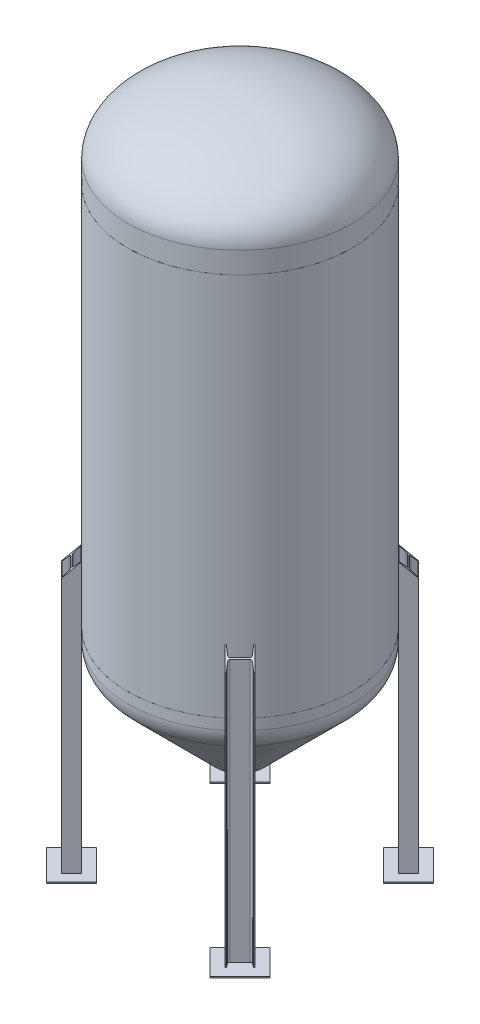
ISO-10303-21;
HEADER;
FILE_DESCRIPTION(('STEP AP214'),'2;1');
FILE_NAME('part.step','',(''),(''),'','','');
FILE_SCHEMA(('AUTOMOTIVE_DESIGN { 1 0 10303 214 1 1 1 1 }'));
ENDSEC;
DATA;
#1=APPLICATION_CONTEXT('core data for automotive mechanical design processes');
#2=APPLICATION_PROTOCOL_DEFINITION('international standard','automotive_design',2000,#1);
#3=PRODUCT_CONTEXT('',#1,'mechanical');
#4=PRODUCT('Part','Part','',(#3));
#5=PRODUCT_RELATED_PRODUCT_CATEGORY('part','',(#4));
#6=PRODUCT_DEFINITION_FORMATION('','',#4);
#7=PRODUCT_DEFINITION_CONTEXT('part definition',#1,'design');
#8=PRODUCT_DEFINITION('design','',#6,#7);
#9=PRODUCT_DEFINITION_SHAPE('','',#8);
#10=(LENGTH_UNIT() NAMED_UNIT(*) SI_UNIT(.MILLI.,.METRE.));
#11=(NAMED_UNIT(*) PLANE_ANGLE_UNIT() SI_UNIT($,.RADIAN.));
#12=(NAMED_UNIT(*) SI_UNIT($,.STERADIAN.) SOLID_ANGLE_UNIT());
#13=UNCERTAINTY_MEASURE_WITH_UNIT(LENGTH_MEASURE(1.E-05),#10,'distance_accuracy_value','');
#14=(GEOMETRIC_REPRESENTATION_CONTEXT(3) GLOBAL_UNCERTAINTY_ASSIGNED_CONTEXT((#13)) GLOBAL_UNIT_ASSIGNED_CONTEXT((#10,
#11,#12)) REPRESENTATION_CONTEXT('',''));
#15=CARTESIAN_POINT('',(0.,0.,0.));
#16=DIRECTION('',(0.,0.,1.));
#17=DIRECTION('',(1.,0.,0.));
#18=AXIS2_PLACEMENT_3D('',#15,#16,#17);
#19=CARTESIAN_POINT('',(413.091781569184,-2910.64986630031,-341.249732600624));
#20=DIRECTION('',(-0.707106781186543,0.,-0.707106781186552));
#21=DIRECTION('',(-0.707106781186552,0.,0.707106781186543));
#22=AXIS2_PLACEMENT_3D('',#19,#20,#21);
#23=PLANE('',#22);
#24=DIRECTION('',(0.5,-0.707106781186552,-0.499999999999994));
#25=VECTOR('',#24,1.);
#26=CARTESIAN_POINT('',(867.425518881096,-2268.12493315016,-795.58346991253));
#27=LINE('',#26,#25);
#28=CARTESIAN_POINT('',(413.091781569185,-1625.6,-341.249732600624));
#29=VERTEX_POINT('',#28);
#30=CARTESIAN_POINT('',(460.92062567,-1693.2402,-389.078576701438));
#31=VERTEX_POINT('',#30);
#32=EDGE_CURVE('E187',#29,#31,#27,.T.);
#33=ORIENTED_EDGE('',*,*,#32,.F.);
#34=DIRECTION('',(0.,1.,0.));
#35=VECTOR('',#34,1.);
#36=CARTESIAN_POINT('',(413.091781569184,-2910.64986630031,-341.249732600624));
#37=LINE('',#36,#35);
#38=CARTESIAN_POINT('',(413.091781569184,-2910.64986630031,-341.249732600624));
#39=VERTEX_POINT('',#38);
#40=EDGE_CURVE('E12',#39,#29,#37,.T.);
#41=ORIENTED_EDGE('',*,*,#40,.F.);
#42=DIRECTION('',(-0.707106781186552,0.,0.707106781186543));
#43=VECTOR('',#42,1.);
#44=CARTESIAN_POINT('',(413.091781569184,-2910.64986630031,-341.249732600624));
#45=LINE('',#44,#43);
#46=CARTESIAN_POINT('',(460.920625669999,-2910.64986630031,-389.078576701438));
#47=VERTEX_POINT('',#46);
#48=EDGE_CURVE('E206',#47,#39,#45,.T.);
#49=ORIENTED_EDGE('',*,*,#48,.F.);
#50=DIRECTION('',(0.,1.,0.));
#51=VECTOR('',#50,1.);
#52=CARTESIAN_POINT('',(460.920625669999,-2910.64986630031,-389.078576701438));
#53=LINE('',#52,#51);
#54=EDGE_CURVE('E200',#47,#31,#53,.T.);
#55=ORIENTED_EDGE('',*,*,#54,.T.);
#56=EDGE_LOOP('',(#33,#41,#49,#55));
#57=FACE_BOUND('',#56,.T.);
#58=ADVANCED_FACE('F53',(#57),#23,.F.);
#59=CARTESIAN_POINT('',(413.326976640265,-2910.64986630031,-344.965850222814));
#60=DIRECTION('',(0.,1.,0.));
#61=DIRECTION('',(1.,0.,0.));
#62=AXIS2_PLACEMENT_3D('',#59,#60,#61);
#63=CYLINDRICAL_SURFACE('',#62,2.79400000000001);
#64=CARTESIAN_POINT('',(413.326976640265,-1628.394,-344.965850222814));
#65=DIRECTION('',(0.500000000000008,0.707106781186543,-0.499999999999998));
#66=DIRECTION('',(-0.500000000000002,0.707106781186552,0.499999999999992));
#67=AXIS2_PLACEMENT_3D('',#64,#65,#66);
#68=ELLIPSE('',#67,3.95131269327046,2.79400000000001);
#69=CARTESIAN_POINT('',(411.053386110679,-1627.93463662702,-346.589802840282));
#70=VERTEX_POINT('',#69);
#71=CARTESIAN_POINT('',(411.35132029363,-1625.6,-342.990193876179));
#72=VERTEX_POINT('',#71);
#73=EDGE_CURVE('E190',#70,#72,#68,.T.);
#74=ORIENTED_EDGE('',*,*,#73,.F.);
#75=DIRECTION('',(0.,1.,0.));
#76=VECTOR('',#75,1.);
#77=CARTESIAN_POINT('',(411.053386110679,-2910.64986630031,-346.589802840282));
#78=LINE('',#77,#76);
#79=CARTESIAN_POINT('',(411.053386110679,-2910.64986630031,-346.589802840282));
#80=VERTEX_POINT('',#79);
#81=EDGE_CURVE('E297',#80,#70,#78,.T.);
#82=ORIENTED_EDGE('',*,*,#81,.F.);
#83=CARTESIAN_POINT('',(413.326976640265,-2910.64986630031,-344.965850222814));
#84=DIRECTION('',(0.,-1.,0.));
#85=DIRECTION('',(-1.,0.,0.));
#86=AXIS2_PLACEMENT_3D('',#83,#84,#85);
#87=CIRCLE('',#86,2.79400000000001);
#88=CARTESIAN_POINT('',(411.351320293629,-2910.64986630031,-342.990193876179));
#89=VERTEX_POINT('',#88);
#90=EDGE_CURVE('E205',#89,#80,#87,.T.);
#91=ORIENTED_EDGE('',*,*,#90,.F.);
#92=DIRECTION('',(0.,1.,0.));
#93=VECTOR('',#92,1.);
#94=CARTESIAN_POINT('',(411.351320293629,-2910.64986630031,-342.990193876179));
#95=LINE('',#94,#93);
#96=EDGE_CURVE('E61',#89,#72,#95,.T.);
#97=ORIENTED_EDGE('',*,*,#96,.T.);
#98=EDGE_LOOP('',(#74,#82,#91,#97));
#99=FACE_BOUND('',#98,.T.);
#100=ADVANCED_FACE('F300',(#99),#63,.T.);
#101=CARTESIAN_POINT('',(424.535012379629,-2910.64986630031,-365.464551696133));
#102=DIRECTION('',(0.813740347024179,0.,0.581228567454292));
#103=DIRECTION('',(0.581228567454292,0.,-0.813740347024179));
#104=AXIS2_PLACEMENT_3D('',#101,#102,#103);
#105=PLANE('',#104);
#106=DIRECTION('',(-0.413796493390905,0.702246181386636,0.579329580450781));
#107=VECTOR('',#106,1.);
#108=CARTESIAN_POINT('',(790.626932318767,-2272.10170337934,-878.006058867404));
#109=LINE('',#108,#107);
#110=CARTESIAN_POINT('',(424.535012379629,-1650.81404889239,-365.464551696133));
#111=VERTEX_POINT('',#110);
#112=EDGE_CURVE('E309',#111,#70,#109,.T.);
#113=ORIENTED_EDGE('',*,*,#112,.F.);
#114=DIRECTION('',(0.,1.,0.));
#115=VECTOR('',#114,1.);
#116=CARTESIAN_POINT('',(424.535012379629,-2910.64986630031,-365.464551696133));
#117=LINE('',#116,#115);
#118=CARTESIAN_POINT('',(424.535012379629,-2910.64986630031,-365.464551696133));
#119=VERTEX_POINT('',#118);
#120=EDGE_CURVE('E294',#119,#111,#117,.T.);
#121=ORIENTED_EDGE('',*,*,#120,.F.);
#122=DIRECTION('',(0.581228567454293,0.,-0.813740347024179));
#123=VECTOR('',#122,1.);
#124=CARTESIAN_POINT('',(424.535012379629,-2910.64986630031,-365.464551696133));
#125=LINE('',#124,#123);
#126=EDGE_CURVE('E215',#80,#119,#125,.T.);
#127=ORIENTED_EDGE('',*,*,#126,.F.);
#128=ORIENTED_EDGE('',*,*,#81,.T.);
#129=EDGE_LOOP('',(#113,#121,#127,#128));
#130=FACE_BOUND('',#129,.T.);
#131=ADVANCED_FACE('F308',(#130),#105,.F.);
#132=CARTESIAN_POINT('',(418.541000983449,-2910.64986630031,-369.745881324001));
#133=DIRECTION('',(0.,1.,0.));
#134=DIRECTION('',(1.,0.,0.));
#135=AXIS2_PLACEMENT_3D('',#132,#133,#134);
#136=CYLINDRICAL_SURFACE('',#135,7.36600000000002);
#137=CARTESIAN_POINT('',(418.541000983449,-1649.603,-369.745881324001));
#138=DIRECTION('',(0.500000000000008,0.707106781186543,-0.499999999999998));
#139=DIRECTION('',(-0.500000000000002,0.707106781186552,0.499999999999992));
#140=AXIS2_PLACEMENT_3D('',#137,#138,#139);
#141=ELLIPSE('',#140,10.4170971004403,7.36600000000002);
#142=CARTESIAN_POINT('',(423.749549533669,-1656.969,-374.954429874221));
#143=VERTEX_POINT('',#142);
#144=EDGE_CURVE('E314',#143,#111,#141,.F.);
#145=ORIENTED_EDGE('',*,*,#144,.F.);
#146=DIRECTION('',(0.,1.,0.));
#147=VECTOR('',#146,1.);
#148=CARTESIAN_POINT('',(423.749549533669,-2910.64986630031,-374.954429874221));
#149=LINE('',#148,#147);
#150=CARTESIAN_POINT('',(423.749549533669,-2910.64986630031,-374.954429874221));
#151=VERTEX_POINT('',#150);
#152=EDGE_CURVE('E291',#151,#143,#149,.T.);
#153=ORIENTED_EDGE('',*,*,#152,.F.);
#154=CARTESIAN_POINT('',(418.541000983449,-2910.64986630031,-369.745881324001));
#155=DIRECTION('',(0.,1.,0.));
#156=DIRECTION('',(-1.,0.,0.));
#157=AXIS2_PLACEMENT_3D('',#154,#155,#156);
#158=CIRCLE('',#157,7.36600000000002);
#159=EDGE_CURVE('E217',#119,#151,#158,.T.);
#160=ORIENTED_EDGE('',*,*,#159,.F.);
#161=ORIENTED_EDGE('',*,*,#120,.T.);
#162=EDGE_LOOP('',(#145,#153,#160,#161));
#163=FACE_BOUND('',#162,.T.);
#164=ADVANCED_FACE('F312',(#163),#136,.F.);
#165=CARTESIAN_POINT('',(374.954429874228,-2910.64986630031,-423.749549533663));
#166=DIRECTION('',(0.707106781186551,0.,-0.707106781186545));
#167=DIRECTION('',(-0.707106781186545,0.,-0.707106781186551));
#168=AXIS2_PLACEMENT_3D('',#165,#166,#167);
#169=PLANE('',#168);
#170=DIRECTION('',(0.707106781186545,0.,0.707106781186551));
#171=VECTOR('',#170,1.);
#172=CARTESIAN_POINT('',(374.954429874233,-1656.969,-423.749549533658));
#173=LINE('',#172,#171);
#174=CARTESIAN_POINT('',(374.954429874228,-1656.969,-423.749549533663));
#175=VERTEX_POINT('',#174);
#176=EDGE_CURVE('E412',#175,#143,#173,.T.);
#177=ORIENTED_EDGE('',*,*,#176,.F.);
#178=DIRECTION('',(0.,1.,0.));
#179=VECTOR('',#178,1.);
#180=CARTESIAN_POINT('',(374.954429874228,-2910.64986630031,-423.749549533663));
#181=LINE('',#180,#179);
#182=CARTESIAN_POINT('',(374.954429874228,-2910.64986630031,-423.749549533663));
#183=VERTEX_POINT('',#182);
#184=EDGE_CURVE('E288',#183,#175,#181,.T.);
#185=ORIENTED_EDGE('',*,*,#184,.F.);
#186=DIRECTION('',(-0.707106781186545,0.,-0.707106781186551));
#187=VECTOR('',#186,1.);
#188=CARTESIAN_POINT('',(374.954429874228,-2910.64986630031,-423.749549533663));
#189=LINE('',#188,#187);
#190=EDGE_CURVE('E219',#151,#183,#189,.T.);
#191=ORIENTED_EDGE('',*,*,#190,.F.);
#192=ORIENTED_EDGE('',*,*,#152,.T.);
#193=EDGE_LOOP('',(#177,#185,#191,#192));
#194=FACE_BOUND('',#193,.T.);
#195=ADVANCED_FACE('F318',(#194),#169,.F.);
#196=CARTESIAN_POINT('',(369.745881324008,-2910.64986630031,-418.541000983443));
#197=DIRECTION('',(0.,1.,0.));
#198=DIRECTION('',(1.,0.,0.));
#199=AXIS2_PLACEMENT_3D('',#196,#197,#198);
#200=CYLINDRICAL_SURFACE('',#199,7.366);
#201=CARTESIAN_POINT('',(369.745881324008,-1649.603,-418.541000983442));
#202=DIRECTION('',(0.500000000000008,0.707106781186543,-0.499999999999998));
#203=DIRECTION('',(-0.500000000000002,0.707106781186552,0.499999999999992));
#204=AXIS2_PLACEMENT_3D('',#201,#202,#203);
#205=ELLIPSE('',#204,10.4170971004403,7.366);
#206=CARTESIAN_POINT('',(365.46455169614,-1650.81404889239,-424.535012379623));
#207=VERTEX_POINT('',#206);
#208=EDGE_CURVE('E326',#207,#175,#205,.F.);
#209=ORIENTED_EDGE('',*,*,#208,.F.);
#210=DIRECTION('',(0.,1.,0.));
#211=VECTOR('',#210,1.);
#212=CARTESIAN_POINT('',(365.46455169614,-2910.64986630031,-424.535012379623));
#213=LINE('',#212,#211);
#214=CARTESIAN_POINT('',(365.46455169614,-2910.64986630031,-424.535012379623));
#215=VERTEX_POINT('',#214);
#216=EDGE_CURVE('E285',#215,#207,#213,.T.);
#217=ORIENTED_EDGE('',*,*,#216,.F.);
#218=CARTESIAN_POINT('',(369.745881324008,-2910.64986630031,-418.541000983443));
#219=DIRECTION('',(0.,1.,0.));
#220=DIRECTION('',(-1.,0.,0.));
#221=AXIS2_PLACEMENT_3D('',#218,#219,#220);
#222=CIRCLE('',#221,7.366);
#223=EDGE_CURVE('E221',#183,#215,#222,.T.);
#224=ORIENTED_EDGE('',*,*,#223,.F.);
#225=ORIENTED_EDGE('',*,*,#184,.T.);
#226=EDGE_LOOP('',(#209,#217,#224,#225));
#227=FACE_BOUND('',#226,.T.);
#228=ADVANCED_FACE('F325',(#227),#200,.F.);
#229=CARTESIAN_POINT('',(346.589802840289,-2910.64986630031,-411.053386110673));
#230=DIRECTION('',(-0.581228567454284,0.,-0.813740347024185));
#231=DIRECTION('',(-0.813740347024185,0.,0.581228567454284));
#232=AXIS2_PLACEMENT_3D('',#229,#230,#231);
#233=PLANE('',#232);
#234=DIRECTION('',(0.579329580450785,-0.702246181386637,-0.413796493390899));
#235=VECTOR('',#234,1.);
#236=CARTESIAN_POINT('',(868.439386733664,-2260.50526639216,-783.793765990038));
#237=LINE('',#236,#235);
#238=CARTESIAN_POINT('',(346.589802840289,-1627.93463662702,-411.053386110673));
#239=VERTEX_POINT('',#238);
#240=EDGE_CURVE('E331',#239,#207,#237,.T.);
#241=ORIENTED_EDGE('',*,*,#240,.F.);
#242=DIRECTION('',(0.,1.,0.));
#243=VECTOR('',#242,1.);
#244=CARTESIAN_POINT('',(346.589802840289,-2910.64986630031,-411.053386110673));
#245=LINE('',#244,#243);
#246=CARTESIAN_POINT('',(346.589802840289,-2910.64986630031,-411.053386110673));
#247=VERTEX_POINT('',#246);
#248=EDGE_CURVE('E282',#247,#239,#245,.T.);
#249=ORIENTED_EDGE('',*,*,#248,.F.);
#250=DIRECTION('',(-0.813740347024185,0.,0.581228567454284));
#251=VECTOR('',#250,1.);
#252=CARTESIAN_POINT('',(346.589802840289,-2910.64986630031,-411.053386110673));
#253=LINE('',#252,#251);
#254=EDGE_CURVE('E223',#215,#247,#253,.T.);
#255=ORIENTED_EDGE('',*,*,#254,.F.);
#256=ORIENTED_EDGE('',*,*,#216,.T.);
#257=EDGE_LOOP('',(#241,#249,#255,#256));
#258=FACE_BOUND('',#257,.T.);
#259=ADVANCED_FACE('F329',(#258),#233,.F.);
#260=CARTESIAN_POINT('',(344.965850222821,-2910.64986630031,-413.326976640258));
#261=DIRECTION('',(0.,1.,0.));
#262=DIRECTION('',(1.,0.,0.));
#263=AXIS2_PLACEMENT_3D('',#260,#261,#262);
#264=CYLINDRICAL_SURFACE('',#263,2.79399999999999);
#265=CARTESIAN_POINT('',(344.965850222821,-1628.394,-413.326976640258));
#266=DIRECTION('',(0.500000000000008,0.707106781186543,-0.499999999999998));
#267=DIRECTION('',(-0.500000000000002,0.707106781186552,0.499999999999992));
#268=AXIS2_PLACEMENT_3D('',#265,#266,#267);
#269=ELLIPSE('',#268,3.95131269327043,2.79399999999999);
#270=CARTESIAN_POINT('',(342.990193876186,-1625.6,-411.351320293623));
#271=VERTEX_POINT('',#270);
#272=EDGE_CURVE('E408',#271,#239,#269,.T.);
#273=ORIENTED_EDGE('',*,*,#272,.F.);
#274=DIRECTION('',(0.,1.,0.));
#275=VECTOR('',#274,1.);
#276=CARTESIAN_POINT('',(342.990193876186,-2910.64986630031,-411.351320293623));
#277=LINE('',#276,#275);
#278=CARTESIAN_POINT('',(342.990193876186,-2910.64986630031,-411.351320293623));
#279=VERTEX_POINT('',#278);
#280=EDGE_CURVE('E279',#279,#271,#277,.T.);
#281=ORIENTED_EDGE('',*,*,#280,.F.);
#282=CARTESIAN_POINT('',(344.965850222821,-2910.64986630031,-413.326976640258));
#283=DIRECTION('',(0.,-1.,0.));
#284=DIRECTION('',(-1.,0.,0.));
#285=AXIS2_PLACEMENT_3D('',#282,#283,#284);
#286=CIRCLE('',#285,2.79399999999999);
#287=EDGE_CURVE('E225',#247,#279,#286,.T.);
#288=ORIENTED_EDGE('',*,*,#287,.F.);
#289=ORIENTED_EDGE('',*,*,#248,.T.);
#290=EDGE_LOOP('',(#273,#281,#288,#289));
#291=FACE_BOUND('',#290,.T.);
#292=ADVANCED_FACE('F335',(#291),#264,.T.);
#293=CARTESIAN_POINT('',(389.078576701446,-2910.64986630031,-460.920625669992));
#294=DIRECTION('',(0.707106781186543,0.,0.707106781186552));
#295=DIRECTION('',(0.707106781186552,0.,-0.707106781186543));
#296=AXIS2_PLACEMENT_3D('',#293,#294,#295);
#297=PLANE('',#296);
#298=DIRECTION('',(-0.5,0.707106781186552,0.499999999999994));
#299=VECTOR('',#298,1.);
#300=CARTESIAN_POINT('',(819.49789196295,-2301.94503315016,-891.339940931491));
#301=LINE('',#300,#299);
#302=CARTESIAN_POINT('',(389.078576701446,-1693.2402,-460.920625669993));
#303=VERTEX_POINT('',#302);
#304=CARTESIAN_POINT('',(341.249732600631,-1625.6,-413.091781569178));
#305=VERTEX_POINT('',#304);
#306=EDGE_CURVE('E347',#303,#305,#301,.T.);
#307=ORIENTED_EDGE('',*,*,#306,.F.);
#308=DIRECTION('',(0.,1.,0.));
#309=VECTOR('',#308,1.);
#310=CARTESIAN_POINT('',(389.078576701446,-2910.64986630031,-460.920625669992));
#311=LINE('',#310,#309);
#312=CARTESIAN_POINT('',(389.078576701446,-2910.64986630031,-460.920625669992));
#313=VERTEX_POINT('',#312);
#314=EDGE_CURVE('E273',#313,#303,#311,.T.);
#315=ORIENTED_EDGE('',*,*,#314,.F.);
#316=DIRECTION('',(0.707106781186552,0.,-0.707106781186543));
#317=VECTOR('',#316,1.);
#318=CARTESIAN_POINT('',(389.078576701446,-2910.64986630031,-460.920625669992));
#319=LINE('',#318,#317);
#320=CARTESIAN_POINT('',(341.249732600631,-2910.64986630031,-413.091781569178));
#321=VERTEX_POINT('',#320);
#322=EDGE_CURVE('E229',#321,#313,#319,.T.);
#323=ORIENTED_EDGE('',*,*,#322,.F.);
#324=DIRECTION('',(0.,1.,0.));
#325=VECTOR('',#324,1.);
#326=CARTESIAN_POINT('',(341.249732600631,-2910.64986630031,-413.091781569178));
#327=LINE('',#326,#325);
#328=EDGE_CURVE('E276',#321,#305,#327,.T.);
#329=ORIENTED_EDGE('',*,*,#328,.T.);
#330=EDGE_LOOP('',(#307,#315,#323,#329));
#331=FACE_BOUND('',#330,.T.);
#332=ADVANCED_FACE('F344',(#331),#297,.F.);
#333=CARTESIAN_POINT('',(390.819037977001,-2910.64986630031,-459.180164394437));
#334=DIRECTION('',(-0.707106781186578,0.,0.707106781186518));
#335=DIRECTION('',(0.707106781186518,0.,0.707106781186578));
#336=AXIS2_PLACEMENT_3D('',#333,#334,#335);
#337=PLANE('',#336);
#338=DIRECTION('',(-0.707106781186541,0.,-0.707106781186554));
#339=VECTOR('',#338,1.);
#340=CARTESIAN_POINT('',(3953.18617331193,-1693.2402,3103.18697094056));
#341=LINE('',#340,#339);
#342=CARTESIAN_POINT('',(390.819037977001,-1693.2402,-459.180164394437));
#343=VERTEX_POINT('',#342);
#344=EDGE_CURVE('E395',#343,#303,#341,.T.);
#345=ORIENTED_EDGE('',*,*,#344,.F.);
#346=DIRECTION('',(0.,1.,0.));
#347=VECTOR('',#346,1.);
#348=CARTESIAN_POINT('',(390.819037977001,-2910.64986630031,-459.180164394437));
#349=LINE('',#348,#347);
#350=CARTESIAN_POINT('',(390.819037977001,-2910.64986630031,-459.180164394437));
#351=VERTEX_POINT('',#350);
#352=EDGE_CURVE('E270',#351,#343,#349,.T.);
#353=ORIENTED_EDGE('',*,*,#352,.F.);
#354=DIRECTION('',(0.707106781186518,0.,0.707106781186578));
#355=VECTOR('',#354,1.);
#356=CARTESIAN_POINT('',(390.819037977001,-2910.64986630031,-459.180164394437));
#357=LINE('',#356,#355);
#358=EDGE_CURVE('E231',#313,#351,#357,.T.);
#359=ORIENTED_EDGE('',*,*,#358,.F.);
#360=ORIENTED_EDGE('',*,*,#314,.T.);
#361=EDGE_LOOP('',(#345,#353,#359,#360));
#362=FACE_BOUND('',#361,.T.);
#363=ADVANCED_FACE('F351',(#362),#337,.F.);
#364=CARTESIAN_POINT('',(388.843381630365,-2910.64986630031,-457.204508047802));
#365=DIRECTION('',(0.,1.,0.));
#366=DIRECTION('',(1.,0.,0.));
#367=AXIS2_PLACEMENT_3D('',#364,#365,#366);
#368=CYLINDRICAL_SURFACE('',#367,2.79399999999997);
#369=CARTESIAN_POINT('',(388.843381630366,-1690.4462,-457.204508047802));
#370=DIRECTION('',(0.500000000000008,0.707106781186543,-0.499999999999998));
#371=DIRECTION('',(-0.500000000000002,0.707106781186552,0.499999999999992));
#372=AXIS2_PLACEMENT_3D('',#369,#370,#371);
#373=ELLIPSE('',#372,3.95131269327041,2.79399999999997);
#374=CARTESIAN_POINT('',(391.116972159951,-1690.90556337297,-455.580555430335));
#375=VERTEX_POINT('',#374);
#376=EDGE_CURVE('E359',#375,#343,#373,.T.);
#377=ORIENTED_EDGE('',*,*,#376,.F.);
#378=DIRECTION('',(0.,1.,0.));
#379=VECTOR('',#378,1.);
#380=CARTESIAN_POINT('',(391.116972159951,-2910.64986630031,-455.580555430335));
#381=LINE('',#380,#379);
#382=CARTESIAN_POINT('',(391.116972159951,-2910.64986630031,-455.580555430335));
#383=VERTEX_POINT('',#382);
#384=EDGE_CURVE('E267',#383,#375,#381,.T.);
#385=ORIENTED_EDGE('',*,*,#384,.F.);
#386=CARTESIAN_POINT('',(388.843381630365,-2910.64986630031,-457.204508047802));
#387=DIRECTION('',(0.,-1.,0.));
#388=DIRECTION('',(1.,0.,0.));
#389=AXIS2_PLACEMENT_3D('',#386,#387,#388);
#390=CIRCLE('',#389,2.79399999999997);
#391=EDGE_CURVE('E233',#351,#383,#390,.T.);
#392=ORIENTED_EDGE('',*,*,#391,.F.);
#393=ORIENTED_EDGE('',*,*,#352,.T.);
#394=EDGE_LOOP('',(#377,#385,#392,#393));
#395=FACE_BOUND('',#394,.T.);
#396=ADVANCED_FACE('F358',(#395),#368,.T.);
#397=CARTESIAN_POINT('',(377.635345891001,-2910.64986630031,-436.705806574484));
#398=DIRECTION('',(-0.813740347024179,0.,-0.581228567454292));
#399=DIRECTION('',(-0.581228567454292,0.,0.813740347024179));
#400=AXIS2_PLACEMENT_3D('',#397,#398,#399);
#401=PLANE('',#400);
#402=DIRECTION('',(0.413796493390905,-0.702246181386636,-0.579329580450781));
#403=VECTOR('',#402,1.);
#404=CARTESIAN_POINT('',(738.72565255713,-2280.82566256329,-942.244880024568));
#405=LINE('',#404,#403);
#406=CARTESIAN_POINT('',(377.635345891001,-1668.02615110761,-436.705806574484));
#407=VERTEX_POINT('',#406);
#408=EDGE_CURVE('E364',#407,#375,#405,.T.);
#409=ORIENTED_EDGE('',*,*,#408,.F.);
#410=DIRECTION('',(0.,1.,0.));
#411=VECTOR('',#410,1.);
#412=CARTESIAN_POINT('',(377.635345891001,-2910.64986630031,-436.705806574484));
#413=LINE('',#412,#411);
#414=CARTESIAN_POINT('',(377.635345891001,-2910.64986630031,-436.705806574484));
#415=VERTEX_POINT('',#414);
#416=EDGE_CURVE('E264',#415,#407,#413,.T.);
#417=ORIENTED_EDGE('',*,*,#416,.F.);
#418=DIRECTION('',(-0.581228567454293,0.,0.813740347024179));
#419=VECTOR('',#418,1.);
#420=CARTESIAN_POINT('',(377.635345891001,-2910.64986630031,-436.705806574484));
#421=LINE('',#420,#419);
#422=EDGE_CURVE('E235',#383,#415,#421,.T.);
#423=ORIENTED_EDGE('',*,*,#422,.F.);
#424=ORIENTED_EDGE('',*,*,#384,.T.);
#425=EDGE_LOOP('',(#409,#417,#423,#424));
#426=FACE_BOUND('',#425,.T.);
#427=ADVANCED_FACE('F362',(#426),#401,.F.);
#428=CARTESIAN_POINT('',(383.629357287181,-2910.64986630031,-432.424476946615));
#429=DIRECTION('',(0.,1.,0.));
#430=DIRECTION('',(1.,0.,0.));
#431=AXIS2_PLACEMENT_3D('',#428,#429,#430);
#432=CYLINDRICAL_SURFACE('',#431,7.36600000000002);
#433=CARTESIAN_POINT('',(383.629357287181,-1669.2372,-432.424476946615));
#434=DIRECTION('',(0.500000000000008,0.707106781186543,-0.499999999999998));
#435=DIRECTION('',(-0.500000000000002,0.707106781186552,0.499999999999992));
#436=AXIS2_PLACEMENT_3D('',#433,#434,#435);
#437=ELLIPSE('',#436,10.4170971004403,7.36600000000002);
#438=CARTESIAN_POINT('',(378.420808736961,-1661.8712,-427.215928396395));
#439=VERTEX_POINT('',#438);
#440=EDGE_CURVE('E403',#439,#407,#437,.F.);
#441=ORIENTED_EDGE('',*,*,#440,.F.);
#442=DIRECTION('',(0.,1.,0.));
#443=VECTOR('',#442,1.);
#444=CARTESIAN_POINT('',(378.420808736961,-2910.64986630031,-427.215928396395));
#445=LINE('',#444,#443);
#446=CARTESIAN_POINT('',(378.420808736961,-2910.64986630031,-427.215928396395));
#447=VERTEX_POINT('',#446);
#448=EDGE_CURVE('E261',#447,#439,#445,.T.);
#449=ORIENTED_EDGE('',*,*,#448,.F.);
#450=CARTESIAN_POINT('',(383.629357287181,-2910.64986630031,-432.424476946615));
#451=DIRECTION('',(0.,1.,0.));
#452=DIRECTION('',(-1.,0.,0.));
#453=AXIS2_PLACEMENT_3D('',#450,#451,#452);
#454=CIRCLE('',#453,7.36600000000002);
#455=EDGE_CURVE('E237',#415,#447,#454,.T.);
#456=ORIENTED_EDGE('',*,*,#455,.F.);
#457=ORIENTED_EDGE('',*,*,#416,.T.);
#458=EDGE_LOOP('',(#441,#449,#456,#457));
#459=FACE_BOUND('',#458,.T.);
#460=ADVANCED_FACE('F368',(#459),#432,.F.);
#461=CARTESIAN_POINT('',(427.215928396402,-2910.64986630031,-378.420808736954));
#462=DIRECTION('',(-0.707106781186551,0.,0.707106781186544));
#463=DIRECTION('',(0.707106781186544,0.,0.707106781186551));
#464=AXIS2_PLACEMENT_3D('',#461,#462,#463);
#465=PLANE('',#464);
#466=DIRECTION('',(-0.707106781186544,0.,-0.707106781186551));
#467=VECTOR('',#466,1.);
#468=CARTESIAN_POINT('',(427.215928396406,-1661.8712,-378.420808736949));
#469=LINE('',#468,#467);
#470=CARTESIAN_POINT('',(427.215928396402,-1661.8712,-378.420808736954));
#471=VERTEX_POINT('',#470);
#472=EDGE_CURVE('E376',#471,#439,#469,.T.);
#473=ORIENTED_EDGE('',*,*,#472,.F.);
#474=DIRECTION('',(0.,1.,0.));
#475=VECTOR('',#474,1.);
#476=CARTESIAN_POINT('',(427.215928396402,-2910.64986630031,-378.420808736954));
#477=LINE('',#476,#475);
#478=CARTESIAN_POINT('',(427.215928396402,-2910.64986630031,-378.420808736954));
#479=VERTEX_POINT('',#478);
#480=EDGE_CURVE('E258',#479,#471,#477,.T.);
#481=ORIENTED_EDGE('',*,*,#480,.F.);
#482=DIRECTION('',(0.707106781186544,0.,0.707106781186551));
#483=VECTOR('',#482,1.);
#484=CARTESIAN_POINT('',(427.215928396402,-2910.64986630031,-378.420808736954));
#485=LINE('',#484,#483);
#486=EDGE_CURVE('E239',#447,#479,#485,.T.);
#487=ORIENTED_EDGE('',*,*,#486,.F.);
#488=ORIENTED_EDGE('',*,*,#448,.T.);
#489=EDGE_LOOP('',(#473,#481,#487,#488));
#490=FACE_BOUND('',#489,.T.);
#491=ADVANCED_FACE('F375',(#490),#465,.F.);
#492=CARTESIAN_POINT('',(432.424476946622,-2910.64986630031,-383.629357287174));
#493=DIRECTION('',(0.,1.,0.));
#494=DIRECTION('',(1.,0.,0.));
#495=AXIS2_PLACEMENT_3D('',#492,#493,#494);
#496=CYLINDRICAL_SURFACE('',#495,7.366);
#497=CARTESIAN_POINT('',(432.424476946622,-1669.2372,-383.629357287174));
#498=DIRECTION('',(0.500000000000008,0.707106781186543,-0.499999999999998));
#499=DIRECTION('',(-0.500000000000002,0.707106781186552,0.499999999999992));
#500=AXIS2_PLACEMENT_3D('',#497,#498,#499);
#501=ELLIPSE('',#500,10.4170971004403,7.366);
#502=CARTESIAN_POINT('',(436.70580657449,-1668.02615110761,-377.635345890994));
#503=VERTEX_POINT('',#502);
#504=EDGE_CURVE('E381',#503,#471,#501,.F.);
#505=ORIENTED_EDGE('',*,*,#504,.F.);
#506=DIRECTION('',(0.,1.,0.));
#507=VECTOR('',#506,1.);
#508=CARTESIAN_POINT('',(436.70580657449,-2910.64986630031,-377.635345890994));
#509=LINE('',#508,#507);
#510=CARTESIAN_POINT('',(436.70580657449,-2910.64986630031,-377.635345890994));
#511=VERTEX_POINT('',#510);
#512=EDGE_CURVE('E255',#511,#503,#509,.T.);
#513=ORIENTED_EDGE('',*,*,#512,.F.);
#514=CARTESIAN_POINT('',(432.424476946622,-2910.64986630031,-383.629357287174));
#515=DIRECTION('',(0.,1.,0.));
#516=DIRECTION('',(-1.,0.,0.));
#517=AXIS2_PLACEMENT_3D('',#514,#515,#516);
#518=CIRCLE('',#517,7.366);
#519=EDGE_CURVE('E241',#479,#511,#518,.T.);
#520=ORIENTED_EDGE('',*,*,#519,.F.);
#521=ORIENTED_EDGE('',*,*,#480,.T.);
#522=EDGE_LOOP('',(#505,#513,#520,#521));
#523=FACE_BOUND('',#522,.T.);
#524=ADVANCED_FACE('F379',(#523),#496,.F.);
#525=CARTESIAN_POINT('',(455.580555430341,-2910.64986630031,-391.116972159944));
#526=DIRECTION('',(0.581228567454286,0.,0.813740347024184));
#527=DIRECTION('',(0.813740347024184,0.,-0.581228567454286));
#528=AXIS2_PLACEMENT_3D('',#525,#526,#527);
#529=PLANE('',#528);
#530=DIRECTION('',(-0.579329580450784,0.702246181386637,0.4137964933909));
#531=VECTOR('',#530,1.);
#532=CARTESIAN_POINT('',(951.811552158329,-2292.42209955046,-745.558818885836));
#533=LINE('',#532,#531);
#534=CARTESIAN_POINT('',(455.580555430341,-1690.90556337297,-391.116972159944));
#535=VERTEX_POINT('',#534);
#536=EDGE_CURVE('E397',#535,#503,#533,.T.);
#537=ORIENTED_EDGE('',*,*,#536,.F.);
#538=DIRECTION('',(0.,1.,0.));
#539=VECTOR('',#538,1.);
#540=CARTESIAN_POINT('',(455.580555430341,-2910.64986630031,-391.116972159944));
#541=LINE('',#540,#539);
#542=CARTESIAN_POINT('',(455.580555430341,-2910.64986630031,-391.116972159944));
#543=VERTEX_POINT('',#542);
#544=EDGE_CURVE('E252',#543,#535,#541,.T.);
#545=ORIENTED_EDGE('',*,*,#544,.F.);
#546=DIRECTION('',(0.813740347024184,0.,-0.581228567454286));
#547=VECTOR('',#546,1.);
#548=CARTESIAN_POINT('',(455.580555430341,-2910.64986630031,-391.116972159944));
#549=LINE('',#548,#547);
#550=EDGE_CURVE('E243',#511,#543,#549,.T.);
#551=ORIENTED_EDGE('',*,*,#550,.F.);
#552=ORIENTED_EDGE('',*,*,#512,.T.);
#553=EDGE_LOOP('',(#537,#545,#551,#552));
#554=FACE_BOUND('',#553,.T.);
#555=ADVANCED_FACE('F385',(#554),#529,.F.);
#556=CARTESIAN_POINT('',(457.204508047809,-2910.64986630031,-388.843381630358));
#557=DIRECTION('',(0.,1.,0.));
#558=DIRECTION('',(1.,0.,0.));
#559=AXIS2_PLACEMENT_3D('',#556,#557,#558);
#560=CYLINDRICAL_SURFACE('',#559,2.79399999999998);
#561=CARTESIAN_POINT('',(457.204508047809,-1690.4462,-388.843381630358));
#562=DIRECTION('',(0.500000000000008,0.707106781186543,-0.499999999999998));
#563=DIRECTION('',(-0.500000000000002,0.707106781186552,0.499999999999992));
#564=AXIS2_PLACEMENT_3D('',#561,#562,#563);
#565=ELLIPSE('',#564,3.95131269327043,2.79399999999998);
#566=CARTESIAN_POINT('',(459.180164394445,-1693.2402,-390.819037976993));
#567=VERTEX_POINT('',#566);
#568=EDGE_CURVE('E391',#567,#535,#565,.T.);
#569=ORIENTED_EDGE('',*,*,#568,.F.);
#570=DIRECTION('',(0.,1.,0.));
#571=VECTOR('',#570,1.);
#572=CARTESIAN_POINT('',(459.180164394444,-2910.64986630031,-390.819037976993));
#573=LINE('',#572,#571);
#574=CARTESIAN_POINT('',(459.180164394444,-2910.64986630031,-390.819037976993));
#575=VERTEX_POINT('',#574);
#576=EDGE_CURVE('E249',#575,#567,#573,.T.);
#577=ORIENTED_EDGE('',*,*,#576,.F.);
#578=CARTESIAN_POINT('',(457.204508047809,-2910.64986630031,-388.843381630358));
#579=DIRECTION('',(0.,-1.,0.));
#580=DIRECTION('',(1.,0.,0.));
#581=AXIS2_PLACEMENT_3D('',#578,#579,#580);
#582=CIRCLE('',#581,2.79399999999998);
#583=EDGE_CURVE('E245',#543,#575,#582,.T.);
#584=ORIENTED_EDGE('',*,*,#583,.F.);
#585=ORIENTED_EDGE('',*,*,#544,.T.);
#586=EDGE_LOOP('',(#569,#577,#584,#585));
#587=FACE_BOUND('',#586,.T.);
#588=ADVANCED_FACE('F390',(#587),#560,.T.);
#589=CARTESIAN_POINT('',(460.920625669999,-2910.64986630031,-389.078576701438));
#590=DIRECTION('',(-0.707106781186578,0.,0.707106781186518));
#591=DIRECTION('',(0.707106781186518,0.,0.707106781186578));
#592=AXIS2_PLACEMENT_3D('',#589,#590,#591);
#593=PLANE('',#592);
#594=EDGE_CURVE('E394',#31,#567,#341,.T.);
#595=ORIENTED_EDGE('',*,*,#594,.F.);
#596=ORIENTED_EDGE('',*,*,#54,.F.);
#597=DIRECTION('',(0.707106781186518,0.,0.707106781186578));
#598=VECTOR('',#597,1.);
#599=CARTESIAN_POINT('',(460.920625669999,-2910.64986630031,-389.078576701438));
#600=LINE('',#599,#598);
#601=EDGE_CURVE('E68',#575,#47,#600,.T.);
#602=ORIENTED_EDGE('',*,*,#601,.F.);
#603=ORIENTED_EDGE('',*,*,#576,.T.);
#604=EDGE_LOOP('',(#595,#596,#602,#603));
#605=FACE_BOUND('',#604,.T.);
#606=ADVANCED_FACE('F393',(#605),#593,.F.);
#607=CARTESIAN_POINT('',(411.351320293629,-2910.64986630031,-342.990193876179));
#608=DIRECTION('',(0.707106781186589,0.,-0.707106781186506));
#609=DIRECTION('',(-0.707106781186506,0.,-0.707106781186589));
#610=AXIS2_PLACEMENT_3D('',#607,#608,#609);
#611=PLANE('',#610);
#612=DIRECTION('',(-0.707106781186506,0.,-0.707106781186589));
#613=VECTOR('',#612,1.);
#614=CARTESIAN_POINT('',(411.35132029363,-1625.6,-342.990193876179));
#615=LINE('',#614,#613);
#616=EDGE_CURVE('E184',#29,#72,#615,.T.);
#617=ORIENTED_EDGE('',*,*,#616,.T.);
#618=ORIENTED_EDGE('',*,*,#96,.F.);
#619=DIRECTION('',(-0.707106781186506,0.,-0.707106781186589));
#620=VECTOR('',#619,1.);
#621=CARTESIAN_POINT('',(411.351320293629,-2910.64986630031,-342.990193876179));
#622=LINE('',#621,#620);
#623=EDGE_CURVE('E203',#39,#89,#622,.T.);
#624=ORIENTED_EDGE('',*,*,#623,.F.);
#625=ORIENTED_EDGE('',*,*,#40,.T.);
#626=EDGE_LOOP('',(#617,#618,#624,#625));
#627=FACE_BOUND('',#626,.T.);
#628=ADVANCED_FACE('F202',(#627),#611,.F.);
#629=CARTESIAN_POINT('',(341.249732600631,-2910.64986630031,-413.091781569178));
#630=DIRECTION('',(0.707106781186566,0.,-0.707106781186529));
#631=DIRECTION('',(-0.707106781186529,0.,-0.707106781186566));
#632=AXIS2_PLACEMENT_3D('',#629,#630,#631);
#633=PLANE('',#632);
#634=DIRECTION('',(-0.707106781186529,0.,-0.707106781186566));
#635=VECTOR('',#634,1.);
#636=CARTESIAN_POINT('',(341.249732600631,-1625.6,-413.091781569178));
#637=LINE('',#636,#635);
#638=EDGE_CURVE('E194',#271,#305,#637,.T.);
#639=ORIENTED_EDGE('',*,*,#638,.T.);
#640=ORIENTED_EDGE('',*,*,#328,.F.);
#641=DIRECTION('',(-0.707106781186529,0.,-0.707106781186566));
#642=VECTOR('',#641,1.);
#643=CARTESIAN_POINT('',(341.249732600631,-2910.64986630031,-413.091781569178));
#644=LINE('',#643,#642);
#645=EDGE_CURVE('E227',#279,#321,#644,.T.);
#646=ORIENTED_EDGE('',*,*,#645,.F.);
#647=ORIENTED_EDGE('',*,*,#280,.T.);
#648=EDGE_LOOP('',(#639,#640,#646,#647));
#649=FACE_BOUND('',#648,.T.);
#650=ADVANCED_FACE('F341',(#649),#633,.F.);
#651=CARTESIAN_POINT('',(457.204508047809,-2910.64986630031,-388.843381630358));
#652=DIRECTION('',(0.,1.,0.));
#653=DIRECTION('',(1.,0.,0.));
#654=AXIS2_PLACEMENT_3D('',#651,#652,#653);
#655=PLANE('',#654);
#656=ORIENTED_EDGE('',*,*,#48,.T.);
#657=ORIENTED_EDGE('',*,*,#623,.T.);
#658=ORIENTED_EDGE('',*,*,#90,.T.);
#659=ORIENTED_EDGE('',*,*,#126,.T.);
#660=ORIENTED_EDGE('',*,*,#159,.T.);
#661=ORIENTED_EDGE('',*,*,#190,.T.);
#662=ORIENTED_EDGE('',*,*,#223,.T.);
#663=ORIENTED_EDGE('',*,*,#254,.T.);
#664=ORIENTED_EDGE('',*,*,#287,.T.);
#665=ORIENTED_EDGE('',*,*,#645,.T.);
#666=ORIENTED_EDGE('',*,*,#322,.T.);
#667=ORIENTED_EDGE('',*,*,#358,.T.);
#668=ORIENTED_EDGE('',*,*,#391,.T.);
#669=ORIENTED_EDGE('',*,*,#422,.T.);
#670=ORIENTED_EDGE('',*,*,#455,.T.);
#671=ORIENTED_EDGE('',*,*,#486,.T.);
#672=ORIENTED_EDGE('',*,*,#519,.T.);
#673=ORIENTED_EDGE('',*,*,#550,.T.);
#674=ORIENTED_EDGE('',*,*,#583,.T.);
#675=ORIENTED_EDGE('',*,*,#601,.T.);
#676=EDGE_LOOP('',(#656,#657,#658,#659,#660,#661,#662,#663,#664,#665,#666,#667,#668,#669,#670,
#671,#672,#673,#674,#675));
#677=FACE_BOUND('',#676,.T.);
#678=ADVANCED_FACE('F208',(#677),#655,.F.);
#679=CARTESIAN_POINT('',(3905.35732921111,-1625.6,3151.01581504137));
#680=DIRECTION('',(0.500000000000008,0.707106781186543,-0.499999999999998));
#681=DIRECTION('',(0.,0.577350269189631,0.816496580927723));
#682=AXIS2_PLACEMENT_3D('',#679,#680,#681);
#683=PLANE('',#682);
#684=ORIENTED_EDGE('',*,*,#616,.F.);
#685=ORIENTED_EDGE('',*,*,#32,.T.);
#686=ORIENTED_EDGE('',*,*,#594,.T.);
#687=ORIENTED_EDGE('',*,*,#568,.T.);
#688=ORIENTED_EDGE('',*,*,#536,.T.);
#689=ORIENTED_EDGE('',*,*,#504,.T.);
#690=ORIENTED_EDGE('',*,*,#472,.T.);
#691=ORIENTED_EDGE('',*,*,#440,.T.);
#692=ORIENTED_EDGE('',*,*,#408,.T.);
#693=ORIENTED_EDGE('',*,*,#376,.T.);
#694=ORIENTED_EDGE('',*,*,#344,.T.);
#695=ORIENTED_EDGE('',*,*,#306,.T.);
#696=ORIENTED_EDGE('',*,*,#638,.F.);
#697=ORIENTED_EDGE('',*,*,#272,.T.);
#698=ORIENTED_EDGE('',*,*,#240,.T.);
#699=ORIENTED_EDGE('',*,*,#208,.T.);
#700=ORIENTED_EDGE('',*,*,#176,.T.);
#701=ORIENTED_EDGE('',*,*,#144,.T.);
#702=ORIENTED_EDGE('',*,*,#112,.T.);
#703=ORIENTED_EDGE('',*,*,#73,.T.);
#704=EDGE_LOOP('',(#684,#685,#686,#687,#688,#689,#690,#691,#692,#693,#694,#695,#696,#697,#698,
#699,#700,#701,#702,#703));
#705=FACE_BOUND('',#704,.T.);
#706=ADVANCED_FACE('F186',(#705),#683,.T.);
#707=CLOSED_SHELL('',(#58,#100,#131,#164,#195,#228,#259,#292,#332,#363,#396,#427,#460,#491,#524,
#555,#588,#606,#628,#650,#678,#706));
#708=MANIFOLD_SOLID_BREP('B2',#707);
#709=CARTESIAN_POINT('',(-341.249732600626,-2910.64986630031,-413.091781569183));
#710=DIRECTION('',(-0.70710678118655,0.,0.707106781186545));
#711=DIRECTION('',(0.707106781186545,0.,0.70710678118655));
#712=AXIS2_PLACEMENT_3D('',#709,#710,#711);
#713=PLANE('',#712);
#714=DIRECTION('',(-0.499999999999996,-0.707106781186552,-0.499999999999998));
#715=VECTOR('',#714,1.);
#716=CARTESIAN_POINT('',(-795.583469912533,-2268.12493315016,-867.425518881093));
#717=LINE('',#716,#715);
#718=CARTESIAN_POINT('',(-341.249732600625,-1625.6,-413.091781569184));
#719=VERTEX_POINT('',#718);
#720=CARTESIAN_POINT('',(-389.078576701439,-1693.2402,-460.920625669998));
#721=VERTEX_POINT('',#720);
#722=EDGE_CURVE('E821',#719,#721,#717,.T.);
#723=ORIENTED_EDGE('',*,*,#722,.F.);
#724=DIRECTION('',(0.,1.,0.));
#725=VECTOR('',#724,1.);
#726=CARTESIAN_POINT('',(-341.249732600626,-2910.64986630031,-413.091781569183));
#727=LINE('',#726,#725);
#728=CARTESIAN_POINT('',(-341.249732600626,-2910.64986630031,-413.091781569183));
#729=VERTEX_POINT('',#728);
#730=EDGE_CURVE('E51',#729,#719,#727,.T.);
#731=ORIENTED_EDGE('',*,*,#730,.F.);
#732=DIRECTION('',(0.707106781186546,0.,0.70710678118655));
#733=VECTOR('',#732,1.);
#734=CARTESIAN_POINT('',(-341.249732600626,-2910.64986630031,-413.091781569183));
#735=LINE('',#734,#733);
#736=CARTESIAN_POINT('',(-389.07857670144,-2910.64986630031,-460.920625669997));
#737=VERTEX_POINT('',#736);
#738=EDGE_CURVE('E840',#737,#729,#735,.T.);
#739=ORIENTED_EDGE('',*,*,#738,.F.);
#740=DIRECTION('',(0.,1.,0.));
#741=VECTOR('',#740,1.);
#742=CARTESIAN_POINT('',(-389.07857670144,-2910.64986630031,-460.920625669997));
#743=LINE('',#742,#741);
#744=EDGE_CURVE('E834',#737,#721,#743,.T.);
#745=ORIENTED_EDGE('',*,*,#744,.T.);
#746=EDGE_LOOP('',(#723,#731,#739,#745));
#747=FACE_BOUND('',#746,.T.);
#748=ADVANCED_FACE('F687',(#747),#713,.F.);
#749=CARTESIAN_POINT('',(-344.965850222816,-2910.64986630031,-413.326976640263));
#750=DIRECTION('',(0.,1.,0.));
#751=DIRECTION('',(0.,0.,-1.));
#752=AXIS2_PLACEMENT_3D('',#749,#750,#751);
#753=CYLINDRICAL_SURFACE('',#752,2.79400000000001);
#754=CARTESIAN_POINT('',(-344.965850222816,-1628.394,-413.326976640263));
#755=DIRECTION('',(-0.5,0.707106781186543,-0.500000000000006));
#756=DIRECTION('',(0.499999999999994,0.707106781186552,0.5));
#757=AXIS2_PLACEMENT_3D('',#754,#755,#756);
#758=ELLIPSE('',#757,3.95131269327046,2.79400000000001);
#759=CARTESIAN_POINT('',(-346.589802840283,-1627.93463662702,-411.053386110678));
#760=VERTEX_POINT('',#759);
#761=CARTESIAN_POINT('',(-342.99019387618,-1625.6,-411.351320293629));
#762=VERTEX_POINT('',#761);
#763=EDGE_CURVE('E824',#760,#762,#758,.T.);
#764=ORIENTED_EDGE('',*,*,#763,.F.);
#765=DIRECTION('',(0.,1.,0.));
#766=VECTOR('',#765,1.);
#767=CARTESIAN_POINT('',(-346.589802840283,-2910.64986630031,-411.053386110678));
#768=LINE('',#767,#766);
#769=CARTESIAN_POINT('',(-346.589802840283,-2910.64986630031,-411.053386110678));
#770=VERTEX_POINT('',#769);
#771=EDGE_CURVE('E931',#770,#760,#768,.T.);
#772=ORIENTED_EDGE('',*,*,#771,.F.);
#773=CARTESIAN_POINT('',(-344.965850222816,-2910.64986630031,-413.326976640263));
#774=DIRECTION('',(0.,-1.,0.));
#775=DIRECTION('',(0.,0.,1.));
#776=AXIS2_PLACEMENT_3D('',#773,#774,#775);
#777=CIRCLE('',#776,2.79400000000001);
#778=CARTESIAN_POINT('',(-342.990193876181,-2910.64986630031,-411.351320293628));
#779=VERTEX_POINT('',#778);
#780=EDGE_CURVE('E839',#779,#770,#777,.T.);
#781=ORIENTED_EDGE('',*,*,#780,.F.);
#782=DIRECTION('',(0.,1.,0.));
#783=VECTOR('',#782,1.);
#784=CARTESIAN_POINT('',(-342.990193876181,-2910.64986630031,-411.351320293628));
#785=LINE('',#784,#783);
#786=EDGE_CURVE('E695',#779,#762,#785,.T.);
#787=ORIENTED_EDGE('',*,*,#786,.T.);
#788=EDGE_LOOP('',(#764,#772,#781,#787));
#789=FACE_BOUND('',#788,.T.);
#790=ADVANCED_FACE('F934',(#789),#753,.T.);
#791=CARTESIAN_POINT('',(-365.464551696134,-2910.64986630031,-424.535012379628));
#792=DIRECTION('',(0.58122856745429,0.,-0.813740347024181));
#793=DIRECTION('',(-0.813740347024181,0.,-0.58122856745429));
#794=AXIS2_PLACEMENT_3D('',#791,#792,#793);
#795=PLANE('',#794);
#796=DIRECTION('',(0.579329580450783,0.702246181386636,0.413796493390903));
#797=VECTOR('',#796,1.);
#798=CARTESIAN_POINT('',(-878.006058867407,-2272.10170337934,-790.626932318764));
#799=LINE('',#798,#797);
#800=CARTESIAN_POINT('',(-365.464551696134,-1650.81404889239,-424.535012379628));
#801=VERTEX_POINT('',#800);
#802=EDGE_CURVE('E943',#801,#760,#799,.T.);
#803=ORIENTED_EDGE('',*,*,#802,.F.);
#804=DIRECTION('',(0.,1.,0.));
#805=VECTOR('',#804,1.);
#806=CARTESIAN_POINT('',(-365.464551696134,-2910.64986630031,-424.535012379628));
#807=LINE('',#806,#805);
#808=CARTESIAN_POINT('',(-365.464551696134,-2910.64986630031,-424.535012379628));
#809=VERTEX_POINT('',#808);
#810=EDGE_CURVE('E928',#809,#801,#807,.T.);
#811=ORIENTED_EDGE('',*,*,#810,.F.);
#812=DIRECTION('',(-0.813740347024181,0.,-0.58122856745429));
#813=VECTOR('',#812,1.);
#814=CARTESIAN_POINT('',(-365.464551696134,-2910.64986630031,-424.535012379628));
#815=LINE('',#814,#813);
#816=EDGE_CURVE('E849',#770,#809,#815,.T.);
#817=ORIENTED_EDGE('',*,*,#816,.F.);
#818=ORIENTED_EDGE('',*,*,#771,.T.);
#819=EDGE_LOOP('',(#803,#811,#817,#818));
#820=FACE_BOUND('',#819,.T.);
#821=ADVANCED_FACE('F942',(#820),#795,.F.);
#822=CARTESIAN_POINT('',(-369.745881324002,-2910.64986630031,-418.541000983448));
#823=DIRECTION('',(0.,1.,0.));
#824=DIRECTION('',(0.,0.,-1.));
#825=AXIS2_PLACEMENT_3D('',#822,#823,#824);
#826=CYLINDRICAL_SURFACE('',#825,7.36600000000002);
#827=CARTESIAN_POINT('',(-369.745881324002,-1649.603,-418.541000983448));
#828=DIRECTION('',(-0.5,0.707106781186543,-0.500000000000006));
#829=DIRECTION('',(0.499999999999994,0.707106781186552,0.5));
#830=AXIS2_PLACEMENT_3D('',#827,#828,#829);
#831=ELLIPSE('',#830,10.4170971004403,7.36600000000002);
#832=CARTESIAN_POINT('',(-374.954429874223,-1656.969,-423.749549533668));
#833=VERTEX_POINT('',#832);
#834=EDGE_CURVE('E948',#833,#801,#831,.F.);
#835=ORIENTED_EDGE('',*,*,#834,.F.);
#836=DIRECTION('',(0.,1.,0.));
#837=VECTOR('',#836,1.);
#838=CARTESIAN_POINT('',(-374.954429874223,-2910.64986630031,-423.749549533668));
#839=LINE('',#838,#837);
#840=CARTESIAN_POINT('',(-374.954429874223,-2910.64986630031,-423.749549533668));
#841=VERTEX_POINT('',#840);
#842=EDGE_CURVE('E925',#841,#833,#839,.T.);
#843=ORIENTED_EDGE('',*,*,#842,.F.);
#844=CARTESIAN_POINT('',(-369.745881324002,-2910.64986630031,-418.541000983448));
#845=DIRECTION('',(0.,1.,0.));
#846=DIRECTION('',(0.,0.,1.));
#847=AXIS2_PLACEMENT_3D('',#844,#845,#846);
#848=CIRCLE('',#847,7.36600000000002);
#849=EDGE_CURVE('E851',#809,#841,#848,.T.);
#850=ORIENTED_EDGE('',*,*,#849,.F.);
#851=ORIENTED_EDGE('',*,*,#810,.T.);
#852=EDGE_LOOP('',(#835,#843,#850,#851));
#853=FACE_BOUND('',#852,.T.);
#854=ADVANCED_FACE('F946',(#853),#826,.F.);
#855=CARTESIAN_POINT('',(-423.749549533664,-2910.64986630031,-374.954429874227));
#856=DIRECTION('',(-0.707106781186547,0.,-0.707106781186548));
#857=DIRECTION('',(-0.707106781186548,0.,0.707106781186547));
#858=AXIS2_PLACEMENT_3D('',#855,#856,#857);
#859=PLANE('',#858);
#860=DIRECTION('',(0.707106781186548,0.,-0.707106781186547));
#861=VECTOR('',#860,1.);
#862=CARTESIAN_POINT('',(-423.749549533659,-1656.969,-374.954429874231));
#863=LINE('',#862,#861);
#864=CARTESIAN_POINT('',(-423.749549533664,-1656.969,-374.954429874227));
#865=VERTEX_POINT('',#864);
#866=EDGE_CURVE('E1046',#865,#833,#863,.T.);
#867=ORIENTED_EDGE('',*,*,#866,.F.);
#868=DIRECTION('',(0.,1.,0.));
#869=VECTOR('',#868,1.);
#870=CARTESIAN_POINT('',(-423.749549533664,-2910.64986630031,-374.954429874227));
#871=LINE('',#870,#869);
#872=CARTESIAN_POINT('',(-423.749549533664,-2910.64986630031,-374.954429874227));
#873=VERTEX_POINT('',#872);
#874=EDGE_CURVE('E922',#873,#865,#871,.T.);
#875=ORIENTED_EDGE('',*,*,#874,.F.);
#876=DIRECTION('',(-0.707106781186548,0.,0.707106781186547));
#877=VECTOR('',#876,1.);
#878=CARTESIAN_POINT('',(-423.749549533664,-2910.64986630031,-374.954429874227));
#879=LINE('',#878,#877);
#880=EDGE_CURVE('E853',#841,#873,#879,.T.);
#881=ORIENTED_EDGE('',*,*,#880,.F.);
#882=ORIENTED_EDGE('',*,*,#842,.T.);
#883=EDGE_LOOP('',(#867,#875,#881,#882));
#884=FACE_BOUND('',#883,.T.);
#885=ADVANCED_FACE('F952',(#884),#859,.F.);
#886=CARTESIAN_POINT('',(-418.541000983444,-2910.64986630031,-369.745881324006));
#887=DIRECTION('',(0.,1.,0.));
#888=DIRECTION('',(0.,0.,-1.));
#889=AXIS2_PLACEMENT_3D('',#886,#887,#888);
#890=CYLINDRICAL_SURFACE('',#889,7.366);
#891=CARTESIAN_POINT('',(-418.541000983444,-1649.603,-369.745881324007));
#892=DIRECTION('',(-0.5,0.707106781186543,-0.500000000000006));
#893=DIRECTION('',(0.499999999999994,0.707106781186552,0.5));
#894=AXIS2_PLACEMENT_3D('',#891,#892,#893);
#895=ELLIPSE('',#894,10.4170971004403,7.366);
#896=CARTESIAN_POINT('',(-424.535012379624,-1650.81404889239,-365.464551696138));
#897=VERTEX_POINT('',#896);
#898=EDGE_CURVE('E960',#897,#865,#895,.F.);
#899=ORIENTED_EDGE('',*,*,#898,.F.);
#900=DIRECTION('',(0.,1.,0.));
#901=VECTOR('',#900,1.);
#902=CARTESIAN_POINT('',(-424.535012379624,-2910.64986630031,-365.464551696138));
#903=LINE('',#902,#901);
#904=CARTESIAN_POINT('',(-424.535012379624,-2910.64986630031,-365.464551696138));
#905=VERTEX_POINT('',#904);
#906=EDGE_CURVE('E919',#905,#897,#903,.T.);
#907=ORIENTED_EDGE('',*,*,#906,.F.);
#908=CARTESIAN_POINT('',(-418.541000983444,-2910.64986630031,-369.745881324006));
#909=DIRECTION('',(0.,1.,0.));
#910=DIRECTION('',(0.,0.,1.));
#911=AXIS2_PLACEMENT_3D('',#908,#909,#910);
#912=CIRCLE('',#911,7.366);
#913=EDGE_CURVE('E855',#873,#905,#912,.T.);
#914=ORIENTED_EDGE('',*,*,#913,.F.);
#915=ORIENTED_EDGE('',*,*,#874,.T.);
#916=EDGE_LOOP('',(#899,#907,#914,#915));
#917=FACE_BOUND('',#916,.T.);
#918=ADVANCED_FACE('F959',(#917),#890,.F.);
#919=CARTESIAN_POINT('',(-411.053386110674,-2910.64986630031,-346.589802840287));
#920=DIRECTION('',(-0.813740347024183,0.,0.581228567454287));
#921=DIRECTION('',(0.581228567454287,0.,0.813740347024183));
#922=AXIS2_PLACEMENT_3D('',#919,#920,#921);
#923=PLANE('',#922);
#924=DIRECTION('',(-0.413796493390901,-0.702246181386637,-0.579329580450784));
#925=VECTOR('',#924,1.);
#926=CARTESIAN_POINT('',(-783.793765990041,-2260.50526639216,-868.439386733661));
#927=LINE('',#926,#925);
#928=CARTESIAN_POINT('',(-411.053386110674,-1627.93463662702,-346.589802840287));
#929=VERTEX_POINT('',#928);
#930=EDGE_CURVE('E965',#929,#897,#927,.T.);
#931=ORIENTED_EDGE('',*,*,#930,.F.);
#932=DIRECTION('',(0.,1.,0.));
#933=VECTOR('',#932,1.);
#934=CARTESIAN_POINT('',(-411.053386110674,-2910.64986630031,-346.589802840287));
#935=LINE('',#934,#933);
#936=CARTESIAN_POINT('',(-411.053386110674,-2910.64986630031,-346.589802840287));
#937=VERTEX_POINT('',#936);
#938=EDGE_CURVE('E916',#937,#929,#935,.T.);
#939=ORIENTED_EDGE('',*,*,#938,.F.);
#940=DIRECTION('',(0.581228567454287,0.,0.813740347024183));
#941=VECTOR('',#940,1.);
#942=CARTESIAN_POINT('',(-411.053386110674,-2910.64986630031,-346.589802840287));
#943=LINE('',#942,#941);
#944=EDGE_CURVE('E857',#905,#937,#943,.T.);
#945=ORIENTED_EDGE('',*,*,#944,.F.);
#946=ORIENTED_EDGE('',*,*,#906,.T.);
#947=EDGE_LOOP('',(#931,#939,#945,#946));
#948=FACE_BOUND('',#947,.T.);
#949=ADVANCED_FACE('F963',(#948),#923,.F.);
#950=CARTESIAN_POINT('',(-413.32697664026,-2910.64986630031,-344.96585022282));
#951=DIRECTION('',(0.,1.,0.));
#952=DIRECTION('',(0.,0.,-1.));
#953=AXIS2_PLACEMENT_3D('',#950,#951,#952);
#954=CYLINDRICAL_SURFACE('',#953,2.79399999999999);
#955=CARTESIAN_POINT('',(-413.326976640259,-1628.394,-344.96585022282));
#956=DIRECTION('',(-0.5,0.707106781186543,-0.500000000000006));
#957=DIRECTION('',(0.499999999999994,0.707106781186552,0.5));
#958=AXIS2_PLACEMENT_3D('',#955,#956,#957);
#959=ELLIPSE('',#958,3.95131269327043,2.79399999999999);
#960=CARTESIAN_POINT('',(-411.351320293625,-1625.6,-342.990193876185));
#961=VERTEX_POINT('',#960);
#962=EDGE_CURVE('E1042',#961,#929,#959,.T.);
#963=ORIENTED_EDGE('',*,*,#962,.F.);
#964=DIRECTION('',(0.,1.,0.));
#965=VECTOR('',#964,1.);
#966=CARTESIAN_POINT('',(-411.351320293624,-2910.64986630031,-342.990193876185));
#967=LINE('',#966,#965);
#968=CARTESIAN_POINT('',(-411.351320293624,-2910.64986630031,-342.990193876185));
#969=VERTEX_POINT('',#968);
#970=EDGE_CURVE('E913',#969,#961,#967,.T.);
#971=ORIENTED_EDGE('',*,*,#970,.F.);
#972=CARTESIAN_POINT('',(-413.32697664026,-2910.64986630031,-344.96585022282));
#973=DIRECTION('',(0.,-1.,0.));
#974=DIRECTION('',(0.,0.,1.));
#975=AXIS2_PLACEMENT_3D('',#972,#973,#974);
#976=CIRCLE('',#975,2.79399999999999);
#977=EDGE_CURVE('E859',#937,#969,#976,.T.);
#978=ORIENTED_EDGE('',*,*,#977,.F.);
#979=ORIENTED_EDGE('',*,*,#938,.T.);
#980=EDGE_LOOP('',(#963,#971,#978,#979));
#981=FACE_BOUND('',#980,.T.);
#982=ADVANCED_FACE('F969',(#981),#954,.T.);
#983=CARTESIAN_POINT('',(-460.920625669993,-2910.64986630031,-389.078576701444));
#984=DIRECTION('',(0.70710678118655,0.,-0.707106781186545));
#985=DIRECTION('',(-0.707106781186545,0.,-0.70710678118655));
#986=AXIS2_PLACEMENT_3D('',#983,#984,#985);
#987=PLANE('',#986);
#988=DIRECTION('',(0.499999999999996,0.707106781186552,0.499999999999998));
#989=VECTOR('',#988,1.);
#990=CARTESIAN_POINT('',(-891.339940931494,-2301.94503315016,-819.497891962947));
#991=LINE('',#990,#989);
#992=CARTESIAN_POINT('',(-460.920625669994,-1693.2402,-389.078576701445));
#993=VERTEX_POINT('',#992);
#994=CARTESIAN_POINT('',(-413.091781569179,-1625.6,-341.24973260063));
#995=VERTEX_POINT('',#994);
#996=EDGE_CURVE('E981',#993,#995,#991,.T.);
#997=ORIENTED_EDGE('',*,*,#996,.F.);
#998=DIRECTION('',(0.,1.,0.));
#999=VECTOR('',#998,1.);
#1000=CARTESIAN_POINT('',(-460.920625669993,-2910.64986630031,-389.078576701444));
#1001=LINE('',#1000,#999);
#1002=CARTESIAN_POINT('',(-460.920625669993,-2910.64986630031,-389.078576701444));
#1003=VERTEX_POINT('',#1002);
#1004=EDGE_CURVE('E907',#1003,#993,#1001,.T.);
#1005=ORIENTED_EDGE('',*,*,#1004,.F.);
#1006=DIRECTION('',(-0.707106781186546,0.,-0.70710678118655));
#1007=VECTOR('',#1006,1.);
#1008=CARTESIAN_POINT('',(-460.920625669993,-2910.64986630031,-389.078576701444));
#1009=LINE('',#1008,#1007);
#1010=CARTESIAN_POINT('',(-413.091781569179,-2910.64986630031,-341.24973260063));
#1011=VERTEX_POINT('',#1010);
#1012=EDGE_CURVE('E863',#1011,#1003,#1009,.T.);
#1013=ORIENTED_EDGE('',*,*,#1012,.F.);
#1014=DIRECTION('',(0.,1.,0.));
#1015=VECTOR('',#1014,1.);
#1016=CARTESIAN_POINT('',(-413.091781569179,-2910.64986630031,-341.24973260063));
#1017=LINE('',#1016,#1015);
#1018=EDGE_CURVE('E910',#1011,#995,#1017,.T.);
#1019=ORIENTED_EDGE('',*,*,#1018,.T.);
#1020=EDGE_LOOP('',(#997,#1005,#1013,#1019));
#1021=FACE_BOUND('',#1020,.T.);
#1022=ADVANCED_FACE('F978',(#1021),#987,.F.);
#1023=CARTESIAN_POINT('',(-459.180164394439,-2910.64986630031,-390.819037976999));
#1024=DIRECTION('',(0.70710678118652,0.,0.707106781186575));
#1025=DIRECTION('',(0.707106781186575,0.,-0.70710678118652));
#1026=AXIS2_PLACEMENT_3D('',#1023,#1024,#1025);
#1027=PLANE('',#1026);
#1028=DIRECTION('',(-0.707106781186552,0.,0.707106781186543));
#1029=VECTOR('',#1028,1.);
#1030=CARTESIAN_POINT('',(3103.18697094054,-1693.2402,-3953.18617331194));
#1031=LINE('',#1030,#1029);
#1032=CARTESIAN_POINT('',(-459.180164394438,-1693.2402,-390.819037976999));
#1033=VERTEX_POINT('',#1032);
#1034=EDGE_CURVE('E1029',#1033,#993,#1031,.T.);
#1035=ORIENTED_EDGE('',*,*,#1034,.F.);
#1036=DIRECTION('',(0.,1.,0.));
#1037=VECTOR('',#1036,1.);
#1038=CARTESIAN_POINT('',(-459.180164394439,-2910.64986630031,-390.819037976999));
#1039=LINE('',#1038,#1037);
#1040=CARTESIAN_POINT('',(-459.180164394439,-2910.64986630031,-390.819037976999));
#1041=VERTEX_POINT('',#1040);
#1042=EDGE_CURVE('E904',#1041,#1033,#1039,.T.);
#1043=ORIENTED_EDGE('',*,*,#1042,.F.);
#1044=DIRECTION('',(0.707106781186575,0.,-0.70710678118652));
#1045=VECTOR('',#1044,1.);
#1046=CARTESIAN_POINT('',(-459.180164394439,-2910.64986630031,-390.819037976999));
#1047=LINE('',#1046,#1045);
#1048=EDGE_CURVE('E865',#1003,#1041,#1047,.T.);
#1049=ORIENTED_EDGE('',*,*,#1048,.F.);
#1050=ORIENTED_EDGE('',*,*,#1004,.T.);
#1051=EDGE_LOOP('',(#1035,#1043,#1049,#1050));
#1052=FACE_BOUND('',#1051,.T.);
#1053=ADVANCED_FACE('F985',(#1052),#1027,.F.);
#1054=CARTESIAN_POINT('',(-457.204508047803,-2910.64986630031,-388.843381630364));
#1055=DIRECTION('',(0.,1.,0.));
#1056=DIRECTION('',(0.,0.,-1.));
#1057=AXIS2_PLACEMENT_3D('',#1054,#1055,#1056);
#1058=CYLINDRICAL_SURFACE('',#1057,2.79399999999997);
#1059=CARTESIAN_POINT('',(-457.204508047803,-1690.4462,-388.843381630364));
#1060=DIRECTION('',(-0.5,0.707106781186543,-0.500000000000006));
#1061=DIRECTION('',(0.499999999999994,0.707106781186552,0.5));
#1062=AXIS2_PLACEMENT_3D('',#1059,#1060,#1061);
#1063=ELLIPSE('',#1062,3.95131269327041,2.79399999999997);
#1064=CARTESIAN_POINT('',(-455.580555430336,-1690.90556337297,-391.11697215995));
#1065=VERTEX_POINT('',#1064);
#1066=EDGE_CURVE('E993',#1065,#1033,#1063,.T.);
#1067=ORIENTED_EDGE('',*,*,#1066,.F.);
#1068=DIRECTION('',(0.,1.,0.));
#1069=VECTOR('',#1068,1.);
#1070=CARTESIAN_POINT('',(-455.580555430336,-2910.64986630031,-391.116972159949));
#1071=LINE('',#1070,#1069);
#1072=CARTESIAN_POINT('',(-455.580555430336,-2910.64986630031,-391.116972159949));
#1073=VERTEX_POINT('',#1072);
#1074=EDGE_CURVE('E901',#1073,#1065,#1071,.T.);
#1075=ORIENTED_EDGE('',*,*,#1074,.F.);
#1076=CARTESIAN_POINT('',(-457.204508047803,-2910.64986630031,-388.843381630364));
#1077=DIRECTION('',(0.,-1.,0.));
#1078=DIRECTION('',(0.,0.,-1.));
#1079=AXIS2_PLACEMENT_3D('',#1076,#1077,#1078);
#1080=CIRCLE('',#1079,2.79399999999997);
#1081=EDGE_CURVE('E867',#1041,#1073,#1080,.T.);
#1082=ORIENTED_EDGE('',*,*,#1081,.F.);
#1083=ORIENTED_EDGE('',*,*,#1042,.T.);
#1084=EDGE_LOOP('',(#1067,#1075,#1082,#1083));
#1085=FACE_BOUND('',#1084,.T.);
#1086=ADVANCED_FACE('F992',(#1085),#1058,.T.);
#1087=CARTESIAN_POINT('',(-436.705806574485,-2910.64986630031,-377.635345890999));
#1088=DIRECTION('',(-0.58122856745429,0.,0.813740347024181));
#1089=DIRECTION('',(0.813740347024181,0.,0.58122856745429));
#1090=AXIS2_PLACEMENT_3D('',#1087,#1088,#1089);
#1091=PLANE('',#1090);
#1092=DIRECTION('',(-0.579329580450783,-0.702246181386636,-0.413796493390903));
#1093=VECTOR('',#1092,1.);
#1094=CARTESIAN_POINT('',(-942.244880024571,-2280.82566256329,-738.725652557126));
#1095=LINE('',#1094,#1093);
#1096=CARTESIAN_POINT('',(-436.705806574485,-1668.02615110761,-377.635345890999));
#1097=VERTEX_POINT('',#1096);
#1098=EDGE_CURVE('E998',#1097,#1065,#1095,.T.);
#1099=ORIENTED_EDGE('',*,*,#1098,.F.);
#1100=DIRECTION('',(0.,1.,0.));
#1101=VECTOR('',#1100,1.);
#1102=CARTESIAN_POINT('',(-436.705806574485,-2910.64986630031,-377.635345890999));
#1103=LINE('',#1102,#1101);
#1104=CARTESIAN_POINT('',(-436.705806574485,-2910.64986630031,-377.635345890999));
#1105=VERTEX_POINT('',#1104);
#1106=EDGE_CURVE('E898',#1105,#1097,#1103,.T.);
#1107=ORIENTED_EDGE('',*,*,#1106,.F.);
#1108=DIRECTION('',(0.813740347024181,0.,0.58122856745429));
#1109=VECTOR('',#1108,1.);
#1110=CARTESIAN_POINT('',(-436.705806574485,-2910.64986630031,-377.635345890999));
#1111=LINE('',#1110,#1109);
#1112=EDGE_CURVE('E869',#1073,#1105,#1111,.T.);
#1113=ORIENTED_EDGE('',*,*,#1112,.F.);
#1114=ORIENTED_EDGE('',*,*,#1074,.T.);
#1115=EDGE_LOOP('',(#1099,#1107,#1113,#1114));
#1116=FACE_BOUND('',#1115,.T.);
#1117=ADVANCED_FACE('F996',(#1116),#1091,.F.);
#1118=CARTESIAN_POINT('',(-432.424476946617,-2910.64986630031,-383.629357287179));
#1119=DIRECTION('',(0.,1.,0.));
#1120=DIRECTION('',(0.,0.,-1.));
#1121=AXIS2_PLACEMENT_3D('',#1118,#1119,#1120);
#1122=CYLINDRICAL_SURFACE('',#1121,7.36600000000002);
#1123=CARTESIAN_POINT('',(-432.424476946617,-1669.2372,-383.62935728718));
#1124=DIRECTION('',(-0.5,0.707106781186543,-0.500000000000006));
#1125=DIRECTION('',(0.499999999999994,0.707106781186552,0.5));
#1126=AXIS2_PLACEMENT_3D('',#1123,#1124,#1125);
#1127=ELLIPSE('',#1126,10.4170971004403,7.36600000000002);
#1128=CARTESIAN_POINT('',(-427.215928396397,-1661.8712,-378.420808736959));
#1129=VERTEX_POINT('',#1128);
#1130=EDGE_CURVE('E1037',#1129,#1097,#1127,.F.);
#1131=ORIENTED_EDGE('',*,*,#1130,.F.);
#1132=DIRECTION('',(0.,1.,0.));
#1133=VECTOR('',#1132,1.);
#1134=CARTESIAN_POINT('',(-427.215928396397,-2910.64986630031,-378.420808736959));
#1135=LINE('',#1134,#1133);
#1136=CARTESIAN_POINT('',(-427.215928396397,-2910.64986630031,-378.420808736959));
#1137=VERTEX_POINT('',#1136);
#1138=EDGE_CURVE('E895',#1137,#1129,#1135,.T.);
#1139=ORIENTED_EDGE('',*,*,#1138,.F.);
#1140=CARTESIAN_POINT('',(-432.424476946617,-2910.64986630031,-383.629357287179));
#1141=DIRECTION('',(0.,1.,0.));
#1142=DIRECTION('',(0.,0.,1.));
#1143=AXIS2_PLACEMENT_3D('',#1140,#1141,#1142);
#1144=CIRCLE('',#1143,7.36600000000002);
#1145=EDGE_CURVE('E871',#1105,#1137,#1144,.T.);
#1146=ORIENTED_EDGE('',*,*,#1145,.F.);
#1147=ORIENTED_EDGE('',*,*,#1106,.T.);
#1148=EDGE_LOOP('',(#1131,#1139,#1146,#1147));
#1149=FACE_BOUND('',#1148,.T.);
#1150=ADVANCED_FACE('F1002',(#1149),#1122,.F.);
#1151=CARTESIAN_POINT('',(-378.420808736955,-2910.64986630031,-427.215928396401));
#1152=DIRECTION('',(0.707106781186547,0.,0.707106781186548));
#1153=DIRECTION('',(0.707106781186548,0.,-0.707106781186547));
#1154=AXIS2_PLACEMENT_3D('',#1151,#1152,#1153);
#1155=PLANE('',#1154);
#1156=DIRECTION('',(-0.707106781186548,0.,0.707106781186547));
#1157=VECTOR('',#1156,1.);
#1158=CARTESIAN_POINT('',(-378.420808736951,-1661.8712,-427.215928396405));
#1159=LINE('',#1158,#1157);
#1160=CARTESIAN_POINT('',(-378.420808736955,-1661.8712,-427.215928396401));
#1161=VERTEX_POINT('',#1160);
#1162=EDGE_CURVE('E1010',#1161,#1129,#1159,.T.);
#1163=ORIENTED_EDGE('',*,*,#1162,.F.);
#1164=DIRECTION('',(0.,1.,0.));
#1165=VECTOR('',#1164,1.);
#1166=CARTESIAN_POINT('',(-378.420808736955,-2910.64986630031,-427.215928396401));
#1167=LINE('',#1166,#1165);
#1168=CARTESIAN_POINT('',(-378.420808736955,-2910.64986630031,-427.215928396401));
#1169=VERTEX_POINT('',#1168);
#1170=EDGE_CURVE('E892',#1169,#1161,#1167,.T.);
#1171=ORIENTED_EDGE('',*,*,#1170,.F.);
#1172=DIRECTION('',(0.707106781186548,0.,-0.707106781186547));
#1173=VECTOR('',#1172,1.);
#1174=CARTESIAN_POINT('',(-378.420808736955,-2910.64986630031,-427.215928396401));
#1175=LINE('',#1174,#1173);
#1176=EDGE_CURVE('E873',#1137,#1169,#1175,.T.);
#1177=ORIENTED_EDGE('',*,*,#1176,.F.);
#1178=ORIENTED_EDGE('',*,*,#1138,.T.);
#1179=EDGE_LOOP('',(#1163,#1171,#1177,#1178));
#1180=FACE_BOUND('',#1179,.T.);
#1181=ADVANCED_FACE('F1009',(#1180),#1155,.F.);
#1182=CARTESIAN_POINT('',(-383.629357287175,-2910.64986630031,-432.424476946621));
#1183=DIRECTION('',(0.,1.,0.));
#1184=DIRECTION('',(0.,0.,-1.));
#1185=AXIS2_PLACEMENT_3D('',#1182,#1183,#1184);
#1186=CYLINDRICAL_SURFACE('',#1185,7.366);
#1187=CARTESIAN_POINT('',(-383.629357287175,-1669.2372,-432.424476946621));
#1188=DIRECTION('',(-0.5,0.707106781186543,-0.500000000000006));
#1189=DIRECTION('',(0.499999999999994,0.707106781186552,0.5));
#1190=AXIS2_PLACEMENT_3D('',#1187,#1188,#1189);
#1191=ELLIPSE('',#1190,10.4170971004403,7.366);
#1192=CARTESIAN_POINT('',(-377.635345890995,-1668.02615110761,-436.705806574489));
#1193=VERTEX_POINT('',#1192);
#1194=EDGE_CURVE('E1015',#1193,#1161,#1191,.F.);
#1195=ORIENTED_EDGE('',*,*,#1194,.F.);
#1196=DIRECTION('',(0.,1.,0.));
#1197=VECTOR('',#1196,1.);
#1198=CARTESIAN_POINT('',(-377.635345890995,-2910.64986630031,-436.705806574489));
#1199=LINE('',#1198,#1197);
#1200=CARTESIAN_POINT('',(-377.635345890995,-2910.64986630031,-436.705806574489));
#1201=VERTEX_POINT('',#1200);
#1202=EDGE_CURVE('E889',#1201,#1193,#1199,.T.);
#1203=ORIENTED_EDGE('',*,*,#1202,.F.);
#1204=CARTESIAN_POINT('',(-383.629357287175,-2910.64986630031,-432.424476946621));
#1205=DIRECTION('',(0.,1.,0.));
#1206=DIRECTION('',(0.,0.,1.));
#1207=AXIS2_PLACEMENT_3D('',#1204,#1205,#1206);
#1208=CIRCLE('',#1207,7.366);
#1209=EDGE_CURVE('E875',#1169,#1201,#1208,.T.);
#1210=ORIENTED_EDGE('',*,*,#1209,.F.);
#1211=ORIENTED_EDGE('',*,*,#1170,.T.);
#1212=EDGE_LOOP('',(#1195,#1203,#1210,#1211));
#1213=FACE_BOUND('',#1212,.T.);
#1214=ADVANCED_FACE('F1013',(#1213),#1186,.F.);
#1215=CARTESIAN_POINT('',(-391.116972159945,-2910.64986630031,-455.58055543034));
#1216=DIRECTION('',(0.813740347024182,0.,-0.581228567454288));
#1217=DIRECTION('',(-0.581228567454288,0.,-0.813740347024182));
#1218=AXIS2_PLACEMENT_3D('',#1215,#1216,#1217);
#1219=PLANE('',#1218);
#1220=DIRECTION('',(0.413796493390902,0.702246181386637,0.579329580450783));
#1221=VECTOR('',#1220,1.);
#1222=CARTESIAN_POINT('',(-745.55881888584,-2292.42209955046,-951.811552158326));
#1223=LINE('',#1222,#1221);
#1224=CARTESIAN_POINT('',(-391.116972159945,-1690.90556337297,-455.58055543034));
#1225=VERTEX_POINT('',#1224);
#1226=EDGE_CURVE('E1031',#1225,#1193,#1223,.T.);
#1227=ORIENTED_EDGE('',*,*,#1226,.F.);
#1228=DIRECTION('',(0.,1.,0.));
#1229=VECTOR('',#1228,1.);
#1230=CARTESIAN_POINT('',(-391.116972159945,-2910.64986630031,-455.58055543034));
#1231=LINE('',#1230,#1229);
#1232=CARTESIAN_POINT('',(-391.116972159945,-2910.64986630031,-455.58055543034));
#1233=VERTEX_POINT('',#1232);
#1234=EDGE_CURVE('E886',#1233,#1225,#1231,.T.);
#1235=ORIENTED_EDGE('',*,*,#1234,.F.);
#1236=DIRECTION('',(-0.581228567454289,0.,-0.813740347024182));
#1237=VECTOR('',#1236,1.);
#1238=CARTESIAN_POINT('',(-391.116972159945,-2910.64986630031,-455.58055543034));
#1239=LINE('',#1238,#1237);
#1240=EDGE_CURVE('E877',#1201,#1233,#1239,.T.);
#1241=ORIENTED_EDGE('',*,*,#1240,.F.);
#1242=ORIENTED_EDGE('',*,*,#1202,.T.);
#1243=EDGE_LOOP('',(#1227,#1235,#1241,#1242));
#1244=FACE_BOUND('',#1243,.T.);
#1245=ADVANCED_FACE('F1019',(#1244),#1219,.F.);
#1246=CARTESIAN_POINT('',(-388.84338163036,-2910.64986630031,-457.204508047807));
#1247=DIRECTION('',(0.,1.,0.));
#1248=DIRECTION('',(0.,0.,-1.));
#1249=AXIS2_PLACEMENT_3D('',#1246,#1247,#1248);
#1250=CYLINDRICAL_SURFACE('',#1249,2.79399999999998);
#1251=CARTESIAN_POINT('',(-388.84338163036,-1690.4462,-457.204508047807));
#1252=DIRECTION('',(-0.5,0.707106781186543,-0.500000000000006));
#1253=DIRECTION('',(0.499999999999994,0.707106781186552,0.5));
#1254=AXIS2_PLACEMENT_3D('',#1251,#1252,#1253);
#1255=ELLIPSE('',#1254,3.95131269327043,2.79399999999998);
#1256=CARTESIAN_POINT('',(-390.819037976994,-1693.2402,-459.180164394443));
#1257=VERTEX_POINT('',#1256);
#1258=EDGE_CURVE('E1025',#1257,#1225,#1255,.T.);
#1259=ORIENTED_EDGE('',*,*,#1258,.F.);
#1260=DIRECTION('',(0.,1.,0.));
#1261=VECTOR('',#1260,1.);
#1262=CARTESIAN_POINT('',(-390.819037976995,-2910.64986630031,-459.180164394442));
#1263=LINE('',#1262,#1261);
#1264=CARTESIAN_POINT('',(-390.819037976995,-2910.64986630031,-459.180164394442));
#1265=VERTEX_POINT('',#1264);
#1266=EDGE_CURVE('E883',#1265,#1257,#1263,.T.);
#1267=ORIENTED_EDGE('',*,*,#1266,.F.);
#1268=CARTESIAN_POINT('',(-388.84338163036,-2910.64986630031,-457.204508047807));
#1269=DIRECTION('',(0.,-1.,0.));
#1270=DIRECTION('',(0.,0.,-1.));
#1271=AXIS2_PLACEMENT_3D('',#1268,#1269,#1270);
#1272=CIRCLE('',#1271,2.79399999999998);
#1273=EDGE_CURVE('E879',#1233,#1265,#1272,.T.);
#1274=ORIENTED_EDGE('',*,*,#1273,.F.);
#1275=ORIENTED_EDGE('',*,*,#1234,.T.);
#1276=EDGE_LOOP('',(#1259,#1267,#1274,#1275));
#1277=FACE_BOUND('',#1276,.T.);
#1278=ADVANCED_FACE('F1024',(#1277),#1250,.T.);
#1279=CARTESIAN_POINT('',(-389.07857670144,-2910.64986630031,-460.920625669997));
#1280=DIRECTION('',(0.70710678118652,0.,0.707106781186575));
#1281=DIRECTION('',(0.707106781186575,0.,-0.70710678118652));
#1282=AXIS2_PLACEMENT_3D('',#1279,#1280,#1281);
#1283=PLANE('',#1282);
#1284=EDGE_CURVE('E1028',#721,#1257,#1031,.T.);
#1285=ORIENTED_EDGE('',*,*,#1284,.F.);
#1286=ORIENTED_EDGE('',*,*,#744,.F.);
#1287=DIRECTION('',(0.707106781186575,0.,-0.70710678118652));
#1288=VECTOR('',#1287,1.);
#1289=CARTESIAN_POINT('',(-389.07857670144,-2910.64986630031,-460.920625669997));
#1290=LINE('',#1289,#1288);
#1291=EDGE_CURVE('E702',#1265,#737,#1290,.T.);
#1292=ORIENTED_EDGE('',*,*,#1291,.F.);
#1293=ORIENTED_EDGE('',*,*,#1266,.T.);
#1294=EDGE_LOOP('',(#1285,#1286,#1292,#1293));
#1295=FACE_BOUND('',#1294,.T.);
#1296=ADVANCED_FACE('F1027',(#1295),#1283,.F.);
#1297=CARTESIAN_POINT('',(-342.990193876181,-2910.64986630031,-411.351320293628));
#1298=DIRECTION('',(-0.707106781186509,0.,-0.707106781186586));
#1299=DIRECTION('',(-0.707106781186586,0.,0.707106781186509));
#1300=AXIS2_PLACEMENT_3D('',#1297,#1298,#1299);
#1301=PLANE('',#1300);
#1302=DIRECTION('',(-0.707106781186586,0.,0.707106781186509));
#1303=VECTOR('',#1302,1.);
#1304=CARTESIAN_POINT('',(-342.990193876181,-1625.6,-411.351320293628));
#1305=LINE('',#1304,#1303);
#1306=EDGE_CURVE('E818',#719,#762,#1305,.T.);
#1307=ORIENTED_EDGE('',*,*,#1306,.T.);
#1308=ORIENTED_EDGE('',*,*,#786,.F.);
#1309=DIRECTION('',(-0.707106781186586,0.,0.707106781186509));
#1310=VECTOR('',#1309,1.);
#1311=CARTESIAN_POINT('',(-342.990193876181,-2910.64986630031,-411.351320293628));
#1312=LINE('',#1311,#1310);
#1313=EDGE_CURVE('E837',#729,#779,#1312,.T.);
#1314=ORIENTED_EDGE('',*,*,#1313,.F.);
#1315=ORIENTED_EDGE('',*,*,#730,.T.);
#1316=EDGE_LOOP('',(#1307,#1308,#1314,#1315));
#1317=FACE_BOUND('',#1316,.T.);
#1318=ADVANCED_FACE('F836',(#1317),#1301,.F.);
#1319=CARTESIAN_POINT('',(-413.091781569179,-2910.64986630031,-341.24973260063));
#1320=DIRECTION('',(-0.707106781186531,0.,-0.707106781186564));
#1321=DIRECTION('',(-0.707106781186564,0.,0.707106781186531));
#1322=AXIS2_PLACEMENT_3D('',#1319,#1320,#1321);
#1323=PLANE('',#1322);
#1324=DIRECTION('',(-0.707106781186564,0.,0.707106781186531));
#1325=VECTOR('',#1324,1.);
#1326=CARTESIAN_POINT('',(-413.091781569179,-1625.6,-341.24973260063));
#1327=LINE('',#1326,#1325);
#1328=EDGE_CURVE('E828',#961,#995,#1327,.T.);
#1329=ORIENTED_EDGE('',*,*,#1328,.T.);
#1330=ORIENTED_EDGE('',*,*,#1018,.F.);
#1331=DIRECTION('',(-0.707106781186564,0.,0.707106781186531));
#1332=VECTOR('',#1331,1.);
#1333=CARTESIAN_POINT('',(-413.091781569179,-2910.64986630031,-341.24973260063));
#1334=LINE('',#1333,#1332);
#1335=EDGE_CURVE('E861',#969,#1011,#1334,.T.);
#1336=ORIENTED_EDGE('',*,*,#1335,.F.);
#1337=ORIENTED_EDGE('',*,*,#970,.T.);
#1338=EDGE_LOOP('',(#1329,#1330,#1336,#1337));
#1339=FACE_BOUND('',#1338,.T.);
#1340=ADVANCED_FACE('F975',(#1339),#1323,.F.);
#1341=CARTESIAN_POINT('',(-388.84338163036,-2910.64986630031,-457.204508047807));
#1342=DIRECTION('',(0.,1.,0.));
#1343=DIRECTION('',(0.,0.,-1.));
#1344=AXIS2_PLACEMENT_3D('',#1341,#1342,#1343);
#1345=PLANE('',#1344);
#1346=ORIENTED_EDGE('',*,*,#738,.T.);
#1347=ORIENTED_EDGE('',*,*,#1313,.T.);
#1348=ORIENTED_EDGE('',*,*,#780,.T.);
#1349=ORIENTED_EDGE('',*,*,#816,.T.);
#1350=ORIENTED_EDGE('',*,*,#849,.T.);
#1351=ORIENTED_EDGE('',*,*,#880,.T.);
#1352=ORIENTED_EDGE('',*,*,#913,.T.);
#1353=ORIENTED_EDGE('',*,*,#944,.T.);
#1354=ORIENTED_EDGE('',*,*,#977,.T.);
#1355=ORIENTED_EDGE('',*,*,#1335,.T.);
#1356=ORIENTED_EDGE('',*,*,#1012,.T.);
#1357=ORIENTED_EDGE('',*,*,#1048,.T.);
#1358=ORIENTED_EDGE('',*,*,#1081,.T.);
#1359=ORIENTED_EDGE('',*,*,#1112,.T.);
#1360=ORIENTED_EDGE('',*,*,#1145,.T.);
#1361=ORIENTED_EDGE('',*,*,#1176,.T.);
#1362=ORIENTED_EDGE('',*,*,#1209,.T.);
#1363=ORIENTED_EDGE('',*,*,#1240,.T.);
#1364=ORIENTED_EDGE('',*,*,#1273,.T.);
#1365=ORIENTED_EDGE('',*,*,#1291,.T.);
#1366=EDGE_LOOP('',(#1346,#1347,#1348,#1349,#1350,#1351,#1352,#1353,#1354,#1355,#1356,#1357,
#1358,#1359,#1360,#1361,#1362,#1363,#1364,#1365));
#1367=FACE_BOUND('',#1366,.T.);
#1368=ADVANCED_FACE('F842',(#1367),#1345,.F.);
#1369=CARTESIAN_POINT('',(3151.01581504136,-1625.6,-3905.35732921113));
#1370=DIRECTION('',(-0.5,0.707106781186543,-0.500000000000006));
#1371=DIRECTION('',(0.816496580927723,0.577350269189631,0.));
#1372=AXIS2_PLACEMENT_3D('',#1369,#1370,#1371);
#1373=PLANE('',#1372);
#1374=ORIENTED_EDGE('',*,*,#1306,.F.);
#1375=ORIENTED_EDGE('',*,*,#722,.T.);
#1376=ORIENTED_EDGE('',*,*,#1284,.T.);
#1377=ORIENTED_EDGE('',*,*,#1258,.T.);
#1378=ORIENTED_EDGE('',*,*,#1226,.T.);
#1379=ORIENTED_EDGE('',*,*,#1194,.T.);
#1380=ORIENTED_EDGE('',*,*,#1162,.T.);
#1381=ORIENTED_EDGE('',*,*,#1130,.T.);
#1382=ORIENTED_EDGE('',*,*,#1098,.T.);
#1383=ORIENTED_EDGE('',*,*,#1066,.T.);
#1384=ORIENTED_EDGE('',*,*,#1034,.T.);
#1385=ORIENTED_EDGE('',*,*,#996,.T.);
#1386=ORIENTED_EDGE('',*,*,#1328,.F.);
#1387=ORIENTED_EDGE('',*,*,#962,.T.);
#1388=ORIENTED_EDGE('',*,*,#930,.T.);
#1389=ORIENTED_EDGE('',*,*,#898,.T.);
#1390=ORIENTED_EDGE('',*,*,#866,.T.);
#1391=ORIENTED_EDGE('',*,*,#834,.T.);
#1392=ORIENTED_EDGE('',*,*,#802,.T.);
#1393=ORIENTED_EDGE('',*,*,#763,.T.);
#1394=EDGE_LOOP('',(#1374,#1375,#1376,#1377,#1378,#1379,#1380,#1381,#1382,#1383,#1384,#1385,
#1386,#1387,#1388,#1389,#1390,#1391,#1392,#1393));
#1395=FACE_BOUND('',#1394,.T.);
#1396=ADVANCED_FACE('F820',(#1395),#1373,.T.);
#1397=CLOSED_SHELL('',(#748,#790,#821,#854,#885,#918,#949,#982,#1022,#1053,#1086,#1117,#1150,
#1181,#1214,#1245,#1278,#1296,#1318,#1340,#1368,#1396));
#1398=MANIFOLD_SOLID_BREP('B6',#1397);
#1399=CARTESIAN_POINT('',(-413.091781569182,-2910.64986630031,341.249732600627));
#1400=DIRECTION('',(0.707106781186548,0.,0.707106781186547));
#1401=DIRECTION('',(0.707106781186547,0.,-0.707106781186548));
#1402=AXIS2_PLACEMENT_3D('',#1399,#1400,#1401);
#1403=PLANE('',#1402);
#1404=DIRECTION('',(-0.499999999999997,-0.707106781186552,0.499999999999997));
#1405=VECTOR('',#1404,1.);
#1406=CARTESIAN_POINT('',(-867.42551888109,-2268.12493315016,795.583469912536));
#1407=LINE('',#1406,#1405);
#1408=CARTESIAN_POINT('',(-413.091781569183,-1625.6,341.249732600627));
#1409=VERTEX_POINT('',#1408);
#1410=CARTESIAN_POINT('',(-460.920625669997,-1693.2402,389.078576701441));
#1411=VERTEX_POINT('',#1410);
#1412=EDGE_CURVE('E1455',#1409,#1411,#1407,.T.);
#1413=ORIENTED_EDGE('',*,*,#1412,.F.);
#1414=DIRECTION('',(0.,1.,0.));
#1415=VECTOR('',#1414,1.);
#1416=CARTESIAN_POINT('',(-413.091781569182,-2910.64986630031,341.249732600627));
#1417=LINE('',#1416,#1415);
#1418=CARTESIAN_POINT('',(-413.091781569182,-2910.64986630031,341.249732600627));
#1419=VERTEX_POINT('',#1418);
#1420=EDGE_CURVE('E685',#1419,#1409,#1417,.T.);
#1421=ORIENTED_EDGE('',*,*,#1420,.F.);
#1422=DIRECTION('',(0.707106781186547,0.,-0.707106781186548));
#1423=VECTOR('',#1422,1.);
#1424=CARTESIAN_POINT('',(-413.091781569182,-2910.64986630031,341.249732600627));
#1425=LINE('',#1424,#1423);
#1426=CARTESIAN_POINT('',(-460.920625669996,-2910.64986630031,389.078576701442));
#1427=VERTEX_POINT('',#1426);
#1428=EDGE_CURVE('E1474',#1427,#1419,#1425,.T.);
#1429=ORIENTED_EDGE('',*,*,#1428,.F.);
#1430=DIRECTION('',(0.,1.,0.));
#1431=VECTOR('',#1430,1.);
#1432=CARTESIAN_POINT('',(-460.920625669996,-2910.64986630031,389.078576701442));
#1433=LINE('',#1432,#1431);
#1434=EDGE_CURVE('E1468',#1427,#1411,#1433,.T.);
#1435=ORIENTED_EDGE('',*,*,#1434,.T.);
#1436=EDGE_LOOP('',(#1413,#1421,#1429,#1435));
#1437=FACE_BOUND('',#1436,.T.);
#1438=ADVANCED_FACE('F1321',(#1437),#1403,.F.);
#1439=CARTESIAN_POINT('',(-413.326976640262,-2910.64986630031,344.965850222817));
#1440=DIRECTION('',(0.,1.,0.));
#1441=DIRECTION('',(-1.,0.,0.));
#1442=AXIS2_PLACEMENT_3D('',#1439,#1440,#1441);
#1443=CYLINDRICAL_SURFACE('',#1442,2.79400000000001);
#1444=CARTESIAN_POINT('',(-413.326976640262,-1628.394,344.965850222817));
#1445=DIRECTION('',(-0.500000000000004,0.707106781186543,0.500000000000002));
#1446=DIRECTION('',(0.499999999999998,0.707106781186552,-0.499999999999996));
#1447=AXIS2_PLACEMENT_3D('',#1444,#1445,#1446);
#1448=ELLIPSE('',#1447,3.95131269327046,2.79400000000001);
#1449=CARTESIAN_POINT('',(-411.053386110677,-1627.93463662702,346.589802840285));
#1450=VERTEX_POINT('',#1449);
#1451=CARTESIAN_POINT('',(-411.351320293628,-1625.6,342.990193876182));
#1452=VERTEX_POINT('',#1451);
#1453=EDGE_CURVE('E1458',#1450,#1452,#1448,.T.);
#1454=ORIENTED_EDGE('',*,*,#1453,.F.);
#1455=DIRECTION('',(0.,1.,0.));
#1456=VECTOR('',#1455,1.);
#1457=CARTESIAN_POINT('',(-411.053386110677,-2910.64986630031,346.589802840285));
#1458=LINE('',#1457,#1456);
#1459=CARTESIAN_POINT('',(-411.053386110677,-2910.64986630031,346.589802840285));
#1460=VERTEX_POINT('',#1459);
#1461=EDGE_CURVE('E1565',#1460,#1450,#1458,.T.);
#1462=ORIENTED_EDGE('',*,*,#1461,.F.);
#1463=CARTESIAN_POINT('',(-413.326976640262,-2910.64986630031,344.965850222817));
#1464=DIRECTION('',(0.,-1.,0.));
#1465=DIRECTION('',(1.,0.,0.));
#1466=AXIS2_PLACEMENT_3D('',#1463,#1464,#1465);
#1467=CIRCLE('',#1466,2.79400000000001);
#1468=CARTESIAN_POINT('',(-411.351320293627,-2910.64986630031,342.990193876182));
#1469=VERTEX_POINT('',#1468);
#1470=EDGE_CURVE('E1473',#1469,#1460,#1467,.T.);
#1471=ORIENTED_EDGE('',*,*,#1470,.F.);
#1472=DIRECTION('',(0.,1.,0.));
#1473=VECTOR('',#1472,1.);
#1474=CARTESIAN_POINT('',(-411.351320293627,-2910.64986630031,342.990193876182));
#1475=LINE('',#1474,#1473);
#1476=EDGE_CURVE('E1329',#1469,#1452,#1475,.T.);
#1477=ORIENTED_EDGE('',*,*,#1476,.T.);
#1478=EDGE_LOOP('',(#1454,#1462,#1471,#1477));
#1479=FACE_BOUND('',#1478,.T.);
#1480=ADVANCED_FACE('F1568',(#1479),#1443,.T.);
#1481=CARTESIAN_POINT('',(-424.535012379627,-2910.64986630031,365.464551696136));
#1482=DIRECTION('',(-0.813740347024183,0.,-0.581228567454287));
#1483=DIRECTION('',(-0.581228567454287,0.,0.813740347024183));
#1484=AXIS2_PLACEMENT_3D('',#1481,#1482,#1483);
#1485=PLANE('',#1484);
#1486=DIRECTION('',(0.413796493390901,0.702246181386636,-0.579329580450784));
#1487=VECTOR('',#1486,1.);
#1488=CARTESIAN_POINT('',(-790.626932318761,-2272.10170337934,878.00605886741));
#1489=LINE('',#1488,#1487);
#1490=CARTESIAN_POINT('',(-424.535012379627,-1650.81404889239,365.464551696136));
#1491=VERTEX_POINT('',#1490);
#1492=EDGE_CURVE('E1577',#1491,#1450,#1489,.T.);
#1493=ORIENTED_EDGE('',*,*,#1492,.F.);
#1494=DIRECTION('',(0.,1.,0.));
#1495=VECTOR('',#1494,1.);
#1496=CARTESIAN_POINT('',(-424.535012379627,-2910.64986630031,365.464551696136));
#1497=LINE('',#1496,#1495);
#1498=CARTESIAN_POINT('',(-424.535012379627,-2910.64986630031,365.464551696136));
#1499=VERTEX_POINT('',#1498);
#1500=EDGE_CURVE('E1562',#1499,#1491,#1497,.T.);
#1501=ORIENTED_EDGE('',*,*,#1500,.F.);
#1502=DIRECTION('',(-0.581228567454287,0.,0.813740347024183));
#1503=VECTOR('',#1502,1.);
#1504=CARTESIAN_POINT('',(-424.535012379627,-2910.64986630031,365.464551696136));
#1505=LINE('',#1504,#1503);
#1506=EDGE_CURVE('E1483',#1460,#1499,#1505,.T.);
#1507=ORIENTED_EDGE('',*,*,#1506,.F.);
#1508=ORIENTED_EDGE('',*,*,#1461,.T.);
#1509=EDGE_LOOP('',(#1493,#1501,#1507,#1508));
#1510=FACE_BOUND('',#1509,.T.);
#1511=ADVANCED_FACE('F1576',(#1510),#1485,.F.);
#1512=CARTESIAN_POINT('',(-418.541000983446,-2910.64986630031,369.745881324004));
#1513=DIRECTION('',(0.,1.,0.));
#1514=DIRECTION('',(-1.,0.,0.));
#1515=AXIS2_PLACEMENT_3D('',#1512,#1513,#1514);
#1516=CYLINDRICAL_SURFACE('',#1515,7.36600000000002);
#1517=CARTESIAN_POINT('',(-418.541000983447,-1649.603,369.745881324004));
#1518=DIRECTION('',(-0.500000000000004,0.707106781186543,0.500000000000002));
#1519=DIRECTION('',(0.499999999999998,0.707106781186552,-0.499999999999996));
#1520=AXIS2_PLACEMENT_3D('',#1517,#1518,#1519);
#1521=ELLIPSE('',#1520,10.4170971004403,7.36600000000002);
#1522=CARTESIAN_POINT('',(-423.749549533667,-1656.969,374.954429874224));
#1523=VERTEX_POINT('',#1522);
#1524=EDGE_CURVE('E1582',#1523,#1491,#1521,.F.);
#1525=ORIENTED_EDGE('',*,*,#1524,.F.);
#1526=DIRECTION('',(0.,1.,0.));
#1527=VECTOR('',#1526,1.);
#1528=CARTESIAN_POINT('',(-423.749549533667,-2910.64986630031,374.954429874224));
#1529=LINE('',#1528,#1527);
#1530=CARTESIAN_POINT('',(-423.749549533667,-2910.64986630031,374.954429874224));
#1531=VERTEX_POINT('',#1530);
#1532=EDGE_CURVE('E1559',#1531,#1523,#1529,.T.);
#1533=ORIENTED_EDGE('',*,*,#1532,.F.);
#1534=CARTESIAN_POINT('',(-418.541000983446,-2910.64986630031,369.745881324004));
#1535=DIRECTION('',(0.,1.,0.));
#1536=DIRECTION('',(1.,0.,0.));
#1537=AXIS2_PLACEMENT_3D('',#1534,#1535,#1536);
#1538=CIRCLE('',#1537,7.36600000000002);
#1539=EDGE_CURVE('E1485',#1499,#1531,#1538,.T.);
#1540=ORIENTED_EDGE('',*,*,#1539,.F.);
#1541=ORIENTED_EDGE('',*,*,#1500,.T.);
#1542=EDGE_LOOP('',(#1525,#1533,#1540,#1541));
#1543=FACE_BOUND('',#1542,.T.);
#1544=ADVANCED_FACE('F1580',(#1543),#1516,.F.);
#1545=CARTESIAN_POINT('',(-374.954429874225,-2910.64986630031,423.749549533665));
#1546=DIRECTION('',(-0.707106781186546,0.,0.70710678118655));
#1547=DIRECTION('',(0.70710678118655,0.,0.707106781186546));
#1548=AXIS2_PLACEMENT_3D('',#1545,#1546,#1547);
#1549=PLANE('',#1548);
#1550=DIRECTION('',(-0.70710678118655,0.,-0.707106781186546));
#1551=VECTOR('',#1550,1.);
#1552=CARTESIAN_POINT('',(-374.95442987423,-1656.969,423.74954953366));
#1553=LINE('',#1552,#1551);
#1554=CARTESIAN_POINT('',(-374.954429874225,-1656.969,423.749549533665));
#1555=VERTEX_POINT('',#1554);
#1556=EDGE_CURVE('E1680',#1555,#1523,#1553,.T.);
#1557=ORIENTED_EDGE('',*,*,#1556,.F.);
#1558=DIRECTION('',(0.,1.,0.));
#1559=VECTOR('',#1558,1.);
#1560=CARTESIAN_POINT('',(-374.954429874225,-2910.64986630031,423.749549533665));
#1561=LINE('',#1560,#1559);
#1562=CARTESIAN_POINT('',(-374.954429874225,-2910.64986630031,423.749549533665));
#1563=VERTEX_POINT('',#1562);
#1564=EDGE_CURVE('E1556',#1563,#1555,#1561,.T.);
#1565=ORIENTED_EDGE('',*,*,#1564,.F.);
#1566=DIRECTION('',(0.70710678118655,0.,0.707106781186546));
#1567=VECTOR('',#1566,1.);
#1568=CARTESIAN_POINT('',(-374.954429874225,-2910.64986630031,423.749549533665));
#1569=LINE('',#1568,#1567);
#1570=EDGE_CURVE('E1487',#1531,#1563,#1569,.T.);
#1571=ORIENTED_EDGE('',*,*,#1570,.F.);
#1572=ORIENTED_EDGE('',*,*,#1532,.T.);
#1573=EDGE_LOOP('',(#1557,#1565,#1571,#1572));
#1574=FACE_BOUND('',#1573,.T.);
#1575=ADVANCED_FACE('F1586',(#1574),#1549,.F.);
#1576=CARTESIAN_POINT('',(-369.745881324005,-2910.64986630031,418.541000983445));
#1577=DIRECTION('',(0.,1.,0.));
#1578=DIRECTION('',(-1.,0.,0.));
#1579=AXIS2_PLACEMENT_3D('',#1576,#1577,#1578);
#1580=CYLINDRICAL_SURFACE('',#1579,7.366);
#1581=CARTESIAN_POINT('',(-369.745881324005,-1649.603,418.541000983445));
#1582=DIRECTION('',(-0.500000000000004,0.707106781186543,0.500000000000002));
#1583=DIRECTION('',(0.499999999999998,0.707106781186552,-0.499999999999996));
#1584=AXIS2_PLACEMENT_3D('',#1581,#1582,#1583);
#1585=ELLIPSE('',#1584,10.4170971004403,7.366);
#1586=CARTESIAN_POINT('',(-365.464551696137,-1650.81404889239,424.535012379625));
#1587=VERTEX_POINT('',#1586);
#1588=EDGE_CURVE('E1594',#1587,#1555,#1585,.F.);
#1589=ORIENTED_EDGE('',*,*,#1588,.F.);
#1590=DIRECTION('',(0.,1.,0.));
#1591=VECTOR('',#1590,1.);
#1592=CARTESIAN_POINT('',(-365.464551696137,-2910.64986630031,424.535012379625));
#1593=LINE('',#1592,#1591);
#1594=CARTESIAN_POINT('',(-365.464551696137,-2910.64986630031,424.535012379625));
#1595=VERTEX_POINT('',#1594);
#1596=EDGE_CURVE('E1553',#1595,#1587,#1593,.T.);
#1597=ORIENTED_EDGE('',*,*,#1596,.F.);
#1598=CARTESIAN_POINT('',(-369.745881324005,-2910.64986630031,418.541000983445));
#1599=DIRECTION('',(0.,1.,0.));
#1600=DIRECTION('',(1.,0.,0.));
#1601=AXIS2_PLACEMENT_3D('',#1598,#1599,#1600);
#1602=CIRCLE('',#1601,7.366);
#1603=EDGE_CURVE('E1489',#1563,#1595,#1602,.T.);
#1604=ORIENTED_EDGE('',*,*,#1603,.F.);
#1605=ORIENTED_EDGE('',*,*,#1564,.T.);
#1606=EDGE_LOOP('',(#1589,#1597,#1604,#1605));
#1607=FACE_BOUND('',#1606,.T.);
#1608=ADVANCED_FACE('F1593',(#1607),#1580,.F.);
#1609=CARTESIAN_POINT('',(-346.589802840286,-2910.64986630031,411.053386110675));
#1610=DIRECTION('',(0.58122856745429,0.,0.813740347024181));
#1611=DIRECTION('',(0.813740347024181,0.,-0.58122856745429));
#1612=AXIS2_PLACEMENT_3D('',#1609,#1610,#1611);
#1613=PLANE('',#1612);
#1614=DIRECTION('',(-0.579329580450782,-0.702246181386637,0.413796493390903));
#1615=VECTOR('',#1614,1.);
#1616=CARTESIAN_POINT('',(-868.439386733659,-2260.50526639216,783.793765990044));
#1617=LINE('',#1616,#1615);
#1618=CARTESIAN_POINT('',(-346.589802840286,-1627.93463662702,411.053386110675));
#1619=VERTEX_POINT('',#1618);
#1620=EDGE_CURVE('E1599',#1619,#1587,#1617,.T.);
#1621=ORIENTED_EDGE('',*,*,#1620,.F.);
#1622=DIRECTION('',(0.,1.,0.));
#1623=VECTOR('',#1622,1.);
#1624=CARTESIAN_POINT('',(-346.589802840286,-2910.64986630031,411.053386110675));
#1625=LINE('',#1624,#1623);
#1626=CARTESIAN_POINT('',(-346.589802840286,-2910.64986630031,411.053386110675));
#1627=VERTEX_POINT('',#1626);
#1628=EDGE_CURVE('E1550',#1627,#1619,#1625,.T.);
#1629=ORIENTED_EDGE('',*,*,#1628,.F.);
#1630=DIRECTION('',(0.813740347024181,0.,-0.58122856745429));
#1631=VECTOR('',#1630,1.);
#1632=CARTESIAN_POINT('',(-346.589802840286,-2910.64986630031,411.053386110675));
#1633=LINE('',#1632,#1631);
#1634=EDGE_CURVE('E1491',#1595,#1627,#1633,.T.);
#1635=ORIENTED_EDGE('',*,*,#1634,.F.);
#1636=ORIENTED_EDGE('',*,*,#1596,.T.);
#1637=EDGE_LOOP('',(#1621,#1629,#1635,#1636));
#1638=FACE_BOUND('',#1637,.T.);
#1639=ADVANCED_FACE('F1597',(#1638),#1613,.F.);
#1640=CARTESIAN_POINT('',(-344.965850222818,-2910.64986630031,413.326976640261));
#1641=DIRECTION('',(0.,1.,0.));
#1642=DIRECTION('',(-1.,0.,0.));
#1643=AXIS2_PLACEMENT_3D('',#1640,#1641,#1642);
#1644=CYLINDRICAL_SURFACE('',#1643,2.79399999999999);
#1645=CARTESIAN_POINT('',(-344.965850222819,-1628.394,413.326976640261));
#1646=DIRECTION('',(-0.500000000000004,0.707106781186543,0.500000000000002));
#1647=DIRECTION('',(0.499999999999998,0.707106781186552,-0.499999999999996));
#1648=AXIS2_PLACEMENT_3D('',#1645,#1646,#1647);
#1649=ELLIPSE('',#1648,3.95131269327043,2.79399999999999);
#1650=CARTESIAN_POINT('',(-342.990193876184,-1625.6,411.351320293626));
#1651=VERTEX_POINT('',#1650);
#1652=EDGE_CURVE('E1676',#1651,#1619,#1649,.T.);
#1653=ORIENTED_EDGE('',*,*,#1652,.F.);
#1654=DIRECTION('',(0.,1.,0.));
#1655=VECTOR('',#1654,1.);
#1656=CARTESIAN_POINT('',(-342.990193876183,-2910.64986630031,411.351320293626));
#1657=LINE('',#1656,#1655);
#1658=CARTESIAN_POINT('',(-342.990193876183,-2910.64986630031,411.351320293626));
#1659=VERTEX_POINT('',#1658);
#1660=EDGE_CURVE('E1547',#1659,#1651,#1657,.T.);
#1661=ORIENTED_EDGE('',*,*,#1660,.F.);
#1662=CARTESIAN_POINT('',(-344.965850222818,-2910.64986630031,413.326976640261));
#1663=DIRECTION('',(0.,-1.,0.));
#1664=DIRECTION('',(1.,0.,0.));
#1665=AXIS2_PLACEMENT_3D('',#1662,#1663,#1664);
#1666=CIRCLE('',#1665,2.79399999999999);
#1667=EDGE_CURVE('E1493',#1627,#1659,#1666,.T.);
#1668=ORIENTED_EDGE('',*,*,#1667,.F.);
#1669=ORIENTED_EDGE('',*,*,#1628,.T.);
#1670=EDGE_LOOP('',(#1653,#1661,#1668,#1669));
#1671=FACE_BOUND('',#1670,.T.);
#1672=ADVANCED_FACE('F1603',(#1671),#1644,.T.);
#1673=CARTESIAN_POINT('',(-389.078576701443,-2910.64986630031,460.920625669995));
#1674=DIRECTION('',(-0.707106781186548,0.,-0.707106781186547));
#1675=DIRECTION('',(-0.707106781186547,0.,0.707106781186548));
#1676=AXIS2_PLACEMENT_3D('',#1673,#1674,#1675);
#1677=PLANE('',#1676);
#1678=DIRECTION('',(0.499999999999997,0.707106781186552,-0.499999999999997));
#1679=VECTOR('',#1678,1.);
#1680=CARTESIAN_POINT('',(-819.497891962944,-2301.94503315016,891.339940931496));
#1681=LINE('',#1680,#1679);
#1682=CARTESIAN_POINT('',(-389.078576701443,-1693.2402,460.920625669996));
#1683=VERTEX_POINT('',#1682);
#1684=CARTESIAN_POINT('',(-341.249732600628,-1625.6,413.09178156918));
#1685=VERTEX_POINT('',#1684);
#1686=EDGE_CURVE('E1615',#1683,#1685,#1681,.T.);
#1687=ORIENTED_EDGE('',*,*,#1686,.F.);
#1688=DIRECTION('',(0.,1.,0.));
#1689=VECTOR('',#1688,1.);
#1690=CARTESIAN_POINT('',(-389.078576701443,-2910.64986630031,460.920625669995));
#1691=LINE('',#1690,#1689);
#1692=CARTESIAN_POINT('',(-389.078576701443,-2910.64986630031,460.920625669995));
#1693=VERTEX_POINT('',#1692);
#1694=EDGE_CURVE('E1541',#1693,#1683,#1691,.T.);
#1695=ORIENTED_EDGE('',*,*,#1694,.F.);
#1696=DIRECTION('',(-0.707106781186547,0.,0.707106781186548));
#1697=VECTOR('',#1696,1.);
#1698=CARTESIAN_POINT('',(-389.078576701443,-2910.64986630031,460.920625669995));
#1699=LINE('',#1698,#1697);
#1700=CARTESIAN_POINT('',(-341.249732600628,-2910.64986630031,413.091781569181));
#1701=VERTEX_POINT('',#1700);
#1702=EDGE_CURVE('E1497',#1701,#1693,#1699,.T.);
#1703=ORIENTED_EDGE('',*,*,#1702,.F.);
#1704=DIRECTION('',(0.,1.,0.));
#1705=VECTOR('',#1704,1.);
#1706=CARTESIAN_POINT('',(-341.249732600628,-2910.64986630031,413.091781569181));
#1707=LINE('',#1706,#1705);
#1708=EDGE_CURVE('E1544',#1701,#1685,#1707,.T.);
#1709=ORIENTED_EDGE('',*,*,#1708,.T.);
#1710=EDGE_LOOP('',(#1687,#1695,#1703,#1709));
#1711=FACE_BOUND('',#1710,.T.);
#1712=ADVANCED_FACE('F1612',(#1711),#1677,.F.);
#1713=CARTESIAN_POINT('',(-390.819037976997,-2910.64986630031,459.18016439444));
#1714=DIRECTION('',(0.707106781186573,0.,-0.707106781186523));
#1715=DIRECTION('',(-0.707106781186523,0.,-0.707106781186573));
#1716=AXIS2_PLACEMENT_3D('',#1713,#1714,#1715);
#1717=PLANE('',#1716);
#1718=DIRECTION('',(0.707106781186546,0.,0.707106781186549));
#1719=VECTOR('',#1718,1.);
#1720=CARTESIAN_POINT('',(-3953.18617331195,-1693.2402,-3103.18697094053));
#1721=LINE('',#1720,#1719);
#1722=CARTESIAN_POINT('',(-390.819037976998,-1693.2402,459.18016439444));
#1723=VERTEX_POINT('',#1722);
#1724=EDGE_CURVE('E1663',#1723,#1683,#1721,.T.);
#1725=ORIENTED_EDGE('',*,*,#1724,.F.);
#1726=DIRECTION('',(0.,1.,0.));
#1727=VECTOR('',#1726,1.);
#1728=CARTESIAN_POINT('',(-390.819037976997,-2910.64986630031,459.18016439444));
#1729=LINE('',#1728,#1727);
#1730=CARTESIAN_POINT('',(-390.819037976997,-2910.64986630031,459.18016439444));
#1731=VERTEX_POINT('',#1730);
#1732=EDGE_CURVE('E1538',#1731,#1723,#1729,.T.);
#1733=ORIENTED_EDGE('',*,*,#1732,.F.);
#1734=DIRECTION('',(-0.707106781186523,0.,-0.707106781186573));
#1735=VECTOR('',#1734,1.);
#1736=CARTESIAN_POINT('',(-390.819037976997,-2910.64986630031,459.18016439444));
#1737=LINE('',#1736,#1735);
#1738=EDGE_CURVE('E1499',#1693,#1731,#1737,.T.);
#1739=ORIENTED_EDGE('',*,*,#1738,.F.);
#1740=ORIENTED_EDGE('',*,*,#1694,.T.);
#1741=EDGE_LOOP('',(#1725,#1733,#1739,#1740));
#1742=FACE_BOUND('',#1741,.T.);
#1743=ADVANCED_FACE('F1619',(#1742),#1717,.F.);
#1744=CARTESIAN_POINT('',(-388.843381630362,-2910.64986630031,457.204508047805));
#1745=DIRECTION('',(0.,1.,0.));
#1746=DIRECTION('',(-1.,0.,0.));
#1747=AXIS2_PLACEMENT_3D('',#1744,#1745,#1746);
#1748=CYLINDRICAL_SURFACE('',#1747,2.79399999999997);
#1749=CARTESIAN_POINT('',(-388.843381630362,-1690.4462,457.204508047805));
#1750=DIRECTION('',(-0.500000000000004,0.707106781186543,0.500000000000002));
#1751=DIRECTION('',(0.499999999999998,0.707106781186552,-0.499999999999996));
#1752=AXIS2_PLACEMENT_3D('',#1749,#1750,#1751);
#1753=ELLIPSE('',#1752,3.95131269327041,2.79399999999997);
#1754=CARTESIAN_POINT('',(-391.116972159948,-1690.90556337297,455.580555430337));
#1755=VERTEX_POINT('',#1754);
#1756=EDGE_CURVE('E1627',#1755,#1723,#1753,.T.);
#1757=ORIENTED_EDGE('',*,*,#1756,.F.);
#1758=DIRECTION('',(0.,1.,0.));
#1759=VECTOR('',#1758,1.);
#1760=CARTESIAN_POINT('',(-391.116972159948,-2910.64986630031,455.580555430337));
#1761=LINE('',#1760,#1759);
#1762=CARTESIAN_POINT('',(-391.116972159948,-2910.64986630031,455.580555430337));
#1763=VERTEX_POINT('',#1762);
#1764=EDGE_CURVE('E1535',#1763,#1755,#1761,.T.);
#1765=ORIENTED_EDGE('',*,*,#1764,.F.);
#1766=CARTESIAN_POINT('',(-388.843381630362,-2910.64986630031,457.204508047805));
#1767=DIRECTION('',(0.,-1.,0.));
#1768=DIRECTION('',(-1.,0.,0.));
#1769=AXIS2_PLACEMENT_3D('',#1766,#1767,#1768);
#1770=CIRCLE('',#1769,2.79399999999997);
#1771=EDGE_CURVE('E1501',#1731,#1763,#1770,.T.);
#1772=ORIENTED_EDGE('',*,*,#1771,.F.);
#1773=ORIENTED_EDGE('',*,*,#1732,.T.);
#1774=EDGE_LOOP('',(#1757,#1765,#1772,#1773));
#1775=FACE_BOUND('',#1774,.T.);
#1776=ADVANCED_FACE('F1626',(#1775),#1748,.T.);
#1777=CARTESIAN_POINT('',(-377.635345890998,-2910.64986630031,436.705806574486));
#1778=DIRECTION('',(0.813740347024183,0.,0.581228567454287));
#1779=DIRECTION('',(0.581228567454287,0.,-0.813740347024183));
#1780=AXIS2_PLACEMENT_3D('',#1777,#1778,#1779);
#1781=PLANE('',#1780);
#1782=DIRECTION('',(-0.413796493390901,-0.702246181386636,0.579329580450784));
#1783=VECTOR('',#1782,1.);
#1784=CARTESIAN_POINT('',(-738.725652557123,-2280.82566256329,942.244880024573));
#1785=LINE('',#1784,#1783);
#1786=CARTESIAN_POINT('',(-377.635345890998,-1668.02615110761,436.705806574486));
#1787=VERTEX_POINT('',#1786);
#1788=EDGE_CURVE('E1632',#1787,#1755,#1785,.T.);
#1789=ORIENTED_EDGE('',*,*,#1788,.F.);
#1790=DIRECTION('',(0.,1.,0.));
#1791=VECTOR('',#1790,1.);
#1792=CARTESIAN_POINT('',(-377.635345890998,-2910.64986630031,436.705806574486));
#1793=LINE('',#1792,#1791);
#1794=CARTESIAN_POINT('',(-377.635345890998,-2910.64986630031,436.705806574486));
#1795=VERTEX_POINT('',#1794);
#1796=EDGE_CURVE('E1532',#1795,#1787,#1793,.T.);
#1797=ORIENTED_EDGE('',*,*,#1796,.F.);
#1798=DIRECTION('',(0.581228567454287,0.,-0.813740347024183));
#1799=VECTOR('',#1798,1.);
#1800=CARTESIAN_POINT('',(-377.635345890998,-2910.64986630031,436.705806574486));
#1801=LINE('',#1800,#1799);
#1802=EDGE_CURVE('E1503',#1763,#1795,#1801,.T.);
#1803=ORIENTED_EDGE('',*,*,#1802,.F.);
#1804=ORIENTED_EDGE('',*,*,#1764,.T.);
#1805=EDGE_LOOP('',(#1789,#1797,#1803,#1804));
#1806=FACE_BOUND('',#1805,.T.);
#1807=ADVANCED_FACE('F1630',(#1806),#1781,.F.);
#1808=CARTESIAN_POINT('',(-383.629357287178,-2910.64986630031,432.424476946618));
#1809=DIRECTION('',(0.,1.,0.));
#1810=DIRECTION('',(-1.,0.,0.));
#1811=AXIS2_PLACEMENT_3D('',#1808,#1809,#1810);
#1812=CYLINDRICAL_SURFACE('',#1811,7.36600000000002);
#1813=CARTESIAN_POINT('',(-383.629357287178,-1669.2372,432.424476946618));
#1814=DIRECTION('',(-0.500000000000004,0.707106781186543,0.500000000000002));
#1815=DIRECTION('',(0.499999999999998,0.707106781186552,-0.499999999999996));
#1816=AXIS2_PLACEMENT_3D('',#1813,#1814,#1815);
#1817=ELLIPSE('',#1816,10.4170971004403,7.36600000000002);
#1818=CARTESIAN_POINT('',(-378.420808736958,-1661.8712,427.215928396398));
#1819=VERTEX_POINT('',#1818);
#1820=EDGE_CURVE('E1671',#1819,#1787,#1817,.F.);
#1821=ORIENTED_EDGE('',*,*,#1820,.F.);
#1822=DIRECTION('',(0.,1.,0.));
#1823=VECTOR('',#1822,1.);
#1824=CARTESIAN_POINT('',(-378.420808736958,-2910.64986630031,427.215928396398));
#1825=LINE('',#1824,#1823);
#1826=CARTESIAN_POINT('',(-378.420808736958,-2910.64986630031,427.215928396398));
#1827=VERTEX_POINT('',#1826);
#1828=EDGE_CURVE('E1529',#1827,#1819,#1825,.T.);
#1829=ORIENTED_EDGE('',*,*,#1828,.F.);
#1830=CARTESIAN_POINT('',(-383.629357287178,-2910.64986630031,432.424476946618));
#1831=DIRECTION('',(0.,1.,0.));
#1832=DIRECTION('',(1.,0.,0.));
#1833=AXIS2_PLACEMENT_3D('',#1830,#1831,#1832);
#1834=CIRCLE('',#1833,7.36600000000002);
#1835=EDGE_CURVE('E1505',#1795,#1827,#1834,.T.);
#1836=ORIENTED_EDGE('',*,*,#1835,.F.);
#1837=ORIENTED_EDGE('',*,*,#1796,.T.);
#1838=EDGE_LOOP('',(#1821,#1829,#1836,#1837));
#1839=FACE_BOUND('',#1838,.T.);
#1840=ADVANCED_FACE('F1636',(#1839),#1812,.F.);
#1841=CARTESIAN_POINT('',(-427.215928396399,-2910.64986630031,378.420808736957));
#1842=DIRECTION('',(0.707106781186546,0.,-0.707106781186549));
#1843=DIRECTION('',(-0.707106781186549,0.,-0.707106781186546));
#1844=AXIS2_PLACEMENT_3D('',#1841,#1842,#1843);
#1845=PLANE('',#1844);
#1846=DIRECTION('',(0.707106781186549,0.,0.707106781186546));
#1847=VECTOR('',#1846,1.);
#1848=CARTESIAN_POINT('',(-427.215928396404,-1661.8712,378.420808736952));
#1849=LINE('',#1848,#1847);
#1850=CARTESIAN_POINT('',(-427.215928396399,-1661.8712,378.420808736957));
#1851=VERTEX_POINT('',#1850);
#1852=EDGE_CURVE('E1644',#1851,#1819,#1849,.T.);
#1853=ORIENTED_EDGE('',*,*,#1852,.F.);
#1854=DIRECTION('',(0.,1.,0.));
#1855=VECTOR('',#1854,1.);
#1856=CARTESIAN_POINT('',(-427.215928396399,-2910.64986630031,378.420808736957));
#1857=LINE('',#1856,#1855);
#1858=CARTESIAN_POINT('',(-427.215928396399,-2910.64986630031,378.420808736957));
#1859=VERTEX_POINT('',#1858);
#1860=EDGE_CURVE('E1526',#1859,#1851,#1857,.T.);
#1861=ORIENTED_EDGE('',*,*,#1860,.F.);
#1862=DIRECTION('',(-0.707106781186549,0.,-0.707106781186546));
#1863=VECTOR('',#1862,1.);
#1864=CARTESIAN_POINT('',(-427.215928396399,-2910.64986630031,378.420808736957));
#1865=LINE('',#1864,#1863);
#1866=EDGE_CURVE('E1507',#1827,#1859,#1865,.T.);
#1867=ORIENTED_EDGE('',*,*,#1866,.F.);
#1868=ORIENTED_EDGE('',*,*,#1828,.T.);
#1869=EDGE_LOOP('',(#1853,#1861,#1867,#1868));
#1870=FACE_BOUND('',#1869,.T.);
#1871=ADVANCED_FACE('F1643',(#1870),#1845,.F.);
#1872=CARTESIAN_POINT('',(-432.424476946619,-2910.64986630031,383.629357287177));
#1873=DIRECTION('',(0.,1.,0.));
#1874=DIRECTION('',(-1.,0.,0.));
#1875=AXIS2_PLACEMENT_3D('',#1872,#1873,#1874);
#1876=CYLINDRICAL_SURFACE('',#1875,7.366);
#1877=CARTESIAN_POINT('',(-432.424476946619,-1669.2372,383.629357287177));
#1878=DIRECTION('',(-0.500000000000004,0.707106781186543,0.500000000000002));
#1879=DIRECTION('',(0.499999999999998,0.707106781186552,-0.499999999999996));
#1880=AXIS2_PLACEMENT_3D('',#1877,#1878,#1879);
#1881=ELLIPSE('',#1880,10.4170971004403,7.366);
#1882=CARTESIAN_POINT('',(-436.705806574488,-1668.02615110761,377.635345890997));
#1883=VERTEX_POINT('',#1882);
#1884=EDGE_CURVE('E1649',#1883,#1851,#1881,.F.);
#1885=ORIENTED_EDGE('',*,*,#1884,.F.);
#1886=DIRECTION('',(0.,1.,0.));
#1887=VECTOR('',#1886,1.);
#1888=CARTESIAN_POINT('',(-436.705806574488,-2910.64986630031,377.635345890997));
#1889=LINE('',#1888,#1887);
#1890=CARTESIAN_POINT('',(-436.705806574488,-2910.64986630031,377.635345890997));
#1891=VERTEX_POINT('',#1890);
#1892=EDGE_CURVE('E1523',#1891,#1883,#1889,.T.);
#1893=ORIENTED_EDGE('',*,*,#1892,.F.);
#1894=CARTESIAN_POINT('',(-432.424476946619,-2910.64986630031,383.629357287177));
#1895=DIRECTION('',(0.,1.,0.));
#1896=DIRECTION('',(1.,0.,0.));
#1897=AXIS2_PLACEMENT_3D('',#1894,#1895,#1896);
#1898=CIRCLE('',#1897,7.366);
#1899=EDGE_CURVE('E1509',#1859,#1891,#1898,.T.);
#1900=ORIENTED_EDGE('',*,*,#1899,.F.);
#1901=ORIENTED_EDGE('',*,*,#1860,.T.);
#1902=EDGE_LOOP('',(#1885,#1893,#1900,#1901));
#1903=FACE_BOUND('',#1902,.T.);
#1904=ADVANCED_FACE('F1647',(#1903),#1876,.F.);
#1905=CARTESIAN_POINT('',(-455.580555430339,-2910.64986630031,391.116972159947));
#1906=DIRECTION('',(-0.581228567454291,0.,-0.81374034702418));
#1907=DIRECTION('',(-0.81374034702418,0.,0.581228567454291));
#1908=AXIS2_PLACEMENT_3D('',#1905,#1906,#1907);
#1909=PLANE('',#1908);
#1910=DIRECTION('',(0.579329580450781,0.702246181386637,-0.413796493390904));
#1911=VECTOR('',#1910,1.);
#1912=CARTESIAN_POINT('',(-951.811552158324,-2292.42209955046,745.558818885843));
#1913=LINE('',#1912,#1911);
#1914=CARTESIAN_POINT('',(-455.580555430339,-1690.90556337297,391.116972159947));
#1915=VERTEX_POINT('',#1914);
#1916=EDGE_CURVE('E1665',#1915,#1883,#1913,.T.);
#1917=ORIENTED_EDGE('',*,*,#1916,.F.);
#1918=DIRECTION('',(0.,1.,0.));
#1919=VECTOR('',#1918,1.);
#1920=CARTESIAN_POINT('',(-455.580555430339,-2910.64986630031,391.116972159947));
#1921=LINE('',#1920,#1919);
#1922=CARTESIAN_POINT('',(-455.580555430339,-2910.64986630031,391.116972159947));
#1923=VERTEX_POINT('',#1922);
#1924=EDGE_CURVE('E1520',#1923,#1915,#1921,.T.);
#1925=ORIENTED_EDGE('',*,*,#1924,.F.);
#1926=DIRECTION('',(-0.81374034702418,0.,0.581228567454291));
#1927=VECTOR('',#1926,1.);
#1928=CARTESIAN_POINT('',(-455.580555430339,-2910.64986630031,391.116972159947));
#1929=LINE('',#1928,#1927);
#1930=EDGE_CURVE('E1511',#1891,#1923,#1929,.T.);
#1931=ORIENTED_EDGE('',*,*,#1930,.F.);
#1932=ORIENTED_EDGE('',*,*,#1892,.T.);
#1933=EDGE_LOOP('',(#1917,#1925,#1931,#1932));
#1934=FACE_BOUND('',#1933,.T.);
#1935=ADVANCED_FACE('F1653',(#1934),#1909,.F.);
#1936=CARTESIAN_POINT('',(-457.204508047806,-2910.64986630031,388.843381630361));
#1937=DIRECTION('',(0.,1.,0.));
#1938=DIRECTION('',(-1.,0.,0.));
#1939=AXIS2_PLACEMENT_3D('',#1936,#1937,#1938);
#1940=CYLINDRICAL_SURFACE('',#1939,2.79399999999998);
#1941=CARTESIAN_POINT('',(-457.204508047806,-1690.4462,388.843381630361));
#1942=DIRECTION('',(-0.500000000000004,0.707106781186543,0.500000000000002));
#1943=DIRECTION('',(0.499999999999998,0.707106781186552,-0.499999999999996));
#1944=AXIS2_PLACEMENT_3D('',#1941,#1942,#1943);
#1945=ELLIPSE('',#1944,3.95131269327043,2.79399999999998);
#1946=CARTESIAN_POINT('',(-459.180164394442,-1693.2402,390.819037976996));
#1947=VERTEX_POINT('',#1946);
#1948=EDGE_CURVE('E1659',#1947,#1915,#1945,.T.);
#1949=ORIENTED_EDGE('',*,*,#1948,.F.);
#1950=DIRECTION('',(0.,1.,0.));
#1951=VECTOR('',#1950,1.);
#1952=CARTESIAN_POINT('',(-459.180164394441,-2910.64986630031,390.819037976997));
#1953=LINE('',#1952,#1951);
#1954=CARTESIAN_POINT('',(-459.180164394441,-2910.64986630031,390.819037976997));
#1955=VERTEX_POINT('',#1954);
#1956=EDGE_CURVE('E1517',#1955,#1947,#1953,.T.);
#1957=ORIENTED_EDGE('',*,*,#1956,.F.);
#1958=CARTESIAN_POINT('',(-457.204508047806,-2910.64986630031,388.843381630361));
#1959=DIRECTION('',(0.,-1.,0.));
#1960=DIRECTION('',(-1.,0.,0.));
#1961=AXIS2_PLACEMENT_3D('',#1958,#1959,#1960);
#1962=CIRCLE('',#1961,2.79399999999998);
#1963=EDGE_CURVE('E1513',#1923,#1955,#1962,.T.);
#1964=ORIENTED_EDGE('',*,*,#1963,.F.);
#1965=ORIENTED_EDGE('',*,*,#1924,.T.);
#1966=EDGE_LOOP('',(#1949,#1957,#1964,#1965));
#1967=FACE_BOUND('',#1966,.T.);
#1968=ADVANCED_FACE('F1658',(#1967),#1940,.T.);
#1969=CARTESIAN_POINT('',(-460.920625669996,-2910.64986630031,389.078576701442));
#1970=DIRECTION('',(0.707106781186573,0.,-0.707106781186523));
#1971=DIRECTION('',(-0.707106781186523,0.,-0.707106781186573));
#1972=AXIS2_PLACEMENT_3D('',#1969,#1970,#1971);
#1973=PLANE('',#1972);
#1974=EDGE_CURVE('E1662',#1411,#1947,#1721,.T.);
#1975=ORIENTED_EDGE('',*,*,#1974,.F.);
#1976=ORIENTED_EDGE('',*,*,#1434,.F.);
#1977=DIRECTION('',(-0.707106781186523,0.,-0.707106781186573));
#1978=VECTOR('',#1977,1.);
#1979=CARTESIAN_POINT('',(-460.920625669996,-2910.64986630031,389.078576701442));
#1980=LINE('',#1979,#1978);
#1981=EDGE_CURVE('E1336',#1955,#1427,#1980,.T.);
#1982=ORIENTED_EDGE('',*,*,#1981,.F.);
#1983=ORIENTED_EDGE('',*,*,#1956,.T.);
#1984=EDGE_LOOP('',(#1975,#1976,#1982,#1983));
#1985=FACE_BOUND('',#1984,.T.);
#1986=ADVANCED_FACE('F1661',(#1985),#1973,.F.);
#1987=CARTESIAN_POINT('',(-411.351320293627,-2910.64986630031,342.990193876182));
#1988=DIRECTION('',(-0.707106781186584,0.,0.707106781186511));
#1989=DIRECTION('',(0.707106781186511,0.,0.707106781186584));
#1990=AXIS2_PLACEMENT_3D('',#1987,#1988,#1989);
#1991=PLANE('',#1990);
#1992=DIRECTION('',(0.707106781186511,0.,0.707106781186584));
#1993=VECTOR('',#1992,1.);
#1994=CARTESIAN_POINT('',(-411.351320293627,-1625.6,342.990193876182));
#1995=LINE('',#1994,#1993);
#1996=EDGE_CURVE('E1452',#1409,#1452,#1995,.T.);
#1997=ORIENTED_EDGE('',*,*,#1996,.T.);
#1998=ORIENTED_EDGE('',*,*,#1476,.F.);
#1999=DIRECTION('',(0.707106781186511,0.,0.707106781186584));
#2000=VECTOR('',#1999,1.);
#2001=CARTESIAN_POINT('',(-411.351320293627,-2910.64986630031,342.990193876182));
#2002=LINE('',#2001,#2000);
#2003=EDGE_CURVE('E1471',#1419,#1469,#2002,.T.);
#2004=ORIENTED_EDGE('',*,*,#2003,.F.);
#2005=ORIENTED_EDGE('',*,*,#1420,.T.);
#2006=EDGE_LOOP('',(#1997,#1998,#2004,#2005));
#2007=FACE_BOUND('',#2006,.T.);
#2008=ADVANCED_FACE('F1470',(#2007),#1991,.F.);
#2009=CARTESIAN_POINT('',(-341.249732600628,-2910.64986630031,413.091781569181));
#2010=DIRECTION('',(-0.707106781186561,0.,0.707106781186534));
#2011=DIRECTION('',(0.707106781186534,0.,0.707106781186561));
#2012=AXIS2_PLACEMENT_3D('',#2009,#2010,#2011);
#2013=PLANE('',#2012);
#2014=DIRECTION('',(0.707106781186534,0.,0.707106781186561));
#2015=VECTOR('',#2014,1.);
#2016=CARTESIAN_POINT('',(-341.249732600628,-1625.6,413.09178156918));
#2017=LINE('',#2016,#2015);
#2018=EDGE_CURVE('E1462',#1651,#1685,#2017,.T.);
#2019=ORIENTED_EDGE('',*,*,#2018,.T.);
#2020=ORIENTED_EDGE('',*,*,#1708,.F.);
#2021=DIRECTION('',(0.707106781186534,0.,0.707106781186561));
#2022=VECTOR('',#2021,1.);
#2023=CARTESIAN_POINT('',(-341.249732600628,-2910.64986630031,413.091781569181));
#2024=LINE('',#2023,#2022);
#2025=EDGE_CURVE('E1495',#1659,#1701,#2024,.T.);
#2026=ORIENTED_EDGE('',*,*,#2025,.F.);
#2027=ORIENTED_EDGE('',*,*,#1660,.T.);
#2028=EDGE_LOOP('',(#2019,#2020,#2026,#2027));
#2029=FACE_BOUND('',#2028,.T.);
#2030=ADVANCED_FACE('F1609',(#2029),#2013,.F.);
#2031=CARTESIAN_POINT('',(-457.204508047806,-2910.64986630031,388.843381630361));
#2032=DIRECTION('',(0.,1.,0.));
#2033=DIRECTION('',(-1.,0.,0.));
#2034=AXIS2_PLACEMENT_3D('',#2031,#2032,#2033);
#2035=PLANE('',#2034);
#2036=ORIENTED_EDGE('',*,*,#1428,.T.);
#2037=ORIENTED_EDGE('',*,*,#2003,.T.);
#2038=ORIENTED_EDGE('',*,*,#1470,.T.);
#2039=ORIENTED_EDGE('',*,*,#1506,.T.);
#2040=ORIENTED_EDGE('',*,*,#1539,.T.);
#2041=ORIENTED_EDGE('',*,*,#1570,.T.);
#2042=ORIENTED_EDGE('',*,*,#1603,.T.);
#2043=ORIENTED_EDGE('',*,*,#1634,.T.);
#2044=ORIENTED_EDGE('',*,*,#1667,.T.);
#2045=ORIENTED_EDGE('',*,*,#2025,.T.);
#2046=ORIENTED_EDGE('',*,*,#1702,.T.);
#2047=ORIENTED_EDGE('',*,*,#1738,.T.);
#2048=ORIENTED_EDGE('',*,*,#1771,.T.);
#2049=ORIENTED_EDGE('',*,*,#1802,.T.);
#2050=ORIENTED_EDGE('',*,*,#1835,.T.);
#2051=ORIENTED_EDGE('',*,*,#1866,.T.);
#2052=ORIENTED_EDGE('',*,*,#1899,.T.);
#2053=ORIENTED_EDGE('',*,*,#1930,.T.);
#2054=ORIENTED_EDGE('',*,*,#1963,.T.);
#2055=ORIENTED_EDGE('',*,*,#1981,.T.);
#2056=EDGE_LOOP('',(#2036,#2037,#2038,#2039,#2040,#2041,#2042,#2043,#2044,#2045,#2046,#2047,
#2048,#2049,#2050,#2051,#2052,#2053,#2054,#2055));
#2057=FACE_BOUND('',#2056,.T.);
#2058=ADVANCED_FACE('F1476',(#2057),#2035,.F.);
#2059=CARTESIAN_POINT('',(-3905.35732921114,-1625.6,-3151.01581504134));
#2060=DIRECTION('',(-0.500000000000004,0.707106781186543,0.500000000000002));
#2061=DIRECTION('',(0.,0.577350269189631,-0.816496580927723));
#2062=AXIS2_PLACEMENT_3D('',#2059,#2060,#2061);
#2063=PLANE('',#2062);
#2064=ORIENTED_EDGE('',*,*,#1996,.F.);
#2065=ORIENTED_EDGE('',*,*,#1412,.T.);
#2066=ORIENTED_EDGE('',*,*,#1974,.T.);
#2067=ORIENTED_EDGE('',*,*,#1948,.T.);
#2068=ORIENTED_EDGE('',*,*,#1916,.T.);
#2069=ORIENTED_EDGE('',*,*,#1884,.T.);
#2070=ORIENTED_EDGE('',*,*,#1852,.T.);
#2071=ORIENTED_EDGE('',*,*,#1820,.T.);
#2072=ORIENTED_EDGE('',*,*,#1788,.T.);
#2073=ORIENTED_EDGE('',*,*,#1756,.T.);
#2074=ORIENTED_EDGE('',*,*,#1724,.T.);
#2075=ORIENTED_EDGE('',*,*,#1686,.T.);
#2076=ORIENTED_EDGE('',*,*,#2018,.F.);
#2077=ORIENTED_EDGE('',*,*,#1652,.T.);
#2078=ORIENTED_EDGE('',*,*,#1620,.T.);
#2079=ORIENTED_EDGE('',*,*,#1588,.T.);
#2080=ORIENTED_EDGE('',*,*,#1556,.T.);
#2081=ORIENTED_EDGE('',*,*,#1524,.T.);
#2082=ORIENTED_EDGE('',*,*,#1492,.T.);
#2083=ORIENTED_EDGE('',*,*,#1453,.T.);
#2084=EDGE_LOOP('',(#2064,#2065,#2066,#2067,#2068,#2069,#2070,#2071,#2072,#2073,#2074,#2075,
#2076,#2077,#2078,#2079,#2080,#2081,#2082,#2083));
#2085=FACE_BOUND('',#2084,.T.);
#2086=ADVANCED_FACE('F1454',(#2085),#2063,.T.);
#2087=CLOSED_SHELL('',(#1438,#1480,#1511,#1544,#1575,#1608,#1639,#1672,#1712,#1743,#1776,#1807,
#1840,#1871,#1904,#1935,#1968,#1986,#2008,#2030,#2058,#2086));
#2088=MANIFOLD_SOLID_BREP('B45',#2087);
#2089=CARTESIAN_POINT('',(269.407683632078,-2916.99986630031,-413.091781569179));
#2090=DIRECTION('',(0.707106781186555,0.,-0.70710678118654));
#2091=DIRECTION('',(-0.70710678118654,0.,-0.707106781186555));
#2092=AXIS2_PLACEMENT_3D('',#2089,#2090,#2091);
#2093=PLANE('',#2092);
#2094=DIRECTION('',(-0.70710678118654,0.,-0.707106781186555));
#2095=VECTOR('',#2094,1.);
#2096=CARTESIAN_POINT('',(269.407683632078,-2910.64986630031,-413.091781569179));
#2097=LINE('',#2096,#2095);
#2098=CARTESIAN_POINT('',(413.091781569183,-2910.64986630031,-269.407683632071));
#2099=VERTEX_POINT('',#2098);
#2100=CARTESIAN_POINT('',(269.407683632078,-2910.64986630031,-413.091781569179));
#2101=VERTEX_POINT('',#2100);
#2102=EDGE_CURVE('E2018',#2099,#2101,#2097,.T.);
#2103=ORIENTED_EDGE('',*,*,#2102,.T.);
#2104=DIRECTION('',(0.,1.,0.));
#2105=VECTOR('',#2104,1.);
#2106=CARTESIAN_POINT('',(269.407683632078,-2916.99986630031,-413.091781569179));
#2107=LINE('',#2106,#2105);
#2108=CARTESIAN_POINT('',(269.407683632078,-2916.99986630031,-413.091781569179));
#2109=VERTEX_POINT('',#2108);
#2110=EDGE_CURVE('E1319',#2109,#2101,#2107,.T.);
#2111=ORIENTED_EDGE('',*,*,#2110,.F.);
#2112=DIRECTION('',(-0.70710678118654,0.,-0.707106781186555));
#2113=VECTOR('',#2112,1.);
#2114=CARTESIAN_POINT('',(269.407683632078,-2916.99986630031,-413.091781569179));
#2115=LINE('',#2114,#2113);
#2116=CARTESIAN_POINT('',(413.091781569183,-2916.99986630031,-269.407683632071));
#2117=VERTEX_POINT('',#2116);
#2118=EDGE_CURVE('E2006',#2117,#2109,#2115,.T.);
#2119=ORIENTED_EDGE('',*,*,#2118,.F.);
#2120=DIRECTION('',(0.,1.,0.));
#2121=VECTOR('',#2120,1.);
#2122=CARTESIAN_POINT('',(413.091781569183,-2916.99986630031,-269.407683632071));
#2123=LINE('',#2122,#2121);
#2124=EDGE_CURVE('E2014',#2117,#2099,#2123,.T.);
#2125=ORIENTED_EDGE('',*,*,#2124,.T.);
#2126=EDGE_LOOP('',(#2103,#2111,#2119,#2125));
#2127=FACE_BOUND('',#2126,.T.);
#2128=ADVANCED_FACE('F1955',(#2127),#2093,.F.);
#2129=CARTESIAN_POINT('',(389.078576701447,-2916.99986630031,-532.762674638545));
#2130=DIRECTION('',(0.70710678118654,0.,0.707106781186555));
#2131=DIRECTION('',(0.707106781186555,0.,-0.70710678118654));
#2132=AXIS2_PLACEMENT_3D('',#2129,#2130,#2131);
#2133=PLANE('',#2132);
#2134=DIRECTION('',(0.707106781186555,0.,-0.70710678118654));
#2135=VECTOR('',#2134,1.);
#2136=CARTESIAN_POINT('',(389.078576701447,-2910.64986630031,-532.762674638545));
#2137=LINE('',#2136,#2135);
#2138=CARTESIAN_POINT('',(389.078576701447,-2910.64986630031,-532.762674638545));
#2139=VERTEX_POINT('',#2138);
#2140=EDGE_CURVE('E2010',#2101,#2139,#2137,.T.);
#2141=ORIENTED_EDGE('',*,*,#2140,.T.);
#2142=DIRECTION('',(0.,1.,0.));
#2143=VECTOR('',#2142,1.);
#2144=CARTESIAN_POINT('',(389.078576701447,-2916.99986630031,-532.762674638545));
#2145=LINE('',#2144,#2143);
#2146=CARTESIAN_POINT('',(389.078576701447,-2916.99986630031,-532.762674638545));
#2147=VERTEX_POINT('',#2146);
#2148=EDGE_CURVE('E1963',#2147,#2139,#2145,.T.);
#2149=ORIENTED_EDGE('',*,*,#2148,.F.);
#2150=DIRECTION('',(0.707106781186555,0.,-0.70710678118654));
#2151=VECTOR('',#2150,1.);
#2152=CARTESIAN_POINT('',(389.078576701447,-2916.99986630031,-532.762674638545));
#2153=LINE('',#2152,#2151);
#2154=EDGE_CURVE('E2001',#2109,#2147,#2153,.T.);
#2155=ORIENTED_EDGE('',*,*,#2154,.F.);
#2156=ORIENTED_EDGE('',*,*,#2110,.T.);
#2157=EDGE_LOOP('',(#2141,#2149,#2155,#2156));
#2158=FACE_BOUND('',#2157,.T.);
#2159=ADVANCED_FACE('F2009',(#2158),#2133,.F.);
#2160=CARTESIAN_POINT('',(532.762674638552,-2916.99986630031,-389.078576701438));
#2161=DIRECTION('',(-0.707106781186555,0.,0.70710678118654));
#2162=DIRECTION('',(0.70710678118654,0.,0.707106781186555));
#2163=AXIS2_PLACEMENT_3D('',#2160,#2161,#2162);
#2164=PLANE('',#2163);
#2165=DIRECTION('',(0.70710678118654,0.,0.707106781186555));
#2166=VECTOR('',#2165,1.);
#2167=CARTESIAN_POINT('',(532.762674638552,-2910.64986630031,-389.078576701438));
#2168=LINE('',#2167,#2166);
#2169=CARTESIAN_POINT('',(532.762674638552,-2910.64986630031,-389.078576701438));
#2170=VERTEX_POINT('',#2169);
#2171=EDGE_CURVE('E1988',#2139,#2170,#2168,.T.);
#2172=ORIENTED_EDGE('',*,*,#2171,.T.);
#2173=DIRECTION('',(0.,1.,0.));
#2174=VECTOR('',#2173,1.);
#2175=CARTESIAN_POINT('',(532.762674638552,-2916.99986630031,-389.078576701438));
#2176=LINE('',#2175,#2174);
#2177=CARTESIAN_POINT('',(532.762674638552,-2916.99986630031,-389.078576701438));
#2178=VERTEX_POINT('',#2177);
#2179=EDGE_CURVE('E2011',#2178,#2170,#2176,.T.);
#2180=ORIENTED_EDGE('',*,*,#2179,.F.);
#2181=DIRECTION('',(0.70710678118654,0.,0.707106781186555));
#2182=VECTOR('',#2181,1.);
#2183=CARTESIAN_POINT('',(532.762674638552,-2916.99986630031,-389.078576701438));
#2184=LINE('',#2183,#2182);
#2185=EDGE_CURVE('E2004',#2147,#2178,#2184,.T.);
#2186=ORIENTED_EDGE('',*,*,#2185,.F.);
#2187=ORIENTED_EDGE('',*,*,#2148,.T.);
#2188=EDGE_LOOP('',(#2172,#2180,#2186,#2187));
#2189=FACE_BOUND('',#2188,.T.);
#2190=ADVANCED_FACE('F2012',(#2189),#2164,.F.);
#2191=CARTESIAN_POINT('',(413.091781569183,-2916.99986630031,-269.407683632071));
#2192=DIRECTION('',(-0.70710678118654,0.,-0.707106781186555));
#2193=DIRECTION('',(-0.707106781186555,0.,0.70710678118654));
#2194=AXIS2_PLACEMENT_3D('',#2191,#2192,#2193);
#2195=PLANE('',#2194);
#2196=DIRECTION('',(-0.707106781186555,0.,0.70710678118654));
#2197=VECTOR('',#2196,1.);
#2198=CARTESIAN_POINT('',(413.091781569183,-2910.64986630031,-269.407683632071));
#2199=LINE('',#2198,#2197);
#2200=EDGE_CURVE('E1994',#2170,#2099,#2199,.T.);
#2201=ORIENTED_EDGE('',*,*,#2200,.T.);
#2202=ORIENTED_EDGE('',*,*,#2124,.F.);
#2203=DIRECTION('',(-0.707106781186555,0.,0.70710678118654));
#2204=VECTOR('',#2203,1.);
#2205=CARTESIAN_POINT('',(413.091781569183,-2916.99986630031,-269.407683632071));
#2206=LINE('',#2205,#2204);
#2207=EDGE_CURVE('E1971',#2178,#2117,#2206,.T.);
#2208=ORIENTED_EDGE('',*,*,#2207,.F.);
#2209=ORIENTED_EDGE('',*,*,#2179,.T.);
#2210=EDGE_LOOP('',(#2201,#2202,#2208,#2209));
#2211=FACE_BOUND('',#2210,.T.);
#2212=ADVANCED_FACE('F2025',(#2211),#2195,.F.);
#2213=CARTESIAN_POINT('',(413.091781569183,-2916.99986630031,-269.407683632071));
#2214=DIRECTION('',(0.,1.,0.));
#2215=DIRECTION('',(1.,0.,0.));
#2216=AXIS2_PLACEMENT_3D('',#2213,#2214,#2215);
#2217=PLANE('',#2216);
#2218=ORIENTED_EDGE('',*,*,#2118,.T.);
#2219=ORIENTED_EDGE('',*,*,#2154,.T.);
#2220=ORIENTED_EDGE('',*,*,#2185,.T.);
#2221=ORIENTED_EDGE('',*,*,#2207,.T.);
#2222=EDGE_LOOP('',(#2218,#2219,#2220,#2221));
#2223=FACE_BOUND('',#2222,.T.);
#2224=ADVANCED_FACE('F2002',(#2223),#2217,.F.);
#2225=CARTESIAN_POINT('',(413.091781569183,-2910.64986630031,-269.407683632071));
#2226=DIRECTION('',(0.,1.,0.));
#2227=DIRECTION('',(1.,0.,0.));
#2228=AXIS2_PLACEMENT_3D('',#2225,#2226,#2227);
#2229=PLANE('',#2228);
#2230=ORIENTED_EDGE('',*,*,#2102,.F.);
#2231=ORIENTED_EDGE('',*,*,#2200,.F.);
#2232=ORIENTED_EDGE('',*,*,#2171,.F.);
#2233=ORIENTED_EDGE('',*,*,#2140,.F.);
#2234=EDGE_LOOP('',(#2230,#2231,#2232,#2233));
#2235=FACE_BOUND('',#2234,.T.);
#2236=ADVANCED_FACE('F2028',(#2235),#2229,.T.);
#2237=CLOSED_SHELL('',(#2128,#2159,#2190,#2212,#2224,#2236));
#2238=MANIFOLD_SOLID_BREP('B679',#2237);
#2239=CARTESIAN_POINT('',(-413.09178156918,-2916.99986630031,-269.407683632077));
#2240=DIRECTION('',(-0.707106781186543,0.,-0.707106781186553));
#2241=DIRECTION('',(-0.707106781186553,0.,0.707106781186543));
#2242=AXIS2_PLACEMENT_3D('',#2239,#2240,#2241);
#2243=PLANE('',#2242);
#2244=DIRECTION('',(-0.707106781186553,0.,0.707106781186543));
#2245=VECTOR('',#2244,1.);
#2246=CARTESIAN_POINT('',(-413.09178156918,-2910.64986630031,-269.407683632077));
#2247=LINE('',#2246,#2245);
#2248=CARTESIAN_POINT('',(-269.407683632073,-2910.64986630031,-413.091781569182));
#2249=VERTEX_POINT('',#2248);
#2250=CARTESIAN_POINT('',(-413.09178156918,-2910.64986630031,-269.407683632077));
#2251=VERTEX_POINT('',#2250);
#2252=EDGE_CURVE('E2163',#2249,#2251,#2247,.T.);
#2253=ORIENTED_EDGE('',*,*,#2252,.T.);
#2254=DIRECTION('',(0.,1.,0.));
#2255=VECTOR('',#2254,1.);
#2256=CARTESIAN_POINT('',(-413.09178156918,-2916.99986630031,-269.407683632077));
#2257=LINE('',#2256,#2255);
#2258=CARTESIAN_POINT('',(-413.09178156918,-2916.99986630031,-269.407683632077));
#2259=VERTEX_POINT('',#2258);
#2260=EDGE_CURVE('E1953',#2259,#2251,#2257,.T.);
#2261=ORIENTED_EDGE('',*,*,#2260,.F.);
#2262=DIRECTION('',(-0.707106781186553,0.,0.707106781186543));
#2263=VECTOR('',#2262,1.);
#2264=CARTESIAN_POINT('',(-413.09178156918,-2916.99986630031,-269.407683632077));
#2265=LINE('',#2264,#2263);
#2266=CARTESIAN_POINT('',(-269.407683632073,-2916.99986630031,-413.091781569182));
#2267=VERTEX_POINT('',#2266);
#2268=EDGE_CURVE('E2151',#2267,#2259,#2265,.T.);
#2269=ORIENTED_EDGE('',*,*,#2268,.F.);
#2270=DIRECTION('',(0.,1.,0.));
#2271=VECTOR('',#2270,1.);
#2272=CARTESIAN_POINT('',(-269.407683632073,-2916.99986630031,-413.091781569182));
#2273=LINE('',#2272,#2271);
#2274=EDGE_CURVE('E2159',#2267,#2249,#2273,.T.);
#2275=ORIENTED_EDGE('',*,*,#2274,.T.);
#2276=EDGE_LOOP('',(#2253,#2261,#2269,#2275));
#2277=FACE_BOUND('',#2276,.T.);
#2278=ADVANCED_FACE('F2100',(#2277),#2243,.F.);
#2279=CARTESIAN_POINT('',(-532.762674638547,-2916.99986630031,-389.078576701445));
#2280=DIRECTION('',(0.707106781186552,0.,-0.707106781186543));
#2281=DIRECTION('',(-0.707106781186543,0.,-0.707106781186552));
#2282=AXIS2_PLACEMENT_3D('',#2279,#2280,#2281);
#2283=PLANE('',#2282);
#2284=DIRECTION('',(-0.707106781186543,0.,-0.707106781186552));
#2285=VECTOR('',#2284,1.);
#2286=CARTESIAN_POINT('',(-532.762674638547,-2910.64986630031,-389.078576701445));
#2287=LINE('',#2286,#2285);
#2288=CARTESIAN_POINT('',(-532.762674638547,-2910.64986630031,-389.078576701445));
#2289=VERTEX_POINT('',#2288);
#2290=EDGE_CURVE('E2155',#2251,#2289,#2287,.T.);
#2291=ORIENTED_EDGE('',*,*,#2290,.T.);
#2292=DIRECTION('',(0.,1.,0.));
#2293=VECTOR('',#2292,1.);
#2294=CARTESIAN_POINT('',(-532.762674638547,-2916.99986630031,-389.078576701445));
#2295=LINE('',#2294,#2293);
#2296=CARTESIAN_POINT('',(-532.762674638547,-2916.99986630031,-389.078576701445));
#2297=VERTEX_POINT('',#2296);
#2298=EDGE_CURVE('E2108',#2297,#2289,#2295,.T.);
#2299=ORIENTED_EDGE('',*,*,#2298,.F.);
#2300=DIRECTION('',(-0.707106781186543,0.,-0.707106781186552));
#2301=VECTOR('',#2300,1.);
#2302=CARTESIAN_POINT('',(-532.762674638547,-2916.99986630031,-389.078576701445));
#2303=LINE('',#2302,#2301);
#2304=EDGE_CURVE('E2146',#2259,#2297,#2303,.T.);
#2305=ORIENTED_EDGE('',*,*,#2304,.F.);
#2306=ORIENTED_EDGE('',*,*,#2260,.T.);
#2307=EDGE_LOOP('',(#2291,#2299,#2305,#2306));
#2308=FACE_BOUND('',#2307,.T.);
#2309=ADVANCED_FACE('F2154',(#2308),#2283,.F.);
#2310=CARTESIAN_POINT('',(-389.07857670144,-2916.99986630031,-532.76267463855));
#2311=DIRECTION('',(0.707106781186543,0.,0.707106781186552));
#2312=DIRECTION('',(0.707106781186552,0.,-0.707106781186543));
#2313=AXIS2_PLACEMENT_3D('',#2310,#2311,#2312);
#2314=PLANE('',#2313);
#2315=DIRECTION('',(0.707106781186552,0.,-0.707106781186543));
#2316=VECTOR('',#2315,1.);
#2317=CARTESIAN_POINT('',(-389.07857670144,-2910.64986630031,-532.76267463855));
#2318=LINE('',#2317,#2316);
#2319=CARTESIAN_POINT('',(-389.07857670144,-2910.64986630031,-532.76267463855));
#2320=VERTEX_POINT('',#2319);
#2321=EDGE_CURVE('E2133',#2289,#2320,#2318,.T.);
#2322=ORIENTED_EDGE('',*,*,#2321,.T.);
#2323=DIRECTION('',(0.,1.,0.));
#2324=VECTOR('',#2323,1.);
#2325=CARTESIAN_POINT('',(-389.07857670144,-2916.99986630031,-532.76267463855));
#2326=LINE('',#2325,#2324);
#2327=CARTESIAN_POINT('',(-389.07857670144,-2916.99986630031,-532.76267463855));
#2328=VERTEX_POINT('',#2327);
#2329=EDGE_CURVE('E2156',#2328,#2320,#2326,.T.);
#2330=ORIENTED_EDGE('',*,*,#2329,.F.);
#2331=DIRECTION('',(0.707106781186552,0.,-0.707106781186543));
#2332=VECTOR('',#2331,1.);
#2333=CARTESIAN_POINT('',(-389.07857670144,-2916.99986630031,-532.76267463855));
#2334=LINE('',#2333,#2332);
#2335=EDGE_CURVE('E2149',#2297,#2328,#2334,.T.);
#2336=ORIENTED_EDGE('',*,*,#2335,.F.);
#2337=ORIENTED_EDGE('',*,*,#2298,.T.);
#2338=EDGE_LOOP('',(#2322,#2330,#2336,#2337));
#2339=FACE_BOUND('',#2338,.T.);
#2340=ADVANCED_FACE('F2157',(#2339),#2314,.F.);
#2341=CARTESIAN_POINT('',(-269.407683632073,-2916.99986630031,-413.091781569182));
#2342=DIRECTION('',(-0.707106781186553,0.,0.707106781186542));
#2343=DIRECTION('',(0.707106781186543,0.,0.707106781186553));
#2344=AXIS2_PLACEMENT_3D('',#2341,#2342,#2343);
#2345=PLANE('',#2344);
#2346=DIRECTION('',(0.707106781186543,0.,0.707106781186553));
#2347=VECTOR('',#2346,1.);
#2348=CARTESIAN_POINT('',(-269.407683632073,-2910.64986630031,-413.091781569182));
#2349=LINE('',#2348,#2347);
#2350=EDGE_CURVE('E2139',#2320,#2249,#2349,.T.);
#2351=ORIENTED_EDGE('',*,*,#2350,.T.);
#2352=ORIENTED_EDGE('',*,*,#2274,.F.);
#2353=DIRECTION('',(0.707106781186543,0.,0.707106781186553));
#2354=VECTOR('',#2353,1.);
#2355=CARTESIAN_POINT('',(-269.407683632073,-2916.99986630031,-413.091781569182));
#2356=LINE('',#2355,#2354);
#2357=EDGE_CURVE('E2116',#2328,#2267,#2356,.T.);
#2358=ORIENTED_EDGE('',*,*,#2357,.F.);
#2359=ORIENTED_EDGE('',*,*,#2329,.T.);
#2360=EDGE_LOOP('',(#2351,#2352,#2358,#2359));
#2361=FACE_BOUND('',#2360,.T.);
#2362=ADVANCED_FACE('F2170',(#2361),#2345,.F.);
#2363=CARTESIAN_POINT('',(-269.407683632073,-2916.99986630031,-413.091781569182));
#2364=DIRECTION('',(0.,1.,0.));
#2365=DIRECTION('',(0.,0.,-1.));
#2366=AXIS2_PLACEMENT_3D('',#2363,#2364,#2365);
#2367=PLANE('',#2366);
#2368=ORIENTED_EDGE('',*,*,#2268,.T.);
#2369=ORIENTED_EDGE('',*,*,#2304,.T.);
#2370=ORIENTED_EDGE('',*,*,#2335,.T.);
#2371=ORIENTED_EDGE('',*,*,#2357,.T.);
#2372=EDGE_LOOP('',(#2368,#2369,#2370,#2371));
#2373=FACE_BOUND('',#2372,.T.);
#2374=ADVANCED_FACE('F2147',(#2373),#2367,.F.);
#2375=CARTESIAN_POINT('',(-269.407683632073,-2910.64986630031,-413.091781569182));
#2376=DIRECTION('',(0.,1.,0.));
#2377=DIRECTION('',(0.,0.,-1.));
#2378=AXIS2_PLACEMENT_3D('',#2375,#2376,#2377);
#2379=PLANE('',#2378);
#2380=ORIENTED_EDGE('',*,*,#2252,.F.);
#2381=ORIENTED_EDGE('',*,*,#2350,.F.);
#2382=ORIENTED_EDGE('',*,*,#2321,.F.);
#2383=ORIENTED_EDGE('',*,*,#2290,.F.);
#2384=EDGE_LOOP('',(#2380,#2381,#2382,#2383));
#2385=FACE_BOUND('',#2384,.T.);
#2386=ADVANCED_FACE('F2173',(#2385),#2379,.T.);
#2387=CLOSED_SHELL('',(#2278,#2309,#2340,#2362,#2374,#2386));
#2388=MANIFOLD_SOLID_BREP('B1313',#2387);
#2389=CARTESIAN_POINT('',(-269.407683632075,-2916.99986630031,413.091781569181));
#2390=DIRECTION('',(-0.70710678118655,0.,0.707106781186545));
#2391=DIRECTION('',(0.707106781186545,0.,0.70710678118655));
#2392=AXIS2_PLACEMENT_3D('',#2389,#2390,#2391);
#2393=PLANE('',#2392);
#2394=DIRECTION('',(0.707106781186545,0.,0.70710678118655));
#2395=VECTOR('',#2394,1.);
#2396=CARTESIAN_POINT('',(-269.407683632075,-2910.64986630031,413.091781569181));
#2397=LINE('',#2396,#2395);
#2398=CARTESIAN_POINT('',(-413.091781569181,-2910.64986630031,269.407683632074));
#2399=VERTEX_POINT('',#2398);
#2400=CARTESIAN_POINT('',(-269.407683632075,-2910.64986630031,413.091781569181));
#2401=VERTEX_POINT('',#2400);
#2402=EDGE_CURVE('E2308',#2399,#2401,#2397,.T.);
#2403=ORIENTED_EDGE('',*,*,#2402,.T.);
#2404=DIRECTION('',(0.,1.,0.));
#2405=VECTOR('',#2404,1.);
#2406=CARTESIAN_POINT('',(-269.407683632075,-2916.99986630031,413.091781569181));
#2407=LINE('',#2406,#2405);
#2408=CARTESIAN_POINT('',(-269.407683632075,-2916.99986630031,413.091781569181));
#2409=VERTEX_POINT('',#2408);
#2410=EDGE_CURVE('E2098',#2409,#2401,#2407,.T.);
#2411=ORIENTED_EDGE('',*,*,#2410,.F.);
#2412=DIRECTION('',(0.707106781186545,0.,0.70710678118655));
#2413=VECTOR('',#2412,1.);
#2414=CARTESIAN_POINT('',(-269.407683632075,-2916.99986630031,413.091781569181));
#2415=LINE('',#2414,#2413);
#2416=CARTESIAN_POINT('',(-413.091781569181,-2916.99986630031,269.407683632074));
#2417=VERTEX_POINT('',#2416);
#2418=EDGE_CURVE('E2296',#2417,#2409,#2415,.T.);
#2419=ORIENTED_EDGE('',*,*,#2418,.F.);
#2420=DIRECTION('',(0.,1.,0.));
#2421=VECTOR('',#2420,1.);
#2422=CARTESIAN_POINT('',(-413.091781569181,-2916.99986630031,269.407683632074));
#2423=LINE('',#2422,#2421);
#2424=EDGE_CURVE('E2304',#2417,#2399,#2423,.T.);
#2425=ORIENTED_EDGE('',*,*,#2424,.T.);
#2426=EDGE_LOOP('',(#2403,#2411,#2419,#2425));
#2427=FACE_BOUND('',#2426,.T.);
#2428=ADVANCED_FACE('F2245',(#2427),#2393,.F.);
#2429=CARTESIAN_POINT('',(-389.078576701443,-2916.99986630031,532.762674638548));
#2430=DIRECTION('',(-0.707106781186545,0.,-0.70710678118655));
#2431=DIRECTION('',(-0.70710678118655,0.,0.707106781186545));
#2432=AXIS2_PLACEMENT_3D('',#2429,#2430,#2431);
#2433=PLANE('',#2432);
#2434=DIRECTION('',(-0.70710678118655,0.,0.707106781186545));
#2435=VECTOR('',#2434,1.);
#2436=CARTESIAN_POINT('',(-389.078576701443,-2910.64986630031,532.762674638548));
#2437=LINE('',#2436,#2435);
#2438=CARTESIAN_POINT('',(-389.078576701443,-2910.64986630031,532.762674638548));
#2439=VERTEX_POINT('',#2438);
#2440=EDGE_CURVE('E2300',#2401,#2439,#2437,.T.);
#2441=ORIENTED_EDGE('',*,*,#2440,.T.);
#2442=DIRECTION('',(0.,1.,0.));
#2443=VECTOR('',#2442,1.);
#2444=CARTESIAN_POINT('',(-389.078576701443,-2916.99986630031,532.762674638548));
#2445=LINE('',#2444,#2443);
#2446=CARTESIAN_POINT('',(-389.078576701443,-2916.99986630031,532.762674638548));
#2447=VERTEX_POINT('',#2446);
#2448=EDGE_CURVE('E2253',#2447,#2439,#2445,.T.);
#2449=ORIENTED_EDGE('',*,*,#2448,.F.);
#2450=DIRECTION('',(-0.70710678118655,0.,0.707106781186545));
#2451=VECTOR('',#2450,1.);
#2452=CARTESIAN_POINT('',(-389.078576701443,-2916.99986630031,532.762674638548));
#2453=LINE('',#2452,#2451);
#2454=EDGE_CURVE('E2291',#2409,#2447,#2453,.T.);
#2455=ORIENTED_EDGE('',*,*,#2454,.F.);
#2456=ORIENTED_EDGE('',*,*,#2410,.T.);
#2457=EDGE_LOOP('',(#2441,#2449,#2455,#2456));
#2458=FACE_BOUND('',#2457,.T.);
#2459=ADVANCED_FACE('F2299',(#2458),#2433,.F.);
#2460=CARTESIAN_POINT('',(-532.762674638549,-2916.99986630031,389.078576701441));
#2461=DIRECTION('',(0.70710678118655,0.,-0.707106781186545));
#2462=DIRECTION('',(-0.707106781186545,0.,-0.70710678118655));
#2463=AXIS2_PLACEMENT_3D('',#2460,#2461,#2462);
#2464=PLANE('',#2463);
#2465=DIRECTION('',(-0.707106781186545,0.,-0.70710678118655));
#2466=VECTOR('',#2465,1.);
#2467=CARTESIAN_POINT('',(-532.762674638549,-2910.64986630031,389.078576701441));
#2468=LINE('',#2467,#2466);
#2469=CARTESIAN_POINT('',(-532.762674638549,-2910.64986630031,389.078576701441));
#2470=VERTEX_POINT('',#2469);
#2471=EDGE_CURVE('E2278',#2439,#2470,#2468,.T.);
#2472=ORIENTED_EDGE('',*,*,#2471,.T.);
#2473=DIRECTION('',(0.,1.,0.));
#2474=VECTOR('',#2473,1.);
#2475=CARTESIAN_POINT('',(-532.762674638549,-2916.99986630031,389.078576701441));
#2476=LINE('',#2475,#2474);
#2477=CARTESIAN_POINT('',(-532.762674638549,-2916.99986630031,389.078576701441));
#2478=VERTEX_POINT('',#2477);
#2479=EDGE_CURVE('E2301',#2478,#2470,#2476,.T.);
#2480=ORIENTED_EDGE('',*,*,#2479,.F.);
#2481=DIRECTION('',(-0.707106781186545,0.,-0.70710678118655));
#2482=VECTOR('',#2481,1.);
#2483=CARTESIAN_POINT('',(-532.762674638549,-2916.99986630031,389.078576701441));
#2484=LINE('',#2483,#2482);
#2485=EDGE_CURVE('E2294',#2447,#2478,#2484,.T.);
#2486=ORIENTED_EDGE('',*,*,#2485,.F.);
#2487=ORIENTED_EDGE('',*,*,#2448,.T.);
#2488=EDGE_LOOP('',(#2472,#2480,#2486,#2487));
#2489=FACE_BOUND('',#2488,.T.);
#2490=ADVANCED_FACE('F2302',(#2489),#2464,.F.);
#2491=CARTESIAN_POINT('',(-413.091781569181,-2916.99986630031,269.407683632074));
#2492=DIRECTION('',(0.707106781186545,0.,0.70710678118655));
#2493=DIRECTION('',(0.70710678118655,0.,-0.707106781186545));
#2494=AXIS2_PLACEMENT_3D('',#2491,#2492,#2493);
#2495=PLANE('',#2494);
#2496=DIRECTION('',(0.70710678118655,0.,-0.707106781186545));
#2497=VECTOR('',#2496,1.);
#2498=CARTESIAN_POINT('',(-413.091781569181,-2910.64986630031,269.407683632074));
#2499=LINE('',#2498,#2497);
#2500=EDGE_CURVE('E2284',#2470,#2399,#2499,.T.);
#2501=ORIENTED_EDGE('',*,*,#2500,.T.);
#2502=ORIENTED_EDGE('',*,*,#2424,.F.);
#2503=DIRECTION('',(0.70710678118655,0.,-0.707106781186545));
#2504=VECTOR('',#2503,1.);
#2505=CARTESIAN_POINT('',(-413.091781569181,-2916.99986630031,269.407683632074));
#2506=LINE('',#2505,#2504);
#2507=EDGE_CURVE('E2261',#2478,#2417,#2506,.T.);
#2508=ORIENTED_EDGE('',*,*,#2507,.F.);
#2509=ORIENTED_EDGE('',*,*,#2479,.T.);
#2510=EDGE_LOOP('',(#2501,#2502,#2508,#2509));
#2511=FACE_BOUND('',#2510,.T.);
#2512=ADVANCED_FACE('F2315',(#2511),#2495,.F.);
#2513=CARTESIAN_POINT('',(-413.091781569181,-2916.99986630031,269.407683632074));
#2514=DIRECTION('',(0.,1.,0.));
#2515=DIRECTION('',(-1.,0.,0.));
#2516=AXIS2_PLACEMENT_3D('',#2513,#2514,#2515);
#2517=PLANE('',#2516);
#2518=ORIENTED_EDGE('',*,*,#2418,.T.);
#2519=ORIENTED_EDGE('',*,*,#2454,.T.);
#2520=ORIENTED_EDGE('',*,*,#2485,.T.);
#2521=ORIENTED_EDGE('',*,*,#2507,.T.);
#2522=EDGE_LOOP('',(#2518,#2519,#2520,#2521));
#2523=FACE_BOUND('',#2522,.T.);
#2524=ADVANCED_FACE('F2292',(#2523),#2517,.F.);
#2525=CARTESIAN_POINT('',(-413.091781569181,-2910.64986630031,269.407683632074));
#2526=DIRECTION('',(0.,1.,0.));
#2527=DIRECTION('',(-1.,0.,0.));
#2528=AXIS2_PLACEMENT_3D('',#2525,#2526,#2527);
#2529=PLANE('',#2528);
#2530=ORIENTED_EDGE('',*,*,#2402,.F.);
#2531=ORIENTED_EDGE('',*,*,#2500,.F.);
#2532=ORIENTED_EDGE('',*,*,#2471,.F.);
#2533=ORIENTED_EDGE('',*,*,#2440,.F.);
#2534=EDGE_LOOP('',(#2530,#2531,#2532,#2533));
#2535=FACE_BOUND('',#2534,.T.);
#2536=ADVANCED_FACE('F2318',(#2535),#2529,.T.);
#2537=CLOSED_SHELL('',(#2428,#2459,#2490,#2512,#2524,#2536));
#2538=MANIFOLD_SOLID_BREP('B1947',#2537);
#2539=CARTESIAN_POINT('',(413.091781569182,-2916.99986630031,269.407683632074));
#2540=DIRECTION('',(0.707106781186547,0.,0.707106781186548));
#2541=DIRECTION('',(0.707106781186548,0.,-0.707106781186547));
#2542=AXIS2_PLACEMENT_3D('',#2539,#2540,#2541);
#2543=PLANE('',#2542);
#2544=DIRECTION('',(0.707106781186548,0.,-0.707106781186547));
#2545=VECTOR('',#2544,1.);
#2546=CARTESIAN_POINT('',(413.091781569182,-2910.64986630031,269.407683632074));
#2547=LINE('',#2546,#2545);
#2548=CARTESIAN_POINT('',(269.407683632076,-2910.64986630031,413.09178156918));
#2549=VERTEX_POINT('',#2548);
#2550=CARTESIAN_POINT('',(413.091781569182,-2910.64986630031,269.407683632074));
#2551=VERTEX_POINT('',#2550);
#2552=EDGE_CURVE('E2453',#2549,#2551,#2547,.T.);
#2553=ORIENTED_EDGE('',*,*,#2552,.T.);
#2554=DIRECTION('',(0.,1.,0.));
#2555=VECTOR('',#2554,1.);
#2556=CARTESIAN_POINT('',(413.091781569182,-2916.99986630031,269.407683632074));
#2557=LINE('',#2556,#2555);
#2558=CARTESIAN_POINT('',(413.091781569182,-2916.99986630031,269.407683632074));
#2559=VERTEX_POINT('',#2558);
#2560=EDGE_CURVE('E2243',#2559,#2551,#2557,.T.);
#2561=ORIENTED_EDGE('',*,*,#2560,.F.);
#2562=DIRECTION('',(0.707106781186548,0.,-0.707106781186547));
#2563=VECTOR('',#2562,1.);
#2564=CARTESIAN_POINT('',(413.091781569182,-2916.99986630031,269.407683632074));
#2565=LINE('',#2564,#2563);
#2566=CARTESIAN_POINT('',(269.407683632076,-2916.99986630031,413.09178156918));
#2567=VERTEX_POINT('',#2566);
#2568=EDGE_CURVE('E2441',#2567,#2559,#2565,.T.);
#2569=ORIENTED_EDGE('',*,*,#2568,.F.);
#2570=DIRECTION('',(0.,1.,0.));
#2571=VECTOR('',#2570,1.);
#2572=CARTESIAN_POINT('',(269.407683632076,-2916.99986630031,413.09178156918));
#2573=LINE('',#2572,#2571);
#2574=EDGE_CURVE('E2449',#2567,#2549,#2573,.T.);
#2575=ORIENTED_EDGE('',*,*,#2574,.T.);
#2576=EDGE_LOOP('',(#2553,#2561,#2569,#2575));
#2577=FACE_BOUND('',#2576,.T.);
#2578=ADVANCED_FACE('F2390',(#2577),#2543,.F.);
#2579=CARTESIAN_POINT('',(532.76267463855,-2916.99986630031,389.078576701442));
#2580=DIRECTION('',(-0.707106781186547,0.,0.707106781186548));
#2581=DIRECTION('',(0.707106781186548,0.,0.707106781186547));
#2582=AXIS2_PLACEMENT_3D('',#2579,#2580,#2581);
#2583=PLANE('',#2582);
#2584=DIRECTION('',(0.707106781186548,0.,0.707106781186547));
#2585=VECTOR('',#2584,1.);
#2586=CARTESIAN_POINT('',(532.76267463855,-2910.64986630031,389.078576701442));
#2587=LINE('',#2586,#2585);
#2588=CARTESIAN_POINT('',(532.76267463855,-2910.64986630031,389.078576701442));
#2589=VERTEX_POINT('',#2588);
#2590=EDGE_CURVE('E2445',#2551,#2589,#2587,.T.);
#2591=ORIENTED_EDGE('',*,*,#2590,.T.);
#2592=DIRECTION('',(0.,1.,0.));
#2593=VECTOR('',#2592,1.);
#2594=CARTESIAN_POINT('',(532.76267463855,-2916.99986630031,389.078576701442));
#2595=LINE('',#2594,#2593);
#2596=CARTESIAN_POINT('',(532.76267463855,-2916.99986630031,389.078576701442));
#2597=VERTEX_POINT('',#2596);
#2598=EDGE_CURVE('E2398',#2597,#2589,#2595,.T.);
#2599=ORIENTED_EDGE('',*,*,#2598,.F.);
#2600=DIRECTION('',(0.707106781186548,0.,0.707106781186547));
#2601=VECTOR('',#2600,1.);
#2602=CARTESIAN_POINT('',(532.76267463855,-2916.99986630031,389.078576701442));
#2603=LINE('',#2602,#2601);
#2604=EDGE_CURVE('E2436',#2559,#2597,#2603,.T.);
#2605=ORIENTED_EDGE('',*,*,#2604,.F.);
#2606=ORIENTED_EDGE('',*,*,#2560,.T.);
#2607=EDGE_LOOP('',(#2591,#2599,#2605,#2606));
#2608=FACE_BOUND('',#2607,.T.);
#2609=ADVANCED_FACE('F2444',(#2608),#2583,.F.);
#2610=CARTESIAN_POINT('',(389.078576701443,-2916.99986630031,532.762674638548));
#2611=DIRECTION('',(-0.707106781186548,0.,-0.707106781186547));
#2612=DIRECTION('',(-0.707106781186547,0.,0.707106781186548));
#2613=AXIS2_PLACEMENT_3D('',#2610,#2611,#2612);
#2614=PLANE('',#2613);
#2615=DIRECTION('',(-0.707106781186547,0.,0.707106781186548));
#2616=VECTOR('',#2615,1.);
#2617=CARTESIAN_POINT('',(389.078576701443,-2910.64986630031,532.762674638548));
#2618=LINE('',#2617,#2616);
#2619=CARTESIAN_POINT('',(389.078576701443,-2910.64986630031,532.762674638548));
#2620=VERTEX_POINT('',#2619);
#2621=EDGE_CURVE('E2423',#2589,#2620,#2618,.T.);
#2622=ORIENTED_EDGE('',*,*,#2621,.T.);
#2623=DIRECTION('',(0.,1.,0.));
#2624=VECTOR('',#2623,1.);
#2625=CARTESIAN_POINT('',(389.078576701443,-2916.99986630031,532.762674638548));
#2626=LINE('',#2625,#2624);
#2627=CARTESIAN_POINT('',(389.078576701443,-2916.99986630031,532.762674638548));
#2628=VERTEX_POINT('',#2627);
#2629=EDGE_CURVE('E2446',#2628,#2620,#2626,.T.);
#2630=ORIENTED_EDGE('',*,*,#2629,.F.);
#2631=DIRECTION('',(-0.707106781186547,0.,0.707106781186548));
#2632=VECTOR('',#2631,1.);
#2633=CARTESIAN_POINT('',(389.078576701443,-2916.99986630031,532.762674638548));
#2634=LINE('',#2633,#2632);
#2635=EDGE_CURVE('E2439',#2597,#2628,#2634,.T.);
#2636=ORIENTED_EDGE('',*,*,#2635,.F.);
#2637=ORIENTED_EDGE('',*,*,#2598,.T.);
#2638=EDGE_LOOP('',(#2622,#2630,#2636,#2637));
#2639=FACE_BOUND('',#2638,.T.);
#2640=ADVANCED_FACE('F2447',(#2639),#2614,.F.);
#2641=CARTESIAN_POINT('',(269.407683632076,-2916.99986630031,413.09178156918));
#2642=DIRECTION('',(0.707106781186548,0.,-0.707106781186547));
#2643=DIRECTION('',(-0.707106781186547,0.,-0.707106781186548));
#2644=AXIS2_PLACEMENT_3D('',#2641,#2642,#2643);
#2645=PLANE('',#2644);
#2646=DIRECTION('',(-0.707106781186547,0.,-0.707106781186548));
#2647=VECTOR('',#2646,1.);
#2648=CARTESIAN_POINT('',(269.407683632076,-2910.64986630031,413.09178156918));
#2649=LINE('',#2648,#2647);
#2650=EDGE_CURVE('E2429',#2620,#2549,#2649,.T.);
#2651=ORIENTED_EDGE('',*,*,#2650,.T.);
#2652=ORIENTED_EDGE('',*,*,#2574,.F.);
#2653=DIRECTION('',(-0.707106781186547,0.,-0.707106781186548));
#2654=VECTOR('',#2653,1.);
#2655=CARTESIAN_POINT('',(269.407683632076,-2916.99986630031,413.09178156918));
#2656=LINE('',#2655,#2654);
#2657=EDGE_CURVE('E2406',#2628,#2567,#2656,.T.);
#2658=ORIENTED_EDGE('',*,*,#2657,.F.);
#2659=ORIENTED_EDGE('',*,*,#2629,.T.);
#2660=EDGE_LOOP('',(#2651,#2652,#2658,#2659));
#2661=FACE_BOUND('',#2660,.T.);
#2662=ADVANCED_FACE('F2460',(#2661),#2645,.F.);
#2663=CARTESIAN_POINT('',(269.407683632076,-2916.99986630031,413.09178156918));
#2664=DIRECTION('',(0.,1.,0.));
#2665=DIRECTION('',(0.,0.,1.));
#2666=AXIS2_PLACEMENT_3D('',#2663,#2664,#2665);
#2667=PLANE('',#2666);
#2668=ORIENTED_EDGE('',*,*,#2568,.T.);
#2669=ORIENTED_EDGE('',*,*,#2604,.T.);
#2670=ORIENTED_EDGE('',*,*,#2635,.T.);
#2671=ORIENTED_EDGE('',*,*,#2657,.T.);
#2672=EDGE_LOOP('',(#2668,#2669,#2670,#2671));
#2673=FACE_BOUND('',#2672,.T.);
#2674=ADVANCED_FACE('F2437',(#2673),#2667,.F.);
#2675=CARTESIAN_POINT('',(269.407683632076,-2910.64986630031,413.09178156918));
#2676=DIRECTION('',(0.,1.,0.));
#2677=DIRECTION('',(0.,0.,1.));
#2678=AXIS2_PLACEMENT_3D('',#2675,#2676,#2677);
#2679=PLANE('',#2678);
#2680=ORIENTED_EDGE('',*,*,#2552,.F.);
#2681=ORIENTED_EDGE('',*,*,#2650,.F.);
#2682=ORIENTED_EDGE('',*,*,#2621,.F.);
#2683=ORIENTED_EDGE('',*,*,#2590,.F.);
#2684=EDGE_LOOP('',(#2680,#2681,#2682,#2683));
#2685=FACE_BOUND('',#2684,.T.);
#2686=ADVANCED_FACE('F2463',(#2685),#2679,.T.);
#2687=CLOSED_SHELL('',(#2578,#2609,#2640,#2662,#2674,#2686));
#2688=MANIFOLD_SOLID_BREP('B2092',#2687);
#2689=CARTESIAN_POINT('',(341.249732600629,-2910.64986630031,413.09178156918));
#2690=DIRECTION('',(0.707106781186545,0.,-0.70710678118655));
#2691=DIRECTION('',(-0.70710678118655,0.,-0.707106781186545));
#2692=AXIS2_PLACEMENT_3D('',#2689,#2690,#2691);
#2693=PLANE('',#2692);
#2694=DIRECTION('',(0.499999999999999,-0.707106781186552,0.499999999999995));
#2695=VECTOR('',#2694,1.);
#2696=CARTESIAN_POINT('',(795.583469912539,-2268.12493315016,867.425518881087));
#2697=LINE('',#2696,#2695);
#2698=CARTESIAN_POINT('',(341.249732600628,-1625.6,413.091781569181));
#2699=VERTEX_POINT('',#2698);
#2700=CARTESIAN_POINT('',(389.078576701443,-1693.2402,460.920625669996));
#2701=VERTEX_POINT('',#2700);
#2702=EDGE_CURVE('E2655',#2699,#2701,#2697,.T.);
#2703=ORIENTED_EDGE('',*,*,#2702,.F.);
#2704=DIRECTION('',(0.,1.,0.));
#2705=VECTOR('',#2704,1.);
#2706=CARTESIAN_POINT('',(341.249732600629,-2910.64986630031,413.09178156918));
#2707=LINE('',#2706,#2705);
#2708=CARTESIAN_POINT('',(341.249732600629,-2910.64986630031,413.09178156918));
#2709=VERTEX_POINT('',#2708);
#2710=EDGE_CURVE('E2388',#2709,#2699,#2707,.T.);
#2711=ORIENTED_EDGE('',*,*,#2710,.F.);
#2712=DIRECTION('',(-0.70710678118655,0.,-0.707106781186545));
#2713=VECTOR('',#2712,1.);
#2714=CARTESIAN_POINT('',(341.249732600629,-2910.64986630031,413.09178156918));
#2715=LINE('',#2714,#2713);
#2716=CARTESIAN_POINT('',(389.078576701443,-2910.64986630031,460.920625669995));
#2717=VERTEX_POINT('',#2716);
#2718=EDGE_CURVE('E2674',#2717,#2709,#2715,.T.);
#2719=ORIENTED_EDGE('',*,*,#2718,.F.);
#2720=DIRECTION('',(0.,1.,0.));
#2721=VECTOR('',#2720,1.);
#2722=CARTESIAN_POINT('',(389.078576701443,-2910.64986630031,460.920625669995));
#2723=LINE('',#2722,#2721);
#2724=EDGE_CURVE('E2668',#2717,#2701,#2723,.T.);
#2725=ORIENTED_EDGE('',*,*,#2724,.T.);
#2726=EDGE_LOOP('',(#2703,#2711,#2719,#2725));
#2727=FACE_BOUND('',#2726,.T.);
#2728=ADVANCED_FACE('F2521',(#2727),#2693,.F.);
#2729=CARTESIAN_POINT('',(344.965850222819,-2910.64986630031,413.326976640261));
#2730=DIRECTION('',(0.,1.,0.));
#2731=DIRECTION('',(0.,0.,1.));
#2732=AXIS2_PLACEMENT_3D('',#2729,#2730,#2731);
#2733=CYLINDRICAL_SURFACE('',#2732,2.79400000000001);
#2734=CARTESIAN_POINT('',(344.965850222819,-1628.394,413.326976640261));
#2735=DIRECTION('',(0.500000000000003,0.707106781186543,0.500000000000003));
#2736=DIRECTION('',(-0.499999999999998,0.707106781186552,-0.499999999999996));
#2737=AXIS2_PLACEMENT_3D('',#2734,#2735,#2736);
#2738=ELLIPSE('',#2737,3.95131269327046,2.79400000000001);
#2739=CARTESIAN_POINT('',(346.589802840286,-1627.93463662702,411.053386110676));
#2740=VERTEX_POINT('',#2739);
#2741=CARTESIAN_POINT('',(342.990193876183,-1625.6,411.351320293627));
#2742=VERTEX_POINT('',#2741);
#2743=EDGE_CURVE('E2658',#2740,#2742,#2738,.T.);
#2744=ORIENTED_EDGE('',*,*,#2743,.F.);
#2745=DIRECTION('',(0.,1.,0.));
#2746=VECTOR('',#2745,1.);
#2747=CARTESIAN_POINT('',(346.589802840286,-2910.64986630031,411.053386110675));
#2748=LINE('',#2747,#2746);
#2749=CARTESIAN_POINT('',(346.589802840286,-2910.64986630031,411.053386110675));
#2750=VERTEX_POINT('',#2749);
#2751=EDGE_CURVE('E2765',#2750,#2740,#2748,.T.);
#2752=ORIENTED_EDGE('',*,*,#2751,.F.);
#2753=CARTESIAN_POINT('',(344.965850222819,-2910.64986630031,413.326976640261));
#2754=DIRECTION('',(0.,-1.,0.));
#2755=DIRECTION('',(0.,0.,-1.));
#2756=AXIS2_PLACEMENT_3D('',#2753,#2754,#2755);
#2757=CIRCLE('',#2756,2.79400000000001);
#2758=CARTESIAN_POINT('',(342.990193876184,-2910.64986630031,411.351320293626));
#2759=VERTEX_POINT('',#2758);
#2760=EDGE_CURVE('E2673',#2759,#2750,#2757,.T.);
#2761=ORIENTED_EDGE('',*,*,#2760,.F.);
#2762=DIRECTION('',(0.,1.,0.));
#2763=VECTOR('',#2762,1.);
#2764=CARTESIAN_POINT('',(342.990193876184,-2910.64986630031,411.351320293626));
#2765=LINE('',#2764,#2763);
#2766=EDGE_CURVE('E2529',#2759,#2742,#2765,.T.);
#2767=ORIENTED_EDGE('',*,*,#2766,.T.);
#2768=EDGE_LOOP('',(#2744,#2752,#2761,#2767));
#2769=FACE_BOUND('',#2768,.T.);
#2770=ADVANCED_FACE('F2768',(#2769),#2733,.T.);
#2771=CARTESIAN_POINT('',(365.464551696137,-2910.64986630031,424.535012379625));
#2772=DIRECTION('',(-0.581228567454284,0.,0.813740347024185));
#2773=DIRECTION('',(0.813740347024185,0.,0.581228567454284));
#2774=AXIS2_PLACEMENT_3D('',#2771,#2772,#2773);
#2775=PLANE('',#2774);
#2776=DIRECTION('',(-0.579329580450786,0.702246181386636,-0.413796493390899));
#2777=VECTOR('',#2776,1.);
#2778=CARTESIAN_POINT('',(878.006058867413,-2272.10170337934,790.626932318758));
#2779=LINE('',#2778,#2777);
#2780=CARTESIAN_POINT('',(365.464551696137,-1650.81404889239,424.535012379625));
#2781=VERTEX_POINT('',#2780);
#2782=EDGE_CURVE('E2777',#2781,#2740,#2779,.T.);
#2783=ORIENTED_EDGE('',*,*,#2782,.F.);
#2784=DIRECTION('',(0.,1.,0.));
#2785=VECTOR('',#2784,1.);
#2786=CARTESIAN_POINT('',(365.464551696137,-2910.64986630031,424.535012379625));
#2787=LINE('',#2786,#2785);
#2788=CARTESIAN_POINT('',(365.464551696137,-2910.64986630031,424.535012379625));
#2789=VERTEX_POINT('',#2788);
#2790=EDGE_CURVE('E2762',#2789,#2781,#2787,.T.);
#2791=ORIENTED_EDGE('',*,*,#2790,.F.);
#2792=DIRECTION('',(0.813740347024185,0.,0.581228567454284));
#2793=VECTOR('',#2792,1.);
#2794=CARTESIAN_POINT('',(365.464551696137,-2910.64986630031,424.535012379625));
#2795=LINE('',#2794,#2793);
#2796=EDGE_CURVE('E2683',#2750,#2789,#2795,.T.);
#2797=ORIENTED_EDGE('',*,*,#2796,.F.);
#2798=ORIENTED_EDGE('',*,*,#2751,.T.);
#2799=EDGE_LOOP('',(#2783,#2791,#2797,#2798));
#2800=FACE_BOUND('',#2799,.T.);
#2801=ADVANCED_FACE('F2776',(#2800),#2775,.F.);
#2802=CARTESIAN_POINT('',(369.745881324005,-2910.64986630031,418.541000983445));
#2803=DIRECTION('',(0.,1.,0.));
#2804=DIRECTION('',(0.,0.,1.));
#2805=AXIS2_PLACEMENT_3D('',#2802,#2803,#2804);
#2806=CYLINDRICAL_SURFACE('',#2805,7.36600000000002);
#2807=CARTESIAN_POINT('',(369.745881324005,-1649.603,418.541000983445));
#2808=DIRECTION('',(0.500000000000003,0.707106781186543,0.500000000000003));
#2809=DIRECTION('',(-0.499999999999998,0.707106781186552,-0.499999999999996));
#2810=AXIS2_PLACEMENT_3D('',#2807,#2808,#2809);
#2811=ELLIPSE('',#2810,10.4170971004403,7.36600000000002);
#2812=CARTESIAN_POINT('',(374.954429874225,-1656.969,423.749549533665));
#2813=VERTEX_POINT('',#2812);
#2814=EDGE_CURVE('E2782',#2813,#2781,#2811,.F.);
#2815=ORIENTED_EDGE('',*,*,#2814,.F.);
#2816=DIRECTION('',(0.,1.,0.));
#2817=VECTOR('',#2816,1.);
#2818=CARTESIAN_POINT('',(374.954429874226,-2910.64986630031,423.749549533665));
#2819=LINE('',#2818,#2817);
#2820=CARTESIAN_POINT('',(374.954429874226,-2910.64986630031,423.749549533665));
#2821=VERTEX_POINT('',#2820);
#2822=EDGE_CURVE('E2759',#2821,#2813,#2819,.T.);
#2823=ORIENTED_EDGE('',*,*,#2822,.F.);
#2824=CARTESIAN_POINT('',(369.745881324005,-2910.64986630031,418.541000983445));
#2825=DIRECTION('',(0.,1.,0.));
#2826=DIRECTION('',(0.,0.,-1.));
#2827=AXIS2_PLACEMENT_3D('',#2824,#2825,#2826);
#2828=CIRCLE('',#2827,7.36600000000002);
#2829=EDGE_CURVE('E2685',#2789,#2821,#2828,.T.);
#2830=ORIENTED_EDGE('',*,*,#2829,.F.);
#2831=ORIENTED_EDGE('',*,*,#2790,.T.);
#2832=EDGE_LOOP('',(#2815,#2823,#2830,#2831));
#2833=FACE_BOUND('',#2832,.T.);
#2834=ADVANCED_FACE('F2780',(#2833),#2806,.F.);
#2835=CARTESIAN_POINT('',(423.749549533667,-2910.64986630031,374.954429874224));
#2836=DIRECTION('',(0.707106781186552,0.,0.707106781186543));
#2837=DIRECTION('',(0.707106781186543,0.,-0.707106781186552));
#2838=AXIS2_PLACEMENT_3D('',#2835,#2836,#2837);
#2839=PLANE('',#2838);
#2840=DIRECTION('',(-0.707106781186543,0.,0.707106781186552));
#2841=VECTOR('',#2840,1.);
#2842=CARTESIAN_POINT('',(423.749549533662,-1656.969,374.954429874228));
#2843=LINE('',#2842,#2841);
#2844=CARTESIAN_POINT('',(423.749549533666,-1656.969,374.954429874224));
#2845=VERTEX_POINT('',#2844);
#2846=EDGE_CURVE('E2880',#2845,#2813,#2843,.T.);
#2847=ORIENTED_EDGE('',*,*,#2846,.F.);
#2848=DIRECTION('',(0.,1.,0.));
#2849=VECTOR('',#2848,1.);
#2850=CARTESIAN_POINT('',(423.749549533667,-2910.64986630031,374.954429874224));
#2851=LINE('',#2850,#2849);
#2852=CARTESIAN_POINT('',(423.749549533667,-2910.64986630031,374.954429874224));
#2853=VERTEX_POINT('',#2852);
#2854=EDGE_CURVE('E2756',#2853,#2845,#2851,.T.);
#2855=ORIENTED_EDGE('',*,*,#2854,.F.);
#2856=DIRECTION('',(0.707106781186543,0.,-0.707106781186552));
#2857=VECTOR('',#2856,1.);
#2858=CARTESIAN_POINT('',(423.749549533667,-2910.64986630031,374.954429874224));
#2859=LINE('',#2858,#2857);
#2860=EDGE_CURVE('E2687',#2821,#2853,#2859,.T.);
#2861=ORIENTED_EDGE('',*,*,#2860,.F.);
#2862=ORIENTED_EDGE('',*,*,#2822,.T.);
#2863=EDGE_LOOP('',(#2847,#2855,#2861,#2862));
#2864=FACE_BOUND('',#2863,.T.);
#2865=ADVANCED_FACE('F2786',(#2864),#2839,.F.);
#2866=CARTESIAN_POINT('',(418.541000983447,-2910.64986630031,369.745881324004));
#2867=DIRECTION('',(0.,1.,0.));
#2868=DIRECTION('',(0.,0.,1.));
#2869=AXIS2_PLACEMENT_3D('',#2866,#2867,#2868);
#2870=CYLINDRICAL_SURFACE('',#2869,7.366);
#2871=CARTESIAN_POINT('',(418.541000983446,-1649.603,369.745881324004));
#2872=DIRECTION('',(0.500000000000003,0.707106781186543,0.500000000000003));
#2873=DIRECTION('',(-0.499999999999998,0.707106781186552,-0.499999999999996));
#2874=AXIS2_PLACEMENT_3D('',#2871,#2872,#2873);
#2875=ELLIPSE('',#2874,10.4170971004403,7.366);
#2876=CARTESIAN_POINT('',(424.535012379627,-1650.81404889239,365.464551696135));
#2877=VERTEX_POINT('',#2876);
#2878=EDGE_CURVE('E2794',#2877,#2845,#2875,.F.);
#2879=ORIENTED_EDGE('',*,*,#2878,.F.);
#2880=DIRECTION('',(0.,1.,0.));
#2881=VECTOR('',#2880,1.);
#2882=CARTESIAN_POINT('',(424.535012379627,-2910.64986630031,365.464551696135));
#2883=LINE('',#2882,#2881);
#2884=CARTESIAN_POINT('',(424.535012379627,-2910.64986630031,365.464551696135));
#2885=VERTEX_POINT('',#2884);
#2886=EDGE_CURVE('E2753',#2885,#2877,#2883,.T.);
#2887=ORIENTED_EDGE('',*,*,#2886,.F.);
#2888=CARTESIAN_POINT('',(418.541000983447,-2910.64986630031,369.745881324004));
#2889=DIRECTION('',(0.,1.,0.));
#2890=DIRECTION('',(0.,0.,-1.));
#2891=AXIS2_PLACEMENT_3D('',#2888,#2889,#2890);
#2892=CIRCLE('',#2891,7.366);
#2893=EDGE_CURVE('E2689',#2853,#2885,#2892,.T.);
#2894=ORIENTED_EDGE('',*,*,#2893,.F.);
#2895=ORIENTED_EDGE('',*,*,#2854,.T.);
#2896=EDGE_LOOP('',(#2879,#2887,#2894,#2895));
#2897=FACE_BOUND('',#2896,.T.);
#2898=ADVANCED_FACE('F2793',(#2897),#2870,.F.);
#2899=CARTESIAN_POINT('',(411.053386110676,-2910.64986630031,346.589802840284));
#2900=DIRECTION('',(0.813740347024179,0.,-0.581228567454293));
#2901=DIRECTION('',(-0.581228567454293,0.,-0.813740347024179));
#2902=AXIS2_PLACEMENT_3D('',#2899,#2900,#2901);
#2903=PLANE('',#2902);
#2904=DIRECTION('',(0.413796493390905,-0.702246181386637,0.579329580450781));
#2905=VECTOR('',#2904,1.);
#2906=CARTESIAN_POINT('',(783.793765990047,-2260.50526639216,868.439386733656));
#2907=LINE('',#2906,#2905);
#2908=CARTESIAN_POINT('',(411.053386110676,-1627.93463662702,346.589802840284));
#2909=VERTEX_POINT('',#2908);
#2910=EDGE_CURVE('E2799',#2909,#2877,#2907,.T.);
#2911=ORIENTED_EDGE('',*,*,#2910,.F.);
#2912=DIRECTION('',(0.,1.,0.));
#2913=VECTOR('',#2912,1.);
#2914=CARTESIAN_POINT('',(411.053386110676,-2910.64986630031,346.589802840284));
#2915=LINE('',#2914,#2913);
#2916=CARTESIAN_POINT('',(411.053386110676,-2910.64986630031,346.589802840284));
#2917=VERTEX_POINT('',#2916);
#2918=EDGE_CURVE('E2750',#2917,#2909,#2915,.T.);
#2919=ORIENTED_EDGE('',*,*,#2918,.F.);
#2920=DIRECTION('',(-0.581228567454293,0.,-0.813740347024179));
#2921=VECTOR('',#2920,1.);
#2922=CARTESIAN_POINT('',(411.053386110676,-2910.64986630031,346.589802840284));
#2923=LINE('',#2922,#2921);
#2924=EDGE_CURVE('E2691',#2885,#2917,#2923,.T.);
#2925=ORIENTED_EDGE('',*,*,#2924,.F.);
#2926=ORIENTED_EDGE('',*,*,#2886,.T.);
#2927=EDGE_LOOP('',(#2911,#2919,#2925,#2926));
#2928=FACE_BOUND('',#2927,.T.);
#2929=ADVANCED_FACE('F2797',(#2928),#2903,.F.);
#2930=CARTESIAN_POINT('',(413.326976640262,-2910.64986630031,344.965850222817));
#2931=DIRECTION('',(0.,1.,0.));
#2932=DIRECTION('',(0.,0.,1.));
#2933=AXIS2_PLACEMENT_3D('',#2930,#2931,#2932);
#2934=CYLINDRICAL_SURFACE('',#2933,2.79399999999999);
#2935=CARTESIAN_POINT('',(413.326976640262,-1628.394,344.965850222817));
#2936=DIRECTION('',(0.500000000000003,0.707106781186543,0.500000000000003));
#2937=DIRECTION('',(-0.499999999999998,0.707106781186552,-0.499999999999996));
#2938=AXIS2_PLACEMENT_3D('',#2935,#2936,#2937);
#2939=ELLIPSE('',#2938,3.95131269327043,2.79399999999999);
#2940=CARTESIAN_POINT('',(411.351320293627,-1625.6,342.990193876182));
#2941=VERTEX_POINT('',#2940);
#2942=EDGE_CURVE('E2876',#2941,#2909,#2939,.T.);
#2943=ORIENTED_EDGE('',*,*,#2942,.F.);
#2944=DIRECTION('',(0.,1.,0.));
#2945=VECTOR('',#2944,1.);
#2946=CARTESIAN_POINT('',(411.351320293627,-2910.64986630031,342.990193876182));
#2947=LINE('',#2946,#2945);
#2948=CARTESIAN_POINT('',(411.351320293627,-2910.64986630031,342.990193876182));
#2949=VERTEX_POINT('',#2948);
#2950=EDGE_CURVE('E2747',#2949,#2941,#2947,.T.);
#2951=ORIENTED_EDGE('',*,*,#2950,.F.);
#2952=CARTESIAN_POINT('',(413.326976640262,-2910.64986630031,344.965850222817));
#2953=DIRECTION('',(0.,-1.,0.));
#2954=DIRECTION('',(0.,0.,-1.));
#2955=AXIS2_PLACEMENT_3D('',#2952,#2953,#2954);
#2956=CIRCLE('',#2955,2.79399999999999);
#2957=EDGE_CURVE('E2693',#2917,#2949,#2956,.T.);
#2958=ORIENTED_EDGE('',*,*,#2957,.F.);
#2959=ORIENTED_EDGE('',*,*,#2918,.T.);
#2960=EDGE_LOOP('',(#2943,#2951,#2958,#2959));
#2961=FACE_BOUND('',#2960,.T.);
#2962=ADVANCED_FACE('F2803',(#2961),#2934,.T.);
#2963=CARTESIAN_POINT('',(460.920625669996,-2910.64986630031,389.078576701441));
#2964=DIRECTION('',(-0.707106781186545,0.,0.70710678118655));
#2965=DIRECTION('',(0.70710678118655,0.,0.707106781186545));
#2966=AXIS2_PLACEMENT_3D('',#2963,#2964,#2965);
#2967=PLANE('',#2966);
#2968=DIRECTION('',(-0.499999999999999,0.707106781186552,-0.499999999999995));
#2969=VECTOR('',#2968,1.);
#2970=CARTESIAN_POINT('',(891.339940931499,-2301.94503315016,819.497891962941));
#2971=LINE('',#2970,#2969);
#2972=CARTESIAN_POINT('',(460.920625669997,-1693.2402,389.078576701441));
#2973=VERTEX_POINT('',#2972);
#2974=CARTESIAN_POINT('',(413.091781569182,-1625.6,341.249732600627));
#2975=VERTEX_POINT('',#2974);
#2976=EDGE_CURVE('E2815',#2973,#2975,#2971,.T.);
#2977=ORIENTED_EDGE('',*,*,#2976,.F.);
#2978=DIRECTION('',(0.,1.,0.));
#2979=VECTOR('',#2978,1.);
#2980=CARTESIAN_POINT('',(460.920625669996,-2910.64986630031,389.078576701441));
#2981=LINE('',#2980,#2979);
#2982=CARTESIAN_POINT('',(460.920625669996,-2910.64986630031,389.078576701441));
#2983=VERTEX_POINT('',#2982);
#2984=EDGE_CURVE('E2741',#2983,#2973,#2981,.T.);
#2985=ORIENTED_EDGE('',*,*,#2984,.F.);
#2986=DIRECTION('',(0.70710678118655,0.,0.707106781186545));
#2987=VECTOR('',#2986,1.);
#2988=CARTESIAN_POINT('',(460.920625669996,-2910.64986630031,389.078576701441));
#2989=LINE('',#2988,#2987);
#2990=CARTESIAN_POINT('',(413.091781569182,-2910.64986630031,341.249732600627));
#2991=VERTEX_POINT('',#2990);
#2992=EDGE_CURVE('E2697',#2991,#2983,#2989,.T.);
#2993=ORIENTED_EDGE('',*,*,#2992,.F.);
#2994=DIRECTION('',(0.,1.,0.));
#2995=VECTOR('',#2994,1.);
#2996=CARTESIAN_POINT('',(413.091781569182,-2910.64986630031,341.249732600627));
#2997=LINE('',#2996,#2995);
#2998=EDGE_CURVE('E2744',#2991,#2975,#2997,.T.);
#2999=ORIENTED_EDGE('',*,*,#2998,.T.);
#3000=EDGE_LOOP('',(#2977,#2985,#2993,#2999));
#3001=FACE_BOUND('',#3000,.T.);
#3002=ADVANCED_FACE('F2812',(#3001),#2967,.F.);
#3003=CARTESIAN_POINT('',(459.180164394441,-2910.64986630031,390.819037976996));
#3004=DIRECTION('',(-0.707106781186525,0.,-0.70710678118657));
#3005=DIRECTION('',(-0.70710678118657,0.,0.707106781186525));
#3006=AXIS2_PLACEMENT_3D('',#3003,#3004,#3005);
#3007=PLANE('',#3006);
#3008=DIRECTION('',(0.707106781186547,0.,-0.707106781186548));
#3009=VECTOR('',#3008,1.);
#3010=CARTESIAN_POINT('',(-3103.18697094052,-1693.2402,3953.18617331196));
#3011=LINE('',#3010,#3009);
#3012=CARTESIAN_POINT('',(459.180164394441,-1693.2402,390.819037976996));
#3013=VERTEX_POINT('',#3012);
#3014=EDGE_CURVE('E2863',#3013,#2973,#3011,.T.);
#3015=ORIENTED_EDGE('',*,*,#3014,.F.);
#3016=DIRECTION('',(0.,1.,0.));
#3017=VECTOR('',#3016,1.);
#3018=CARTESIAN_POINT('',(459.180164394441,-2910.64986630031,390.819037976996));
#3019=LINE('',#3018,#3017);
#3020=CARTESIAN_POINT('',(459.180164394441,-2910.64986630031,390.819037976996));
#3021=VERTEX_POINT('',#3020);
#3022=EDGE_CURVE('E2738',#3021,#3013,#3019,.T.);
#3023=ORIENTED_EDGE('',*,*,#3022,.F.);
#3024=DIRECTION('',(-0.70710678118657,0.,0.707106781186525));
#3025=VECTOR('',#3024,1.);
#3026=CARTESIAN_POINT('',(459.180164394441,-2910.64986630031,390.819037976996));
#3027=LINE('',#3026,#3025);
#3028=EDGE_CURVE('E2699',#2983,#3021,#3027,.T.);
#3029=ORIENTED_EDGE('',*,*,#3028,.F.);
#3030=ORIENTED_EDGE('',*,*,#2984,.T.);
#3031=EDGE_LOOP('',(#3015,#3023,#3029,#3030));
#3032=FACE_BOUND('',#3031,.T.);
#3033=ADVANCED_FACE('F2819',(#3032),#3007,.F.);
#3034=CARTESIAN_POINT('',(457.204508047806,-2910.64986630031,388.843381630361));
#3035=DIRECTION('',(0.,1.,0.));
#3036=DIRECTION('',(0.,0.,1.));
#3037=AXIS2_PLACEMENT_3D('',#3034,#3035,#3036);
#3038=CYLINDRICAL_SURFACE('',#3037,2.79399999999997);
#3039=CARTESIAN_POINT('',(457.204508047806,-1690.4462,388.843381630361));
#3040=DIRECTION('',(0.500000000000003,0.707106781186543,0.500000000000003));
#3041=DIRECTION('',(-0.499999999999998,0.707106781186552,-0.499999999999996));
#3042=AXIS2_PLACEMENT_3D('',#3039,#3040,#3041);
#3043=ELLIPSE('',#3042,3.95131269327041,2.79399999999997);
#3044=CARTESIAN_POINT('',(455.580555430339,-1690.90556337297,391.116972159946));
#3045=VERTEX_POINT('',#3044);
#3046=EDGE_CURVE('E2827',#3045,#3013,#3043,.T.);
#3047=ORIENTED_EDGE('',*,*,#3046,.F.);
#3048=DIRECTION('',(0.,1.,0.));
#3049=VECTOR('',#3048,1.);
#3050=CARTESIAN_POINT('',(455.580555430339,-2910.64986630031,391.116972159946));
#3051=LINE('',#3050,#3049);
#3052=CARTESIAN_POINT('',(455.580555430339,-2910.64986630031,391.116972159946));
#3053=VERTEX_POINT('',#3052);
#3054=EDGE_CURVE('E2735',#3053,#3045,#3051,.T.);
#3055=ORIENTED_EDGE('',*,*,#3054,.F.);
#3056=CARTESIAN_POINT('',(457.204508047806,-2910.64986630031,388.843381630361));
#3057=DIRECTION('',(0.,-1.,0.));
#3058=DIRECTION('',(0.,0.,1.));
#3059=AXIS2_PLACEMENT_3D('',#3056,#3057,#3058);
#3060=CIRCLE('',#3059,2.79399999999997);
#3061=EDGE_CURVE('E2701',#3021,#3053,#3060,.T.);
#3062=ORIENTED_EDGE('',*,*,#3061,.F.);
#3063=ORIENTED_EDGE('',*,*,#3022,.T.);
#3064=EDGE_LOOP('',(#3047,#3055,#3062,#3063));
#3065=FACE_BOUND('',#3064,.T.);
#3066=ADVANCED_FACE('F2826',(#3065),#3038,.T.);
#3067=CARTESIAN_POINT('',(436.705806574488,-2910.64986630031,377.635345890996));
#3068=DIRECTION('',(0.581228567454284,0.,-0.813740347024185));
#3069=DIRECTION('',(-0.813740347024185,0.,-0.581228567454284));
#3070=AXIS2_PLACEMENT_3D('',#3067,#3068,#3069);
#3071=PLANE('',#3070);
#3072=DIRECTION('',(0.579329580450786,-0.702246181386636,0.413796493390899));
#3073=VECTOR('',#3072,1.);
#3074=CARTESIAN_POINT('',(942.244880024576,-2280.82566256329,738.72565255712));
#3075=LINE('',#3074,#3073);
#3076=CARTESIAN_POINT('',(436.705806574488,-1668.02615110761,377.635345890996));
#3077=VERTEX_POINT('',#3076);
#3078=EDGE_CURVE('E2832',#3077,#3045,#3075,.T.);
#3079=ORIENTED_EDGE('',*,*,#3078,.F.);
#3080=DIRECTION('',(0.,1.,0.));
#3081=VECTOR('',#3080,1.);
#3082=CARTESIAN_POINT('',(436.705806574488,-2910.64986630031,377.635345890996));
#3083=LINE('',#3082,#3081);
#3084=CARTESIAN_POINT('',(436.705806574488,-2910.64986630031,377.635345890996));
#3085=VERTEX_POINT('',#3084);
#3086=EDGE_CURVE('E2732',#3085,#3077,#3083,.T.);
#3087=ORIENTED_EDGE('',*,*,#3086,.F.);
#3088=DIRECTION('',(-0.813740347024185,0.,-0.581228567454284));
#3089=VECTOR('',#3088,1.);
#3090=CARTESIAN_POINT('',(436.705806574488,-2910.64986630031,377.635345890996));
#3091=LINE('',#3090,#3089);
#3092=EDGE_CURVE('E2703',#3053,#3085,#3091,.T.);
#3093=ORIENTED_EDGE('',*,*,#3092,.F.);
#3094=ORIENTED_EDGE('',*,*,#3054,.T.);
#3095=EDGE_LOOP('',(#3079,#3087,#3093,#3094));
#3096=FACE_BOUND('',#3095,.T.);
#3097=ADVANCED_FACE('F2830',(#3096),#3071,.F.);
#3098=CARTESIAN_POINT('',(432.424476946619,-2910.64986630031,383.629357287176));
#3099=DIRECTION('',(0.,1.,0.));
#3100=DIRECTION('',(0.,0.,1.));
#3101=AXIS2_PLACEMENT_3D('',#3098,#3099,#3100);
#3102=CYLINDRICAL_SURFACE('',#3101,7.36600000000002);
#3103=CARTESIAN_POINT('',(432.424476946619,-1669.2372,383.629357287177));
#3104=DIRECTION('',(0.500000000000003,0.707106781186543,0.500000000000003));
#3105=DIRECTION('',(-0.499999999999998,0.707106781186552,-0.499999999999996));
#3106=AXIS2_PLACEMENT_3D('',#3103,#3104,#3105);
#3107=ELLIPSE('',#3106,10.4170971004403,7.36600000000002);
#3108=CARTESIAN_POINT('',(427.215928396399,-1661.8712,378.420808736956));
#3109=VERTEX_POINT('',#3108);
#3110=EDGE_CURVE('E2871',#3109,#3077,#3107,.F.);
#3111=ORIENTED_EDGE('',*,*,#3110,.F.);
#3112=DIRECTION('',(0.,1.,0.));
#3113=VECTOR('',#3112,1.);
#3114=CARTESIAN_POINT('',(427.215928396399,-2910.64986630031,378.420808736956));
#3115=LINE('',#3114,#3113);
#3116=CARTESIAN_POINT('',(427.215928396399,-2910.64986630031,378.420808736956));
#3117=VERTEX_POINT('',#3116);
#3118=EDGE_CURVE('E2729',#3117,#3109,#3115,.T.);
#3119=ORIENTED_EDGE('',*,*,#3118,.F.);
#3120=CARTESIAN_POINT('',(432.424476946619,-2910.64986630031,383.629357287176));
#3121=DIRECTION('',(0.,1.,0.));
#3122=DIRECTION('',(0.,0.,-1.));
#3123=AXIS2_PLACEMENT_3D('',#3120,#3121,#3122);
#3124=CIRCLE('',#3123,7.36600000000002);
#3125=EDGE_CURVE('E2705',#3085,#3117,#3124,.T.);
#3126=ORIENTED_EDGE('',*,*,#3125,.F.);
#3127=ORIENTED_EDGE('',*,*,#3086,.T.);
#3128=EDGE_LOOP('',(#3111,#3119,#3126,#3127));
#3129=FACE_BOUND('',#3128,.T.);
#3130=ADVANCED_FACE('F2836',(#3129),#3102,.F.);
#3131=CARTESIAN_POINT('',(378.420808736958,-2910.64986630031,427.215928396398));
#3132=DIRECTION('',(-0.707106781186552,0.,-0.707106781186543));
#3133=DIRECTION('',(-0.707106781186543,0.,0.707106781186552));
#3134=AXIS2_PLACEMENT_3D('',#3131,#3132,#3133);
#3135=PLANE('',#3134);
#3136=DIRECTION('',(0.707106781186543,0.,-0.707106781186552));
#3137=VECTOR('',#3136,1.);
#3138=CARTESIAN_POINT('',(378.420808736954,-1661.8712,427.215928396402));
#3139=LINE('',#3138,#3137);
#3140=CARTESIAN_POINT('',(378.420808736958,-1661.8712,427.215928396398));
#3141=VERTEX_POINT('',#3140);
#3142=EDGE_CURVE('E2844',#3141,#3109,#3139,.T.);
#3143=ORIENTED_EDGE('',*,*,#3142,.F.);
#3144=DIRECTION('',(0.,1.,0.));
#3145=VECTOR('',#3144,1.);
#3146=CARTESIAN_POINT('',(378.420808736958,-2910.64986630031,427.215928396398));
#3147=LINE('',#3146,#3145);
#3148=CARTESIAN_POINT('',(378.420808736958,-2910.64986630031,427.215928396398));
#3149=VERTEX_POINT('',#3148);
#3150=EDGE_CURVE('E2726',#3149,#3141,#3147,.T.);
#3151=ORIENTED_EDGE('',*,*,#3150,.F.);
#3152=DIRECTION('',(-0.707106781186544,0.,0.707106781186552));
#3153=VECTOR('',#3152,1.);
#3154=CARTESIAN_POINT('',(378.420808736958,-2910.64986630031,427.215928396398));
#3155=LINE('',#3154,#3153);
#3156=EDGE_CURVE('E2707',#3117,#3149,#3155,.T.);
#3157=ORIENTED_EDGE('',*,*,#3156,.F.);
#3158=ORIENTED_EDGE('',*,*,#3118,.T.);
#3159=EDGE_LOOP('',(#3143,#3151,#3157,#3158));
#3160=FACE_BOUND('',#3159,.T.);
#3161=ADVANCED_FACE('F2843',(#3160),#3135,.F.);
#3162=CARTESIAN_POINT('',(383.629357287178,-2910.64986630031,432.424476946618));
#3163=DIRECTION('',(0.,1.,0.));
#3164=DIRECTION('',(0.,0.,1.));
#3165=AXIS2_PLACEMENT_3D('',#3162,#3163,#3164);
#3166=CYLINDRICAL_SURFACE('',#3165,7.366);
#3167=CARTESIAN_POINT('',(383.629357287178,-1669.2372,432.424476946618));
#3168=DIRECTION('',(0.500000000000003,0.707106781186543,0.500000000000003));
#3169=DIRECTION('',(-0.499999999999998,0.707106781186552,-0.499999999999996));
#3170=AXIS2_PLACEMENT_3D('',#3167,#3168,#3169);
#3171=ELLIPSE('',#3170,10.4170971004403,7.366);
#3172=CARTESIAN_POINT('',(377.635345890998,-1668.02615110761,436.705806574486));
#3173=VERTEX_POINT('',#3172);
#3174=EDGE_CURVE('E2849',#3173,#3141,#3171,.F.);
#3175=ORIENTED_EDGE('',*,*,#3174,.F.);
#3176=DIRECTION('',(0.,1.,0.));
#3177=VECTOR('',#3176,1.);
#3178=CARTESIAN_POINT('',(377.635345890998,-2910.64986630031,436.705806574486));
#3179=LINE('',#3178,#3177);
#3180=CARTESIAN_POINT('',(377.635345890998,-2910.64986630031,436.705806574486));
#3181=VERTEX_POINT('',#3180);
#3182=EDGE_CURVE('E2723',#3181,#3173,#3179,.T.);
#3183=ORIENTED_EDGE('',*,*,#3182,.F.);
#3184=CARTESIAN_POINT('',(383.629357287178,-2910.64986630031,432.424476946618));
#3185=DIRECTION('',(0.,1.,0.));
#3186=DIRECTION('',(0.,0.,-1.));
#3187=AXIS2_PLACEMENT_3D('',#3184,#3185,#3186);
#3188=CIRCLE('',#3187,7.366);
#3189=EDGE_CURVE('E2709',#3149,#3181,#3188,.T.);
#3190=ORIENTED_EDGE('',*,*,#3189,.F.);
#3191=ORIENTED_EDGE('',*,*,#3150,.T.);
#3192=EDGE_LOOP('',(#3175,#3183,#3190,#3191));
#3193=FACE_BOUND('',#3192,.T.);
#3194=ADVANCED_FACE('F2847',(#3193),#3166,.F.);
#3195=CARTESIAN_POINT('',(391.116972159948,-2910.64986630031,455.580555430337));
#3196=DIRECTION('',(-0.813740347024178,0.,0.581228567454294));
#3197=DIRECTION('',(0.581228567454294,0.,0.813740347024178));
#3198=AXIS2_PLACEMENT_3D('',#3195,#3196,#3197);
#3199=PLANE('',#3198);
#3200=DIRECTION('',(-0.413796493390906,0.702246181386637,-0.57932958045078));
#3201=VECTOR('',#3200,1.);
#3202=CARTESIAN_POINT('',(745.558818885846,-2292.42209955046,951.811552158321));
#3203=LINE('',#3202,#3201);
#3204=CARTESIAN_POINT('',(391.116972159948,-1690.90556337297,455.580555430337));
#3205=VERTEX_POINT('',#3204);
#3206=EDGE_CURVE('E2865',#3205,#3173,#3203,.T.);
#3207=ORIENTED_EDGE('',*,*,#3206,.F.);
#3208=DIRECTION('',(0.,1.,0.));
#3209=VECTOR('',#3208,1.);
#3210=CARTESIAN_POINT('',(391.116972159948,-2910.64986630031,455.580555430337));
#3211=LINE('',#3210,#3209);
#3212=CARTESIAN_POINT('',(391.116972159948,-2910.64986630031,455.580555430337));
#3213=VERTEX_POINT('',#3212);
#3214=EDGE_CURVE('E2720',#3213,#3205,#3211,.T.);
#3215=ORIENTED_EDGE('',*,*,#3214,.F.);
#3216=DIRECTION('',(0.581228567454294,0.,0.813740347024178));
#3217=VECTOR('',#3216,1.);
#3218=CARTESIAN_POINT('',(391.116972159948,-2910.64986630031,455.580555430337));
#3219=LINE('',#3218,#3217);
#3220=EDGE_CURVE('E2711',#3181,#3213,#3219,.T.);
#3221=ORIENTED_EDGE('',*,*,#3220,.F.);
#3222=ORIENTED_EDGE('',*,*,#3182,.T.);
#3223=EDGE_LOOP('',(#3207,#3215,#3221,#3222));
#3224=FACE_BOUND('',#3223,.T.);
#3225=ADVANCED_FACE('F2853',(#3224),#3199,.F.);
#3226=CARTESIAN_POINT('',(388.843381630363,-2910.64986630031,457.204508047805));
#3227=DIRECTION('',(0.,1.,0.));
#3228=DIRECTION('',(0.,0.,1.));
#3229=AXIS2_PLACEMENT_3D('',#3226,#3227,#3228);
#3230=CYLINDRICAL_SURFACE('',#3229,2.79399999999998);
#3231=CARTESIAN_POINT('',(388.843381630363,-1690.4462,457.204508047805));
#3232=DIRECTION('',(0.500000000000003,0.707106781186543,0.500000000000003));
#3233=DIRECTION('',(-0.499999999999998,0.707106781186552,-0.499999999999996));
#3234=AXIS2_PLACEMENT_3D('',#3231,#3232,#3233);
#3235=ELLIPSE('',#3234,3.95131269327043,2.79399999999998);
#3236=CARTESIAN_POINT('',(390.819037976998,-1693.2402,459.180164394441));
#3237=VERTEX_POINT('',#3236);
#3238=EDGE_CURVE('E2859',#3237,#3205,#3235,.T.);
#3239=ORIENTED_EDGE('',*,*,#3238,.F.);
#3240=DIRECTION('',(0.,1.,0.));
#3241=VECTOR('',#3240,1.);
#3242=CARTESIAN_POINT('',(390.819037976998,-2910.64986630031,459.18016439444));
#3243=LINE('',#3242,#3241);
#3244=CARTESIAN_POINT('',(390.819037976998,-2910.64986630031,459.18016439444));
#3245=VERTEX_POINT('',#3244);
#3246=EDGE_CURVE('E2717',#3245,#3237,#3243,.T.);
#3247=ORIENTED_EDGE('',*,*,#3246,.F.);
#3248=CARTESIAN_POINT('',(388.843381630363,-2910.64986630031,457.204508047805));
#3249=DIRECTION('',(0.,-1.,0.));
#3250=DIRECTION('',(0.,0.,1.));
#3251=AXIS2_PLACEMENT_3D('',#3248,#3249,#3250);
#3252=CIRCLE('',#3251,2.79399999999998);
#3253=EDGE_CURVE('E2713',#3213,#3245,#3252,.T.);
#3254=ORIENTED_EDGE('',*,*,#3253,.F.);
#3255=ORIENTED_EDGE('',*,*,#3214,.T.);
#3256=EDGE_LOOP('',(#3239,#3247,#3254,#3255));
#3257=FACE_BOUND('',#3256,.T.);
#3258=ADVANCED_FACE('F2858',(#3257),#3230,.T.);
#3259=CARTESIAN_POINT('',(389.078576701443,-2910.64986630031,460.920625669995));
#3260=DIRECTION('',(-0.707106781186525,0.,-0.70710678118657));
#3261=DIRECTION('',(-0.70710678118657,0.,0.707106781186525));
#3262=AXIS2_PLACEMENT_3D('',#3259,#3260,#3261);
#3263=PLANE('',#3262);
#3264=EDGE_CURVE('E2862',#2701,#3237,#3011,.T.);
#3265=ORIENTED_EDGE('',*,*,#3264,.F.);
#3266=ORIENTED_EDGE('',*,*,#2724,.F.);
#3267=DIRECTION('',(-0.70710678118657,0.,0.707106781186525));
#3268=VECTOR('',#3267,1.);
#3269=CARTESIAN_POINT('',(389.078576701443,-2910.64986630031,460.920625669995));
#3270=LINE('',#3269,#3268);
#3271=EDGE_CURVE('E2536',#3245,#2717,#3270,.T.);
#3272=ORIENTED_EDGE('',*,*,#3271,.F.);
#3273=ORIENTED_EDGE('',*,*,#3246,.T.);
#3274=EDGE_LOOP('',(#3265,#3266,#3272,#3273));
#3275=FACE_BOUND('',#3274,.T.);
#3276=ADVANCED_FACE('F2861',(#3275),#3263,.F.);
#3277=CARTESIAN_POINT('',(342.990193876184,-2910.64986630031,411.351320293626));
#3278=DIRECTION('',(0.707106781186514,0.,0.707106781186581));
#3279=DIRECTION('',(0.707106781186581,0.,-0.707106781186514));
#3280=AXIS2_PLACEMENT_3D('',#3277,#3278,#3279);
#3281=PLANE('',#3280);
#3282=DIRECTION('',(0.707106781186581,0.,-0.707106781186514));
#3283=VECTOR('',#3282,1.);
#3284=CARTESIAN_POINT('',(342.990193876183,-1625.6,411.351320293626));
#3285=LINE('',#3284,#3283);
#3286=EDGE_CURVE('E2652',#2699,#2742,#3285,.T.);
#3287=ORIENTED_EDGE('',*,*,#3286,.T.);
#3288=ORIENTED_EDGE('',*,*,#2766,.F.);
#3289=DIRECTION('',(0.707106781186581,0.,-0.707106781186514));
#3290=VECTOR('',#3289,1.);
#3291=CARTESIAN_POINT('',(342.990193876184,-2910.64986630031,411.351320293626));
#3292=LINE('',#3291,#3290);
#3293=EDGE_CURVE('E2671',#2709,#2759,#3292,.T.);
#3294=ORIENTED_EDGE('',*,*,#3293,.F.);
#3295=ORIENTED_EDGE('',*,*,#2710,.T.);
#3296=EDGE_LOOP('',(#3287,#3288,#3294,#3295));
#3297=FACE_BOUND('',#3296,.T.);
#3298=ADVANCED_FACE('F2670',(#3297),#3281,.F.);
#3299=CARTESIAN_POINT('',(413.091781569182,-2910.64986630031,341.249732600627));
#3300=DIRECTION('',(0.707106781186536,0.,0.707106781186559));
#3301=DIRECTION('',(0.707106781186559,0.,-0.707106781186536));
#3302=AXIS2_PLACEMENT_3D('',#3299,#3300,#3301);
#3303=PLANE('',#3302);
#3304=DIRECTION('',(0.707106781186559,0.,-0.707106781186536));
#3305=VECTOR('',#3304,1.);
#3306=CARTESIAN_POINT('',(413.091781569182,-1625.6,341.249732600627));
#3307=LINE('',#3306,#3305);
#3308=EDGE_CURVE('E2662',#2941,#2975,#3307,.T.);
#3309=ORIENTED_EDGE('',*,*,#3308,.T.);
#3310=ORIENTED_EDGE('',*,*,#2998,.F.);
#3311=DIRECTION('',(0.707106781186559,0.,-0.707106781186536));
#3312=VECTOR('',#3311,1.);
#3313=CARTESIAN_POINT('',(413.091781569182,-2910.64986630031,341.249732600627));
#3314=LINE('',#3313,#3312);
#3315=EDGE_CURVE('E2695',#2949,#2991,#3314,.T.);
#3316=ORIENTED_EDGE('',*,*,#3315,.F.);
#3317=ORIENTED_EDGE('',*,*,#2950,.T.);
#3318=EDGE_LOOP('',(#3309,#3310,#3316,#3317));
#3319=FACE_BOUND('',#3318,.T.);
#3320=ADVANCED_FACE('F2809',(#3319),#3303,.F.);
#3321=CARTESIAN_POINT('',(388.843381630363,-2910.64986630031,457.204508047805));
#3322=DIRECTION('',(0.,1.,0.));
#3323=DIRECTION('',(0.,0.,1.));
#3324=AXIS2_PLACEMENT_3D('',#3321,#3322,#3323);
#3325=PLANE('',#3324);
#3326=ORIENTED_EDGE('',*,*,#2718,.T.);
#3327=ORIENTED_EDGE('',*,*,#3293,.T.);
#3328=ORIENTED_EDGE('',*,*,#2760,.T.);
#3329=ORIENTED_EDGE('',*,*,#2796,.T.);
#3330=ORIENTED_EDGE('',*,*,#2829,.T.);
#3331=ORIENTED_EDGE('',*,*,#2860,.T.);
#3332=ORIENTED_EDGE('',*,*,#2893,.T.);
#3333=ORIENTED_EDGE('',*,*,#2924,.T.);
#3334=ORIENTED_EDGE('',*,*,#2957,.T.);
#3335=ORIENTED_EDGE('',*,*,#3315,.T.);
#3336=ORIENTED_EDGE('',*,*,#2992,.T.);
#3337=ORIENTED_EDGE('',*,*,#3028,.T.);
#3338=ORIENTED_EDGE('',*,*,#3061,.T.);
#3339=ORIENTED_EDGE('',*,*,#3092,.T.);
#3340=ORIENTED_EDGE('',*,*,#3125,.T.);
#3341=ORIENTED_EDGE('',*,*,#3156,.T.);
#3342=ORIENTED_EDGE('',*,*,#3189,.T.);
#3343=ORIENTED_EDGE('',*,*,#3220,.T.);
#3344=ORIENTED_EDGE('',*,*,#3253,.T.);
#3345=ORIENTED_EDGE('',*,*,#3271,.T.);
#3346=EDGE_LOOP('',(#3326,#3327,#3328,#3329,#3330,#3331,#3332,#3333,#3334,#3335,#3336,#3337,
#3338,#3339,#3340,#3341,#3342,#3343,#3344,#3345));
#3347=FACE_BOUND('',#3346,.T.);
#3348=ADVANCED_FACE('F2676',(#3347),#3325,.F.);
#3349=CARTESIAN_POINT('',(-3151.01581504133,-1625.6,3905.35732921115));
#3350=DIRECTION('',(0.500000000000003,0.707106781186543,0.500000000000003));
#3351=DIRECTION('',(-0.816496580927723,0.577350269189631,0.));
#3352=AXIS2_PLACEMENT_3D('',#3349,#3350,#3351);
#3353=PLANE('',#3352);
#3354=ORIENTED_EDGE('',*,*,#3286,.F.);
#3355=ORIENTED_EDGE('',*,*,#2702,.T.);
#3356=ORIENTED_EDGE('',*,*,#3264,.T.);
#3357=ORIENTED_EDGE('',*,*,#3238,.T.);
#3358=ORIENTED_EDGE('',*,*,#3206,.T.);
#3359=ORIENTED_EDGE('',*,*,#3174,.T.);
#3360=ORIENTED_EDGE('',*,*,#3142,.T.);
#3361=ORIENTED_EDGE('',*,*,#3110,.T.);
#3362=ORIENTED_EDGE('',*,*,#3078,.T.);
#3363=ORIENTED_EDGE('',*,*,#3046,.T.);
#3364=ORIENTED_EDGE('',*,*,#3014,.T.);
#3365=ORIENTED_EDGE('',*,*,#2976,.T.);
#3366=ORIENTED_EDGE('',*,*,#3308,.F.);
#3367=ORIENTED_EDGE('',*,*,#2942,.T.);
#3368=ORIENTED_EDGE('',*,*,#2910,.T.);
#3369=ORIENTED_EDGE('',*,*,#2878,.T.);
#3370=ORIENTED_EDGE('',*,*,#2846,.T.);
#3371=ORIENTED_EDGE('',*,*,#2814,.T.);
#3372=ORIENTED_EDGE('',*,*,#2782,.T.);
#3373=ORIENTED_EDGE('',*,*,#2743,.T.);
#3374=EDGE_LOOP('',(#3354,#3355,#3356,#3357,#3358,#3359,#3360,#3361,#3362,#3363,#3364,#3365,
#3366,#3367,#3368,#3369,#3370,#3371,#3372,#3373));
#3375=FACE_BOUND('',#3374,.T.);
#3376=ADVANCED_FACE('F2654',(#3375),#3353,.T.);
#3377=CLOSED_SHELL('',(#2728,#2770,#2801,#2834,#2865,#2898,#2929,#2962,#3002,#3033,#3066,#3097,
#3130,#3161,#3194,#3225,#3258,#3276,#3298,#3320,#3348,#3376));
#3378=MANIFOLD_SOLID_BREP('B2237',#3377);
#3379=CARTESIAN_POINT('',(533.4,-1930.4,0.));
#3380=DIRECTION('',(0.,-1.,0.));
#3381=DIRECTION('',(0.,0.,-1.));
#3382=AXIS2_PLACEMENT_3D('',#3379,#3380,#3381);
#3383=PLANE('',#3382);
#3384=CARTESIAN_POINT('',(0.,-1930.4,0.));
#3385=DIRECTION('',(0.,1.,0.));
#3386=DIRECTION('',(0.,0.,1.));
#3387=AXIS2_PLACEMENT_3D('',#3384,#3385,#3386);
#3388=CIRCLE('',#3387,520.7);
#3389=CARTESIAN_POINT('',(0.,-1930.4,520.7));
#3390=VERTEX_POINT('',#3389);
#3391=EDGE_CURVE('E3137',#3390,#3390,#3388,.T.);
#3392=ORIENTED_EDGE('',*,*,#3391,.F.);
#3393=EDGE_LOOP('',(#3392));
#3394=FACE_BOUND('',#3393,.T.);
#3395=CARTESIAN_POINT('',(0.,-1930.4,0.));
#3396=DIRECTION('',(0.,1.,0.));
#3397=DIRECTION('',(0.,0.,1.));
#3398=AXIS2_PLACEMENT_3D('',#3395,#3396,#3397);
#3399=CIRCLE('',#3398,533.4);
#3400=CARTESIAN_POINT('',(0.,-1930.4,533.4));
#3401=VERTEX_POINT('',#3400);
#3402=EDGE_CURVE('E2520',#3401,#3401,#3399,.T.);
#3403=ORIENTED_EDGE('',*,*,#3402,.T.);
#3404=EDGE_LOOP('',(#3403));
#3405=FACE_BOUND('',#3404,.T.);
#3406=ADVANCED_FACE('F3109',(#3394,#3405),#3383,.F.);
#3407=CARTESIAN_POINT('',(0.,0.,0.));
#3408=DIRECTION('',(0.,1.,0.));
#3409=DIRECTION('',(0.,0.,1.));
#3410=AXIS2_PLACEMENT_3D('',#3407,#3408,#3409);
#3411=CYLINDRICAL_SURFACE('',#3410,533.4);
#3412=ORIENTED_EDGE('',*,*,#3402,.F.);
#3413=EDGE_LOOP('',(#3412));
#3414=FACE_BOUND('',#3413,.T.);
#3415=CARTESIAN_POINT('',(0.,-1981.2,0.));
#3416=DIRECTION('',(0.,1.,0.));
#3417=DIRECTION('',(0.,0.,1.));
#3418=AXIS2_PLACEMENT_3D('',#3415,#3416,#3417);
#3419=CIRCLE('',#3418,533.4);
#3420=CARTESIAN_POINT('',(0.,-1981.2,533.4));
#3421=VERTEX_POINT('',#3420);
#3422=EDGE_CURVE('E3115',#3421,#3421,#3419,.T.);
#3423=ORIENTED_EDGE('',*,*,#3422,.T.);
#3424=EDGE_LOOP('',(#3423));
#3425=FACE_BOUND('',#3424,.T.);
#3426=ADVANCED_FACE('F3144',(#3414,#3425),#3411,.T.);
#3427=CARTESIAN_POINT('',(0.,-1981.2,0.));
#3428=DIRECTION('',(0.,1.,0.));
#3429=DIRECTION('',(0.,0.,1.));
#3430=AXIS2_PLACEMENT_3D('',#3427,#3428,#3429);
#3431=TOROIDAL_SURFACE('',#3430,406.4,127.);
#3432=ORIENTED_EDGE('',*,*,#3422,.F.);
#3433=EDGE_LOOP('',(#3432));
#3434=FACE_BOUND('',#3433,.T.);
#3435=CARTESIAN_POINT('',(0.,-2071.00256121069,0.));
#3436=DIRECTION('',(0.,1.,0.));
#3437=DIRECTION('',(0.,0.,1.));
#3438=AXIS2_PLACEMENT_3D('',#3435,#3436,#3437);
#3439=CIRCLE('',#3438,496.202561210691);
#3440=CARTESIAN_POINT('',(0.,-2071.00256121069,496.202561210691));
#3441=VERTEX_POINT('',#3440);
#3442=EDGE_CURVE('E3119',#3441,#3441,#3439,.T.);
#3443=ORIENTED_EDGE('',*,*,#3442,.T.);
#3444=EDGE_LOOP('',(#3443));
#3445=FACE_BOUND('',#3444,.T.);
#3446=ADVANCED_FACE('F3148',(#3434,#3445),#3431,.T.);
#3447=CARTESIAN_POINT('',(0.,-2453.44986630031,0.));
#3448=DIRECTION('',(0.,1.,0.));
#3449=DIRECTION('',(0.,0.,1.));
#3450=AXIS2_PLACEMENT_3D('',#3447,#3448,#3449);
#3451=CONICAL_SURFACE('',#3450,113.755256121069,0.785398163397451);
#3452=CARTESIAN_POINT('',(0.,-2453.44986630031,0.));
#3453=DIRECTION('',(0.,1.,0.));
#3454=DIRECTION('',(0.,0.,1.));
#3455=AXIS2_PLACEMENT_3D('',#3452,#3453,#3454);
#3456=CIRCLE('',#3455,113.755256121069);
#3457=CARTESIAN_POINT('',(0.,-2453.44986630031,113.755256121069));
#3458=VERTEX_POINT('',#3457);
#3459=EDGE_CURVE('E3123',#3458,#3458,#3456,.T.);
#3460=CARTESIAN_POINT('',(0.,-2071.00256121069,496.202561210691));
#3461=CARTESIAN_POINT('',(0.,-2074.98638730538,492.218735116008));
#3462=CARTESIAN_POINT('',(0.,-2078.97021340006,488.234909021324));
#3463=CARTESIAN_POINT('',(0.,-2086.93786558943,480.267256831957));
#3464=CARTESIAN_POINT('',(0.,-2090.92169168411,476.283430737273));
#3465=CARTESIAN_POINT('',(0.,-2098.88934387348,468.315778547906));
#3466=CARTESIAN_POINT('',(0.,-2102.87316996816,464.331952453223));
#3467=CARTESIAN_POINT('',(0.,-2110.84082215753,456.364300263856));
#3468=CARTESIAN_POINT('',(0.,-2114.82464825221,452.380474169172));
#3469=CARTESIAN_POINT('',(0.,-2122.79230044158,444.412821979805));
#3470=CARTESIAN_POINT('',(0.,-2126.77612653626,440.428995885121));
#3471=CARTESIAN_POINT('',(0.,-2134.74377872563,432.461343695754));
#3472=CARTESIAN_POINT('',(0.,-2138.72760482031,428.47751760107));
#3473=CARTESIAN_POINT('',(0.,-2146.69525700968,420.509865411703));
#3474=CARTESIAN_POINT('',(0.,-2150.67908310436,416.52603931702));
#3475=CARTESIAN_POINT('',(0.,-2158.64673529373,408.558387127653));
#3476=CARTESIAN_POINT('',(0.,-2162.63056138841,404.574561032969));
#3477=CARTESIAN_POINT('',(0.,-2170.59821357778,396.606908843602));
#3478=CARTESIAN_POINT('',(0.,-2174.58203967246,392.623082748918));
#3479=CARTESIAN_POINT('',(0.,-2182.54969186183,384.655430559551));
#3480=CARTESIAN_POINT('',(0.,-2186.53351795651,380.671604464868));
#3481=CARTESIAN_POINT('',(0.,-2194.50117014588,372.703952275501));
#3482=CARTESIAN_POINT('',(0.,-2198.48499624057,368.720126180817));
#3483=CARTESIAN_POINT('',(0.,-2206.45264842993,360.75247399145));
#3484=CARTESIAN_POINT('',(0.,-2210.43647452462,356.768647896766));
#3485=CARTESIAN_POINT('',(0.,-2218.40412671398,348.800995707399));
#3486=CARTESIAN_POINT('',(0.,-2222.38795280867,344.817169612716));
#3487=CARTESIAN_POINT('',(0.,-2230.35560499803,336.849517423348));
#3488=CARTESIAN_POINT('',(0.,-2234.33943109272,332.865691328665));
#3489=CARTESIAN_POINT('',(0.,-2242.30708328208,324.898039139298));
#3490=CARTESIAN_POINT('',(0.,-2246.29090937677,320.914213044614));
#3491=CARTESIAN_POINT('',(0.,-2254.25856156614,312.946560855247));
#3492=CARTESIAN_POINT('',(0.,-2258.24238766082,308.962734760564));
#3493=CARTESIAN_POINT('',(0.,-2266.21003985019,300.995082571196));
#3494=CARTESIAN_POINT('',(0.,-2270.19386594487,297.011256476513));
#3495=CARTESIAN_POINT('',(0.,-2278.16151813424,289.043604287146));
#3496=CARTESIAN_POINT('',(0.,-2282.14534422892,285.059778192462));
#3497=CARTESIAN_POINT('',(0.,-2290.11299641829,277.092126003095));
#3498=CARTESIAN_POINT('',(0.,-2294.09682251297,273.108299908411));
#3499=CARTESIAN_POINT('',(0.,-2302.06447470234,265.140647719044));
#3500=CARTESIAN_POINT('',(0.,-2306.04830079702,261.156821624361));
#3501=CARTESIAN_POINT('',(0.,-2314.01595298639,253.189169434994));
#3502=CARTESIAN_POINT('',(0.,-2317.99977908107,249.20534334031));
#3503=CARTESIAN_POINT('',(0.,-2325.96743127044,241.237691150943));
#3504=CARTESIAN_POINT('',(0.,-2329.95125736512,237.253865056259));
#3505=CARTESIAN_POINT('',(0.,-2337.91890955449,229.286212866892));
#3506=CARTESIAN_POINT('',(0.,-2341.90273564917,225.302386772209));
#3507=CARTESIAN_POINT('',(0.,-2349.87038783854,217.334734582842));
#3508=CARTESIAN_POINT('',(0.,-2353.85421393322,213.350908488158));
#3509=CARTESIAN_POINT('',(0.,-2361.82186612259,205.383256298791));
#3510=CARTESIAN_POINT('',(0.,-2365.80569221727,201.399430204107));
#3511=CARTESIAN_POINT('',(0.,-2373.77334440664,193.43177801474));
#3512=CARTESIAN_POINT('',(0.,-2377.75717050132,189.447951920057));
#3513=CARTESIAN_POINT('',(0.,-2385.72482269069,181.480299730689));
#3514=CARTESIAN_POINT('',(0.,-2389.70864878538,177.496473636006));
#3515=CARTESIAN_POINT('',(0.,-2397.67630097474,169.528821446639));
#3516=CARTESIAN_POINT('',(0.,-2401.66012706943,165.544995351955));
#3517=CARTESIAN_POINT('',(0.,-2409.62777925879,157.577343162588));
#3518=CARTESIAN_POINT('',(0.,-2413.61160535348,153.593517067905));
#3519=CARTESIAN_POINT('',(0.,-2421.57925754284,145.625864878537));
#3520=CARTESIAN_POINT('',(0.,-2425.56308363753,141.642038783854));
#3521=CARTESIAN_POINT('',(0.,-2433.53073582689,133.674386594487));
#3522=CARTESIAN_POINT('',(0.,-2437.51456192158,129.690560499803));
#3523=CARTESIAN_POINT('',(0.,-2445.48221411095,121.722908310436));
#3524=CARTESIAN_POINT('',(0.,-2449.46604020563,117.739082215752));
#3525=CARTESIAN_POINT('',(0.,-2453.44986630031,113.755256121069));
#3526=B_SPLINE_CURVE_WITH_KNOTS('',3,(#3460,#3461,#3462,#3463,#3464,#3465,#3466,#3467,#3468,
#3469,#3470,#3471,#3472,#3473,#3474,#3475,#3476,#3477,#3478,#3479,#3480,#3481,#3482,#3483,#3484,
#3485,#3486,#3487,#3488,#3489,#3490,#3491,#3492,#3493,#3494,#3495,#3496,#3497,#3498,#3499,#3500,
#3501,#3502,#3503,#3504,#3505,#3506,#3507,#3508,#3509,#3510,#3511,#3512,#3513,#3514,#3515,#3516,
#3517,#3518,#3519,#3520,#3521,#3522,#3523,#3524,#3525),.UNSPECIFIED.,.F.,.F.,(4,2,2,2,2,2,2,2,2,
2,2,2,2,2,2,2,2,2,2,2,2,2,2,2,2,2,2,2,2,2,2,2,4),(0.,16.9019426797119,33.8038853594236,
50.7058280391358,67.6077707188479,84.5097133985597,101.411656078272,118.313598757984,
135.215541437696,152.117484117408,169.019426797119,185.921369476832,202.823312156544,
219.725254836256,236.627197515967,253.529140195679,270.431082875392,287.333025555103,
304.234968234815,321.136910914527,338.03885359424,354.940796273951,371.842738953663,
388.744681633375,405.646624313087,422.548566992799,439.450509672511,456.352452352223,
473.254395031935,490.156337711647,507.058280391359,523.960223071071,540.862165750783),.UNSPECIFIED.);
#3527=EDGE_CURVE('BSEAM3153',#3441,#3458,#3526,.T.);
#3528=ORIENTED_EDGE('',*,*,#3442,.F.);
#3529=ORIENTED_EDGE('',*,*,#3459,.T.);
#3530=ORIENTED_EDGE('',*,*,#3527,.T.);
#3531=ORIENTED_EDGE('',*,*,#3527,.F.);
#3532=EDGE_LOOP('',(#3528,#3530,#3529,#3531));
#3533=FACE_BOUND('',#3532,.T.);
#3534=ADVANCED_FACE('F3153',(#3533),#3451,.T.);
#3535=CARTESIAN_POINT('',(0.,-2444.46961017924,0.));
#3536=DIRECTION('',(0.,-1.,0.));
#3537=DIRECTION('',(0.,0.,-1.));
#3538=AXIS2_PLACEMENT_3D('',#3535,#3536,#3537);
#3539=CONICAL_SURFACE('',#3538,104.775,0.785398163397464);
#3540=ORIENTED_EDGE('',*,*,#3459,.F.);
#3541=EDGE_LOOP('',(#3540));
#3542=FACE_BOUND('',#3541,.T.);
#3543=CARTESIAN_POINT('',(0.,-2444.46961017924,0.));
#3544=DIRECTION('',(0.,1.,0.));
#3545=DIRECTION('',(0.,0.,1.));
#3546=AXIS2_PLACEMENT_3D('',#3543,#3544,#3545);
#3547=CIRCLE('',#3546,104.775);
#3548=CARTESIAN_POINT('',(0.,-2444.46961017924,104.775));
#3549=VERTEX_POINT('',#3548);
#3550=EDGE_CURVE('E3128',#3549,#3549,#3547,.T.);
#3551=ORIENTED_EDGE('',*,*,#3550,.T.);
#3552=EDGE_LOOP('',(#3551));
#3553=FACE_BOUND('',#3552,.T.);
#3554=ADVANCED_FACE('F3159',(#3542,#3553),#3539,.F.);
#3555=CARTESIAN_POINT('',(0.,-2062.02230508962,0.));
#3556=DIRECTION('',(0.,1.,0.));
#3557=DIRECTION('',(0.,0.,1.));
#3558=AXIS2_PLACEMENT_3D('',#3555,#3556,#3557);
#3559=CONICAL_SURFACE('',#3558,487.222305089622,0.78539816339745);
#3560=CARTESIAN_POINT('',(0.,-2062.02230508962,0.));
#3561=DIRECTION('',(0.,1.,0.));
#3562=DIRECTION('',(0.,0.,1.));
#3563=AXIS2_PLACEMENT_3D('',#3560,#3561,#3562);
#3564=CIRCLE('',#3563,487.222305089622);
#3565=CARTESIAN_POINT('',(0.,-2062.02230508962,487.222305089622));
#3566=VERTEX_POINT('',#3565);
#3567=EDGE_CURVE('E3131',#3566,#3566,#3564,.T.);
#3568=CARTESIAN_POINT('',(0.,-2444.46961017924,104.775));
#3569=CARTESIAN_POINT('',(0.,-2440.48578408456,108.758826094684));
#3570=CARTESIAN_POINT('',(0.,-2436.50195798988,112.742652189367));
#3571=CARTESIAN_POINT('',(0.,-2428.53430580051,120.710304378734));
#3572=CARTESIAN_POINT('',(0.,-2424.55047970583,124.694130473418));
#3573=CARTESIAN_POINT('',(0.,-2416.58282751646,132.661782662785));
#3574=CARTESIAN_POINT('',(0.,-2412.59900142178,136.645608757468));
#3575=CARTESIAN_POINT('',(0.,-2404.63134923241,144.613260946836));
#3576=CARTESIAN_POINT('',(0.,-2400.64752313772,148.597087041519));
#3577=CARTESIAN_POINT('',(0.,-2392.67987094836,156.564739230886));
#3578=CARTESIAN_POINT('',(0.,-2388.69604485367,160.54856532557));
#3579=CARTESIAN_POINT('',(0.,-2380.72839266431,168.516217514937));
#3580=CARTESIAN_POINT('',(0.,-2376.74456656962,172.50004360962));
#3581=CARTESIAN_POINT('',(0.,-2368.77691438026,180.467695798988));
#3582=CARTESIAN_POINT('',(0.,-2364.79308828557,184.451521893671));
#3583=CARTESIAN_POINT('',(0.,-2356.82543609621,192.419174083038));
#3584=CARTESIAN_POINT('',(0.,-2352.84161000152,196.403000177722));
#3585=CARTESIAN_POINT('',(0.,-2344.87395781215,204.370652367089));
#3586=CARTESIAN_POINT('',(0.,-2340.89013171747,208.354478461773));
#3587=CARTESIAN_POINT('',(0.,-2332.9224795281,216.32213065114));
#3588=CARTESIAN_POINT('',(0.,-2328.93865343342,220.305956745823));
#3589=CARTESIAN_POINT('',(0.,-2320.97100124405,228.27360893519));
#3590=CARTESIAN_POINT('',(0.,-2316.98717514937,232.257435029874));
#3591=CARTESIAN_POINT('',(0.,-2309.01952296,240.225087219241));
#3592=CARTESIAN_POINT('',(0.,-2305.03569686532,244.208913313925));
#3593=CARTESIAN_POINT('',(0.,-2297.06804467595,252.176565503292));
#3594=CARTESIAN_POINT('',(0.,-2293.08421858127,256.160391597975));
#3595=CARTESIAN_POINT('',(0.,-2285.1165663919,264.128043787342));
#3596=CARTESIAN_POINT('',(0.,-2281.13274029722,268.111869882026));
#3597=CARTESIAN_POINT('',(0.,-2273.16508810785,276.079522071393));
#3598=CARTESIAN_POINT('',(0.,-2269.18126201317,280.063348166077));
#3599=CARTESIAN_POINT('',(0.,-2261.2136098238,288.031000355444));
#3600=CARTESIAN_POINT('',(0.,-2257.22978372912,292.014826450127));
#3601=CARTESIAN_POINT('',(0.,-2249.26213153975,299.982478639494));
#3602=CARTESIAN_POINT('',(0.,-2245.27830544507,303.966304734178));
#3603=CARTESIAN_POINT('',(0.,-2237.3106532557,311.933956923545));
#3604=CARTESIAN_POINT('',(0.,-2233.32682716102,315.917783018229));
#3605=CARTESIAN_POINT('',(0.,-2225.35917497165,323.885435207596));
#3606=CARTESIAN_POINT('',(0.,-2221.37534887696,327.869261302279));
#3607=CARTESIAN_POINT('',(0.,-2213.4076966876,335.836913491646));
#3608=CARTESIAN_POINT('',(0.,-2209.42387059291,339.82073958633));
#3609=CARTESIAN_POINT('',(0.,-2201.45621840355,347.788391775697));
#3610=CARTESIAN_POINT('',(0.,-2197.47239230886,351.772217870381));
#3611=CARTESIAN_POINT('',(0.,-2189.5047401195,359.739870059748));
#3612=CARTESIAN_POINT('',(0.,-2185.52091402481,363.723696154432));
#3613=CARTESIAN_POINT('',(0.,-2177.55326183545,371.691348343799));
#3614=CARTESIAN_POINT('',(0.,-2173.56943574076,375.675174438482));
#3615=CARTESIAN_POINT('',(0.,-2165.60178355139,383.642826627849));
#3616=CARTESIAN_POINT('',(0.,-2161.61795745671,387.626652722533));
#3617=CARTESIAN_POINT('',(0.,-2153.65030526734,395.5943049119));
#3618=CARTESIAN_POINT('',(0.,-2149.66647917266,399.578131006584));
#3619=CARTESIAN_POINT('',(0.,-2141.69882698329,407.545783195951));
#3620=CARTESIAN_POINT('',(0.,-2137.71500088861,411.529609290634));
#3621=CARTESIAN_POINT('',(0.,-2129.74734869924,419.497261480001));
#3622=CARTESIAN_POINT('',(0.,-2125.76352260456,423.481087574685));
#3623=CARTESIAN_POINT('',(0.,-2117.79587041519,431.448739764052));
#3624=CARTESIAN_POINT('',(0.,-2113.81204432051,435.432565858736));
#3625=CARTESIAN_POINT('',(0.,-2105.84439213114,443.400218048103));
#3626=CARTESIAN_POINT('',(0.,-2101.86056603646,447.384044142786));
#3627=CARTESIAN_POINT('',(0.,-2093.89291384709,455.351696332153));
#3628=CARTESIAN_POINT('',(0.,-2089.90908775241,459.335522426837));
#3629=CARTESIAN_POINT('',(0.,-2081.94143556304,467.303174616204));
#3630=CARTESIAN_POINT('',(0.,-2077.95760946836,471.287000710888));
#3631=CARTESIAN_POINT('',(0.,-2069.98995727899,479.254652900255));
#3632=CARTESIAN_POINT('',(0.,-2066.00613118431,483.238478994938));
#3633=CARTESIAN_POINT('',(0.,-2062.02230508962,487.222305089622));
#3634=B_SPLINE_CURVE_WITH_KNOTS('',3,(#3568,#3569,#3570,#3571,#3572,#3573,#3574,#3575,#3576,
#3577,#3578,#3579,#3580,#3581,#3582,#3583,#3584,#3585,#3586,#3587,#3588,#3589,#3590,#3591,#3592,
#3593,#3594,#3595,#3596,#3597,#3598,#3599,#3600,#3601,#3602,#3603,#3604,#3605,#3606,#3607,#3608,
#3609,#3610,#3611,#3612,#3613,#3614,#3615,#3616,#3617,#3618,#3619,#3620,#3621,#3622,#3623,#3624,
#3625,#3626,#3627,#3628,#3629,#3630,#3631,#3632,#3633),.UNSPECIFIED.,.F.,.F.,(4,2,2,2,2,2,2,2,2,
2,2,2,2,2,2,2,2,2,2,2,2,2,2,2,2,2,2,2,2,2,2,2,4),(0.,16.9019426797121,33.8038853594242,
50.7058280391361,67.6077707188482,84.50971339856,101.411656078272,118.313598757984,
135.215541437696,152.117484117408,169.01942679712,185.921369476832,202.823312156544,
219.725254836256,236.627197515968,253.52914019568,270.431082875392,287.333025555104,
304.234968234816,321.136910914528,338.03885359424,354.940796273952,371.842738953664,
388.744681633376,405.646624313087,422.5485669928,439.450509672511,456.352452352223,
473.254395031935,490.156337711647,507.058280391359,523.960223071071,540.862165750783),.UNSPECIFIED.);
#3635=EDGE_CURVE('BSEAM3163',#3549,#3566,#3634,.T.);
#3636=ORIENTED_EDGE('',*,*,#3550,.F.);
#3637=ORIENTED_EDGE('',*,*,#3567,.T.);
#3638=ORIENTED_EDGE('',*,*,#3635,.T.);
#3639=ORIENTED_EDGE('',*,*,#3635,.F.);
#3640=EDGE_LOOP('',(#3636,#3638,#3637,#3639));
#3641=FACE_BOUND('',#3640,.T.);
#3642=ADVANCED_FACE('F3163',(#3641),#3559,.F.);
#3643=CARTESIAN_POINT('',(0.,-1981.2,0.));
#3644=DIRECTION('',(0.,1.,0.));
#3645=DIRECTION('',(0.,0.,1.));
#3646=AXIS2_PLACEMENT_3D('',#3643,#3644,#3645);
#3647=TOROIDAL_SURFACE('',#3646,406.4,114.3);
#3648=ORIENTED_EDGE('',*,*,#3567,.F.);
#3649=EDGE_LOOP('',(#3648));
#3650=FACE_BOUND('',#3649,.T.);
#3651=CARTESIAN_POINT('',(0.,-1981.2,0.));
#3652=DIRECTION('',(0.,1.,0.));
#3653=DIRECTION('',(0.,0.,1.));
#3654=AXIS2_PLACEMENT_3D('',#3651,#3652,#3653);
#3655=CIRCLE('',#3654,520.7);
#3656=CARTESIAN_POINT('',(0.,-1981.2,520.7));
#3657=VERTEX_POINT('',#3656);
#3658=EDGE_CURVE('E3134',#3657,#3657,#3655,.T.);
#3659=ORIENTED_EDGE('',*,*,#3658,.T.);
#3660=EDGE_LOOP('',(#3659));
#3661=FACE_BOUND('',#3660,.T.);
#3662=ADVANCED_FACE('F3167',(#3650,#3661),#3647,.F.);
#3663=CARTESIAN_POINT('',(0.,0.,0.));
#3664=DIRECTION('',(0.,1.,0.));
#3665=DIRECTION('',(0.,0.,1.));
#3666=AXIS2_PLACEMENT_3D('',#3663,#3664,#3665);
#3667=CYLINDRICAL_SURFACE('',#3666,520.7);
#3668=ORIENTED_EDGE('',*,*,#3658,.F.);
#3669=EDGE_LOOP('',(#3668));
#3670=FACE_BOUND('',#3669,.T.);
#3671=ORIENTED_EDGE('',*,*,#3391,.T.);
#3672=EDGE_LOOP('',(#3671));
#3673=FACE_BOUND('',#3672,.T.);
#3674=ADVANCED_FACE('F3141',(#3670,#3673),#3667,.F.);
#3675=CLOSED_SHELL('',(#3406,#3426,#3446,#3534,#3554,#3642,#3662,#3674));
#3676=MANIFOLD_SOLID_BREP('B2382',#3675);
#3677=CARTESIAN_POINT('',(0.,-1930.4,0.));
#3678=DIRECTION('',(0.,-1.,0.));
#3679=DIRECTION('',(0.,0.,-1.));
#3680=AXIS2_PLACEMENT_3D('',#3677,#3678,#3679);
#3681=PLANE('',#3680);
#3682=CARTESIAN_POINT('',(0.,-1930.4,0.));
#3683=DIRECTION('',(0.,-1.,0.));
#3684=DIRECTION('',(0.,0.,-1.));
#3685=AXIS2_PLACEMENT_3D('',#3682,#3683,#3684);
#3686=CIRCLE('',#3685,533.4);
#3687=CARTESIAN_POINT('',(0.,-1930.4,-533.4));
#3688=VERTEX_POINT('',#3687);
#3689=EDGE_CURVE('E3108',#3688,#3688,#3686,.T.);
#3690=ORIENTED_EDGE('',*,*,#3689,.T.);
#3691=EDGE_LOOP('',(#3690));
#3692=FACE_BOUND('',#3691,.T.);
#3693=CARTESIAN_POINT('',(0.,-1930.4,0.));
#3694=DIRECTION('',(0.,-1.,0.));
#3695=DIRECTION('',(0.,0.,-1.));
#3696=AXIS2_PLACEMENT_3D('',#3693,#3694,#3695);
#3697=CIRCLE('',#3696,520.7);
#3698=CARTESIAN_POINT('',(0.,-1930.4,-520.7));
#3699=VERTEX_POINT('',#3698);
#3700=EDGE_CURVE('E3250',#3699,#3699,#3697,.T.);
#3701=ORIENTED_EDGE('',*,*,#3700,.F.);
#3702=EDGE_LOOP('',(#3701));
#3703=FACE_BOUND('',#3702,.T.);
#3704=ADVANCED_FACE('F3239',(#3692,#3703),#3681,.T.);
#3705=CARTESIAN_POINT('',(0.,-101.6,0.));
#3706=DIRECTION('',(0.,-1.,0.));
#3707=DIRECTION('',(0.,0.,-1.));
#3708=AXIS2_PLACEMENT_3D('',#3705,#3706,#3707);
#3709=PLANE('',#3708);
#3710=CARTESIAN_POINT('',(0.,-101.6,0.));
#3711=DIRECTION('',(0.,-1.,0.));
#3712=DIRECTION('',(0.,0.,-1.));
#3713=AXIS2_PLACEMENT_3D('',#3710,#3711,#3712);
#3714=CIRCLE('',#3713,533.4);
#3715=CARTESIAN_POINT('',(0.,-101.6,-533.4));
#3716=VERTEX_POINT('',#3715);
#3717=EDGE_CURVE('E3243',#3716,#3716,#3714,.T.);
#3718=ORIENTED_EDGE('',*,*,#3717,.F.);
#3719=EDGE_LOOP('',(#3718));
#3720=FACE_BOUND('',#3719,.T.);
#3721=CARTESIAN_POINT('',(0.,-101.6,0.));
#3722=DIRECTION('',(0.,-1.,0.));
#3723=DIRECTION('',(0.,0.,-1.));
#3724=AXIS2_PLACEMENT_3D('',#3721,#3722,#3723);
#3725=CIRCLE('',#3724,520.7);
#3726=CARTESIAN_POINT('',(0.,-101.6,-520.7));
#3727=VERTEX_POINT('',#3726);
#3728=EDGE_CURVE('E3252',#3727,#3727,#3725,.T.);
#3729=ORIENTED_EDGE('',*,*,#3728,.T.);
#3730=EDGE_LOOP('',(#3729));
#3731=FACE_BOUND('',#3730,.T.);
#3732=ADVANCED_FACE('F3262',(#3720,#3731),#3709,.F.);
#3733=CARTESIAN_POINT('',(0.,-1930.4,0.));
#3734=DIRECTION('',(0.,1.,0.));
#3735=DIRECTION('',(0.,0.,1.));
#3736=AXIS2_PLACEMENT_3D('',#3733,#3734,#3735);
#3737=CYLINDRICAL_SURFACE('',#3736,533.4);
#3738=ORIENTED_EDGE('',*,*,#3689,.F.);
#3739=EDGE_LOOP('',(#3738));
#3740=FACE_BOUND('',#3739,.T.);
#3741=ORIENTED_EDGE('',*,*,#3717,.T.);
#3742=EDGE_LOOP('',(#3741));
#3743=FACE_BOUND('',#3742,.T.);
#3744=ADVANCED_FACE('F3241',(#3740,#3743),#3737,.T.);
#3745=CARTESIAN_POINT('',(0.,-1930.4,0.));
#3746=DIRECTION('',(0.,1.,0.));
#3747=DIRECTION('',(0.,0.,1.));
#3748=AXIS2_PLACEMENT_3D('',#3745,#3746,#3747);
#3749=CYLINDRICAL_SURFACE('',#3748,520.7);
#3750=ORIENTED_EDGE('',*,*,#3700,.T.);
#3751=EDGE_LOOP('',(#3750));
#3752=FACE_BOUND('',#3751,.T.);
#3753=ORIENTED_EDGE('',*,*,#3728,.F.);
#3754=EDGE_LOOP('',(#3753));
#3755=FACE_BOUND('',#3754,.T.);
#3756=ADVANCED_FACE('F3258',(#3752,#3755),#3749,.F.);
#3757=CLOSED_SHELL('',(#3704,#3732,#3744,#3756));
#3758=MANIFOLD_SOLID_BREP('B2515',#3757);
#3759=CARTESIAN_POINT('',(0.,0.,0.));
#3760=DIRECTION('',(0.,0.,1.));
#3761=DIRECTION('',(1.,0.,0.));
#3762=AXIS2_PLACEMENT_3D('',#3759,#3760,#3761);
#3763=ELLIPSE('',#3762,533.4,273.05);
#3764=TRIMMED_CURVE('',#3763,(PARAMETER_VALUE(1.5707963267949)),
(PARAMETER_VALUE(4.71238898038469)),.T.,.PARAMETER.);
#3765=CARTESIAN_POINT('',(0.,-101.6,0.));
#3766=DIRECTION('',(0.,1.,0.));
#3767=AXIS1_PLACEMENT('',#3765,#3766);
#3768=SURFACE_OF_REVOLUTION('',#3764,#3767);
#3769=CARTESIAN_POINT('',(0.,0.,0.));
#3770=DIRECTION('',(0.,1.,0.));
#3771=DIRECTION('',(0.,0.,1.));
#3772=AXIS2_PLACEMENT_3D('',#3769,#3770,#3771);
#3773=CIRCLE('',#3772,533.4);
#3774=CARTESIAN_POINT('',(0.,0.,533.4));
#3775=VERTEX_POINT('',#3774);
#3776=EDGE_CURVE('E3237',#3775,#3775,#3773,.T.);
#3777=ORIENTED_EDGE('',*,*,#3776,.T.);
#3778=EDGE_LOOP('',(#3777));
#3779=FACE_BOUND('',#3778,.T.);
#3780=CARTESIAN_POINT('',(0.,273.05,0.));
#3781=VERTEX_POINT('',#3780);
#3782=VERTEX_LOOP('',#3781);
#3783=FACE_BOUND('',#3782,.T.);
#3784=ADVANCED_FACE('F3300',(#3779,#3783),#3768,.F.);
#3785=CARTESIAN_POINT('',(0.,-101.6,0.));
#3786=DIRECTION('',(0.,1.,0.));
#3787=DIRECTION('',(0.,0.,1.));
#3788=AXIS2_PLACEMENT_3D('',#3785,#3786,#3787);
#3789=CYLINDRICAL_SURFACE('',#3788,533.4);
#3790=CARTESIAN_POINT('',(0.,-101.6,0.));
#3791=DIRECTION('',(0.,1.,0.));
#3792=DIRECTION('',(0.,0.,1.));
#3793=AXIS2_PLACEMENT_3D('',#3790,#3791,#3792);
#3794=CIRCLE('',#3793,533.4);
#3795=CARTESIAN_POINT('',(0.,-101.6,533.4));
#3796=VERTEX_POINT('',#3795);
#3797=EDGE_CURVE('E3308',#3796,#3796,#3794,.T.);
#3798=ORIENTED_EDGE('',*,*,#3797,.T.);
#3799=EDGE_LOOP('',(#3798));
#3800=FACE_BOUND('',#3799,.T.);
#3801=ORIENTED_EDGE('',*,*,#3776,.F.);
#3802=EDGE_LOOP('',(#3801));
#3803=FACE_BOUND('',#3802,.T.);
#3804=ADVANCED_FACE('F3334',(#3800,#3803),#3789,.T.);
#3805=CARTESIAN_POINT('',(-520.7,-101.6,0.));
#3806=DIRECTION('',(0.,-1.,0.));
#3807=DIRECTION('',(0.,0.,-1.));
#3808=AXIS2_PLACEMENT_3D('',#3805,#3806,#3807);
#3809=PLANE('',#3808);
#3810=CARTESIAN_POINT('',(0.,-101.6,0.));
#3811=DIRECTION('',(0.,1.,0.));
#3812=DIRECTION('',(0.,0.,1.));
#3813=AXIS2_PLACEMENT_3D('',#3810,#3811,#3812);
#3814=CIRCLE('',#3813,520.7);
#3815=CARTESIAN_POINT('',(0.,-101.6,520.7));
#3816=VERTEX_POINT('',#3815);
#3817=EDGE_CURVE('E3323',#3816,#3816,#3814,.T.);
#3818=ORIENTED_EDGE('',*,*,#3817,.T.);
#3819=EDGE_LOOP('',(#3818));
#3820=FACE_BOUND('',#3819,.T.);
#3821=ORIENTED_EDGE('',*,*,#3797,.F.);
#3822=EDGE_LOOP('',(#3821));
#3823=FACE_BOUND('',#3822,.T.);
#3824=ADVANCED_FACE('F3337',(#3820,#3823),#3809,.T.);
#3825=CARTESIAN_POINT('',(0.,-101.6,0.));
#3826=DIRECTION('',(0.,1.,0.));
#3827=DIRECTION('',(0.,0.,1.));
#3828=AXIS2_PLACEMENT_3D('',#3825,#3826,#3827);
#3829=CYLINDRICAL_SURFACE('',#3828,520.7);
#3830=CARTESIAN_POINT('',(0.,0.,0.));
#3831=DIRECTION('',(0.,1.,0.));
#3832=DIRECTION('',(0.,0.,1.));
#3833=AXIS2_PLACEMENT_3D('',#3830,#3831,#3832);
#3834=CIRCLE('',#3833,520.7);
#3835=CARTESIAN_POINT('',(0.,0.,520.7));
#3836=VERTEX_POINT('',#3835);
#3837=EDGE_CURVE('E3321',#3836,#3836,#3834,.T.);
#3838=ORIENTED_EDGE('',*,*,#3837,.T.);
#3839=EDGE_LOOP('',(#3838));
#3840=FACE_BOUND('',#3839,.T.);
#3841=ORIENTED_EDGE('',*,*,#3817,.F.);
#3842=EDGE_LOOP('',(#3841));
#3843=FACE_BOUND('',#3842,.T.);
#3844=ADVANCED_FACE('F3317',(#3840,#3843),#3829,.F.);
#3845=CARTESIAN_POINT('',(-520.7,0.,0.));
#3846=CARTESIAN_POINT('',(-520.7,4.06623570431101,0.));
#3847=CARTESIAN_POINT('',(-520.31063410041,12.1835642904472,0.));
#3848=CARTESIAN_POINT('',(-517.971460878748,28.4273048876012,0.));
#3849=CARTESIAN_POINT('',(-512.107717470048,48.6977299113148,0.));
#3850=CARTESIAN_POINT('',(-500.303799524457,72.8534201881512,0.));
#3851=CARTESIAN_POINT('',(-478.184705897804,104.536113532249,0.));
#3852=CARTESIAN_POINT('',(-438.687396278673,142.453710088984,0.));
#3853=CARTESIAN_POINT('',(-373.859954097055,182.934499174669,0.));
#3854=CARTESIAN_POINT('',(-294.17519134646,216.432039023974,0.));
#3855=CARTESIAN_POINT('',(-218.05021404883,237.26780519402,0.));
#3856=CARTESIAN_POINT('',(-153.141666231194,249.156111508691,0.));
#3857=CARTESIAN_POINT('',(-102.944784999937,255.593453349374,0.));
#3858=CARTESIAN_POINT('',(-60.2634395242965,258.834393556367,0.));
#3859=CARTESIAN_POINT('',(-25.8653825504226,260.133302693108,0.));
#3860=CARTESIAN_POINT('',(-8.61848556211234,260.35,0.));
#3861=CARTESIAN_POINT('',(0.,260.35,0.));
#3862=B_SPLINE_CURVE_WITH_KNOTS('',3,(#3845,#3846,#3847,#3848,#3849,#3850,#3851,#3852,#3853,
#3854,#3855,#3856,#3857,#3858,#3859,#3860,#3861),.UNSPECIFIED.,.F.,.F.,(4,1,1,1,1,1,1,1,1,1,1,1,
1,1,4),(1.5707963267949,1.61988371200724,1.66897109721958,1.76714586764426,1.86532063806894,
1.96349540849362,2.15984494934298,2.35619449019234,2.55254403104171,2.74889357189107,
2.84706834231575,2.94524311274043,3.04341788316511,3.09250526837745,3.14159265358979),.UNSPECIFIED.);
#3863=CARTESIAN_POINT('',(0.,-101.6,0.));
#3864=DIRECTION('',(0.,1.,0.));
#3865=AXIS1_PLACEMENT('',#3863,#3864);
#3866=SURFACE_OF_REVOLUTION('',#3862,#3865);
#3867=CARTESIAN_POINT('',(0.,260.35,0.));
#3868=VERTEX_POINT('',#3867);
#3869=VERTEX_LOOP('',#3868);
#3870=FACE_BOUND('',#3869,.T.);
#3871=ORIENTED_EDGE('',*,*,#3837,.F.);
#3872=EDGE_LOOP('',(#3871));
#3873=FACE_BOUND('',#3872,.T.);
#3874=ADVANCED_FACE('F3314',(#3870,#3873),#3866,.F.);
#3875=CLOSED_SHELL('',(#3784,#3804,#3824,#3844,#3874));
#3876=MANIFOLD_SOLID_BREP('B3103',#3875);
#3877=ADVANCED_BREP_SHAPE_REPRESENTATION('',(#18,#708,#1398,#2088,#2238,#2388,#2538,#2688,#3378,
#3676,#3758,#3876),#14);
#3878=SHAPE_DEFINITION_REPRESENTATION(#9,#3877);
ENDSEC;
END-ISO-10303-21;
